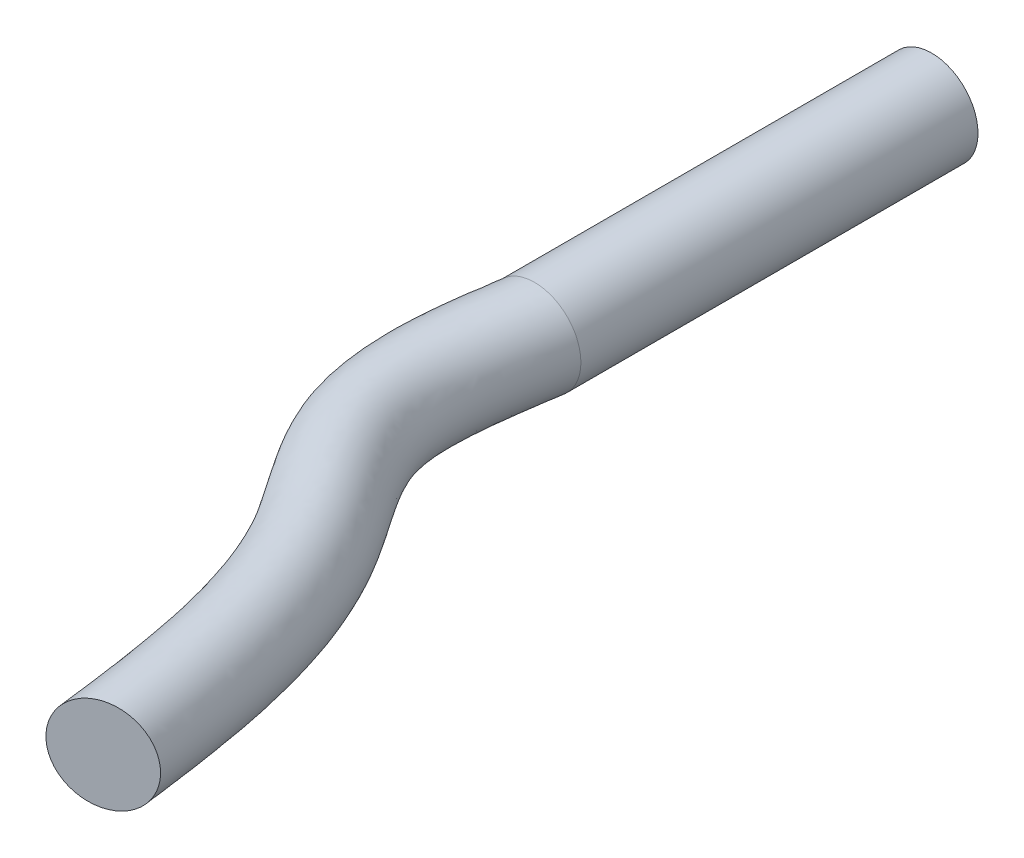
ISO-10303-21;
HEADER;
FILE_DESCRIPTION(('STEP AP214'),'2;1');
FILE_NAME('part.step','',(''),(''),'','','');
FILE_SCHEMA(('AUTOMOTIVE_DESIGN { 1 0 10303 214 1 1 1 1 }'));
ENDSEC;
DATA;
#1=APPLICATION_CONTEXT('core data for automotive mechanical design processes');
#2=APPLICATION_PROTOCOL_DEFINITION('international standard','automotive_design',2000,#1);
#3=PRODUCT_CONTEXT('',#1,'mechanical');
#4=PRODUCT('Part','Part','',(#3));
#5=PRODUCT_RELATED_PRODUCT_CATEGORY('part','',(#4));
#6=PRODUCT_DEFINITION_FORMATION('','',#4);
#7=PRODUCT_DEFINITION_CONTEXT('part definition',#1,'design');
#8=PRODUCT_DEFINITION('design','',#6,#7);
#9=PRODUCT_DEFINITION_SHAPE('','',#8);
#10=(LENGTH_UNIT() NAMED_UNIT(*) SI_UNIT(.MILLI.,.METRE.));
#11=(NAMED_UNIT(*) PLANE_ANGLE_UNIT() SI_UNIT($,.RADIAN.));
#12=(NAMED_UNIT(*) SI_UNIT($,.STERADIAN.) SOLID_ANGLE_UNIT());
#13=UNCERTAINTY_MEASURE_WITH_UNIT(LENGTH_MEASURE(1.E-05),#10,'distance_accuracy_value','');
#14=(GEOMETRIC_REPRESENTATION_CONTEXT(3) GLOBAL_UNCERTAINTY_ASSIGNED_CONTEXT((#13)) GLOBAL_UNIT_ASSIGNED_CONTEXT((#10,
#11,#12)) REPRESENTATION_CONTEXT('',''));
#15=CARTESIAN_POINT('',(0.,0.,0.));
#16=DIRECTION('',(0.,0.,1.));
#17=DIRECTION('',(1.,0.,0.));
#18=AXIS2_PLACEMENT_3D('',#15,#16,#17);
#19=CARTESIAN_POINT('',(0.,0.,15.));
#20=DIRECTION('',(0.,0.,-1.));
#21=DIRECTION('',(-1.,0.,0.));
#22=AXIS2_PLACEMENT_3D('',#19,#20,#21);
#23=CYLINDRICAL_SURFACE('',#22,1.75);
#24=CARTESIAN_POINT('',(0.,0.,15.));
#25=DIRECTION('',(0.,0.,-1.));
#26=DIRECTION('',(-1.,0.,0.));
#27=AXIS2_PLACEMENT_3D('',#24,#25,#26);
#28=CIRCLE('',#27,1.75);
#29=CARTESIAN_POINT('',(1.75,0.,15.));
#30=VERTEX_POINT('',#29);
#31=EDGE_CURVE('E11',#30,#30,#28,.F.);
#32=ORIENTED_EDGE('',*,*,#31,.F.);
#33=EDGE_LOOP('',(#32));
#34=FACE_BOUND('',#33,.T.);
#35=CARTESIAN_POINT('',(0.,0.,0.));
#36=DIRECTION('',(0.,0.,1.));
#37=DIRECTION('',(1.,0.,0.));
#38=AXIS2_PLACEMENT_3D('',#35,#36,#37);
#39=CIRCLE('',#38,1.75);
#40=CARTESIAN_POINT('',(1.75,0.,0.));
#41=VERTEX_POINT('',#40);
#42=EDGE_CURVE('E50',#41,#41,#39,.T.);
#43=ORIENTED_EDGE('',*,*,#42,.T.);
#44=EDGE_LOOP('',(#43));
#45=FACE_BOUND('',#44,.T.);
#46=ADVANCED_FACE('F43',(#34,#45),#23,.T.);
#47=CARTESIAN_POINT('',(0.,0.,0.));
#48=DIRECTION('',(0.,0.,1.));
#49=DIRECTION('',(1.,0.,0.));
#50=AXIS2_PLACEMENT_3D('',#47,#48,#49);
#51=PLANE('',#50);
#52=ORIENTED_EDGE('',*,*,#42,.F.);
#53=EDGE_LOOP('',(#52));
#54=FACE_BOUND('',#53,.T.);
#55=ADVANCED_FACE('F64',(#54),#51,.F.);
#56=CARTESIAN_POINT('',(3.87412794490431,0.,37.3341245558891));
#57=DIRECTION('',(-0.277187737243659,0.,-0.960815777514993));
#58=DIRECTION('',(-0.960815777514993,0.,0.277187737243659));
#59=AXIS2_PLACEMENT_3D('',#56,#57,#58);
#60=PLANE('',#59);
#61=CARTESIAN_POINT('',(5.55555555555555,0.,36.8490460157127));
#62=DIRECTION('',(-0.277187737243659,0.,-0.960815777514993));
#63=DIRECTION('',(-0.960815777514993,0.,0.277187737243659));
#64=AXIS2_PLACEMENT_3D('',#61,#62,#63);
#65=CIRCLE('',#64,1.75);
#66=CARTESIAN_POINT('',(7.23698316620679,0.,36.3639674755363));
#67=VERTEX_POINT('',#66);
#68=EDGE_CURVE('E54',#67,#67,#65,.T.);
#69=ORIENTED_EDGE('',*,*,#68,.F.);
#70=EDGE_LOOP('',(#69));
#71=FACE_BOUND('',#70,.T.);
#72=ADVANCED_FACE('F62',(#71),#60,.F.);
#73=CARTESIAN_POINT('',(1.75,0.,15.));
#74=CARTESIAN_POINT('',(1.58582763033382,0.,16.0969577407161));
#75=CARTESIAN_POINT('',(1.25748289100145,0.,18.2908732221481));
#76=CARTESIAN_POINT('',(1.30137765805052,0.,19.8949868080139));
#77=CARTESIAN_POINT('',(1.76319967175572,0.,21.4294303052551));
#78=CARTESIAN_POINT('',(2.47429433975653,0.,22.6280953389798));
#79=CARTESIAN_POINT('',(3.81692705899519,0.,24.5294477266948));
#80=CARTESIAN_POINT('',(5.35550784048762,0.,27.2594198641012));
#81=CARTESIAN_POINT('',(6.48537419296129,0.,30.9978888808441));
#82=CARTESIAN_POINT('',(6.98342008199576,0.,34.4508196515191));
#83=CARTESIAN_POINT('',(7.20804198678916,0.,36.1456046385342));
#84=CARTESIAN_POINT('',(7.23698316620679,0.,36.3639674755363));
#85=CARTESIAN_POINT('',(1.75,3.5,15.));
#86=CARTESIAN_POINT('',(1.58582763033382,3.5,16.0969577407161));
#87=CARTESIAN_POINT('',(1.25748289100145,3.5,18.2908732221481));
#88=CARTESIAN_POINT('',(1.30137765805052,3.5,19.8949868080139));
#89=CARTESIAN_POINT('',(1.76319967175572,3.5,21.4294303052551));
#90=CARTESIAN_POINT('',(2.47429433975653,3.5,22.6280953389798));
#91=CARTESIAN_POINT('',(3.81692705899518,3.5,24.5294477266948));
#92=CARTESIAN_POINT('',(5.35550784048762,3.5,27.2594198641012));
#93=CARTESIAN_POINT('',(6.48537419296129,3.5,30.9978888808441));
#94=CARTESIAN_POINT('',(6.98342008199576,3.5,34.4508196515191));
#95=CARTESIAN_POINT('',(7.20804198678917,3.5,36.1456046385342));
#96=CARTESIAN_POINT('',(7.23698316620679,3.5,36.3639674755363));
#97=CARTESIAN_POINT('',(-1.75,3.5,15.));
#98=CARTESIAN_POINT('',(-1.92840414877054,3.5,16.1449627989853));
#99=CARTESIAN_POINT('',(-2.28521244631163,3.5,18.4348883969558));
#100=CARTESIAN_POINT('',(-2.01304992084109,3.5,21.0922135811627));
#101=CARTESIAN_POINT('',(-1.13619125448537,3.5,23.4566732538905));
#102=CARTESIAN_POINT('',(0.0386464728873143,3.5,25.1515240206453));
#103=CARTESIAN_POINT('',(1.16813520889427,3.5,26.8125823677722));
#104=CARTESIAN_POINT('',(2.25978432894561,3.5,28.9868881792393));
#105=CARTESIAN_POINT('',(3.18184753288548,3.5,32.1600354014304));
#106=CARTESIAN_POINT('',(3.63814306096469,3.5,35.4803073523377));
#107=CARTESIAN_POINT('',(3.84719310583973,3.5,37.122533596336));
#108=CARTESIAN_POINT('',(3.87412794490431,3.5,37.3341245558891));
#109=CARTESIAN_POINT('',(-1.75,0.,15.));
#110=CARTESIAN_POINT('',(-1.92840414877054,0.,16.1449627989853));
#111=CARTESIAN_POINT('',(-2.28521244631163,0.,18.4348883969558));
#112=CARTESIAN_POINT('',(-2.0130499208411,0.,21.0922135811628));
#113=CARTESIAN_POINT('',(-1.13619125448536,0.,23.4566732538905));
#114=CARTESIAN_POINT('',(0.0386464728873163,0.,25.1515240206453));
#115=CARTESIAN_POINT('',(1.16813520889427,0.,26.8125823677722));
#116=CARTESIAN_POINT('',(2.25978432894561,0.,28.9868881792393));
#117=CARTESIAN_POINT('',(3.18184753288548,0.,32.1600354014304));
#118=CARTESIAN_POINT('',(3.63814306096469,0.,35.4803073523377));
#119=CARTESIAN_POINT('',(3.84719310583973,0.,37.1225335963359));
#120=CARTESIAN_POINT('',(3.87412794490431,0.,37.3341245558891));
#121=CARTESIAN_POINT('',(-1.75,-3.5,15.));
#122=CARTESIAN_POINT('',(-1.92840414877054,-3.5,16.1449627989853));
#123=CARTESIAN_POINT('',(-2.28521244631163,-3.5,18.4348883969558));
#124=CARTESIAN_POINT('',(-2.0130499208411,-3.5,21.0922135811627));
#125=CARTESIAN_POINT('',(-1.13619125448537,-3.5,23.4566732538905));
#126=CARTESIAN_POINT('',(0.0386464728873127,-3.5,25.1515240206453));
#127=CARTESIAN_POINT('',(1.16813520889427,-3.5,26.8125823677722));
#128=CARTESIAN_POINT('',(2.25978432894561,-3.5,28.9868881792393));
#129=CARTESIAN_POINT('',(3.18184753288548,-3.5,32.1600354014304));
#130=CARTESIAN_POINT('',(3.63814306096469,-3.5,35.4803073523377));
#131=CARTESIAN_POINT('',(3.84719310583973,-3.5,37.122533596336));
#132=CARTESIAN_POINT('',(3.87412794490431,-3.5,37.3341245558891));
#133=CARTESIAN_POINT('',(1.75,-3.5,15.));
#134=CARTESIAN_POINT('',(1.58582763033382,-3.5,16.0969577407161));
#135=CARTESIAN_POINT('',(1.25748289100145,-3.5,18.2908732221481));
#136=CARTESIAN_POINT('',(1.30137765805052,-3.5,19.8949868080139));
#137=CARTESIAN_POINT('',(1.76319967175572,-3.5,21.4294303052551));
#138=CARTESIAN_POINT('',(2.47429433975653,-3.5,22.6280953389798));
#139=CARTESIAN_POINT('',(3.81692705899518,-3.5,24.5294477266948));
#140=CARTESIAN_POINT('',(5.35550784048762,-3.5,27.2594198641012));
#141=CARTESIAN_POINT('',(6.48537419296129,-3.5,30.9978888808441));
#142=CARTESIAN_POINT('',(6.98342008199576,-3.5,34.4508196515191));
#143=CARTESIAN_POINT('',(7.20804198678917,-3.5,36.1456046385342));
#144=CARTESIAN_POINT('',(7.23698316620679,-3.5,36.3639674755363));
#145=CARTESIAN_POINT('',(1.75,0.,15.));
#146=CARTESIAN_POINT('',(1.58582763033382,0.,16.0969577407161));
#147=CARTESIAN_POINT('',(1.25748289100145,0.,18.2908732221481));
#148=CARTESIAN_POINT('',(1.30137765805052,0.,19.8949868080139));
#149=CARTESIAN_POINT('',(1.76319967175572,0.,21.4294303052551));
#150=CARTESIAN_POINT('',(2.47429433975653,0.,22.6280953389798));
#151=CARTESIAN_POINT('',(3.81692705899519,0.,24.5294477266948));
#152=CARTESIAN_POINT('',(5.35550784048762,0.,27.2594198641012));
#153=CARTESIAN_POINT('',(6.48537419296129,0.,30.9978888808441));
#154=CARTESIAN_POINT('',(6.98342008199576,0.,34.4508196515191));
#155=CARTESIAN_POINT('',(7.20804198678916,0.,36.1456046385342));
#156=CARTESIAN_POINT('',(7.23698316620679,0.,36.3639674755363));
#157=(BOUNDED_SURFACE() B_SPLINE_SURFACE(3,3,((#73,#74,#75,#76,#77,#78,#79,#80,#81,#82,#83,#84),
(#85,#86,#87,#88,#89,#90,#91,#92,#93,#94,#95,#96),(#97,#98,#99,#100,#101,#102,#103,#104,#105,
#106,#107,#108),(#109,#110,#111,#112,#113,#114,#115,#116,#117,#118,#119,#120),(#121,#122,#123,
#124,#125,#126,#127,#128,#129,#130,#131,#132),(#133,#134,#135,#136,#137,#138,#139,#140,#141,
#142,#143,#144),(#145,#146,#147,#148,#149,#150,#151,#152,#153,#154,#155,#156)),.UNSPECIFIED.,
.T.,.F.,.F.) B_SPLINE_SURFACE_WITH_KNOTS((4,3,4),(4,1,1,1,1,1,1,1,1,4),(0.,0.5,1.),(0.,0.14,
0.28,0.284375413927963,0.420000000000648,0.504649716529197,0.559999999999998,0.780000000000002,
0.97165432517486,1.),
.UNSPECIFIED.) GEOMETRIC_REPRESENTATION_ITEM() RATIONAL_B_SPLINE_SURFACE(((1.,1.,1.,1.,1.,1.,1.,
1.,1.,1.,1.,1.),(0.333333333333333,0.333333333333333,0.333333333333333,0.333333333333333,
0.333333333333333,0.333333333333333,0.333333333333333,0.333333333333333,0.333333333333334,
0.333333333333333,0.333333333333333,0.333333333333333),(0.333333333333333,0.333333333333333,
0.333333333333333,0.333333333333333,0.333333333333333,0.333333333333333,0.333333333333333,
0.333333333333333,0.333333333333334,0.333333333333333,0.333333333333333,0.333333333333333),(1.,
1.,1.,1.,1.,1.,1.,1.,1.,1.,1.,1.),(0.333333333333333,0.333333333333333,0.333333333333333,
0.333333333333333,0.333333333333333,0.333333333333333,0.333333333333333,0.333333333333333,
0.333333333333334,0.333333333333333,0.333333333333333,0.333333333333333),(0.333333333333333,
0.333333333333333,0.333333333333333,0.333333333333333,0.333333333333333,0.333333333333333,
0.333333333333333,0.333333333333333,0.333333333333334,0.333333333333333,0.333333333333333,
0.333333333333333),(1.,1.,1.,1.,1.,1.,1.,1.,1.,1.,1.,1.))) REPRESENTATION_ITEM('') SURFACE());
#158=CARTESIAN_POINT('',(1.75,0.,15.));
#159=CARTESIAN_POINT('',(1.74885482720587,0.,15.0076517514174));
#160=CARTESIAN_POINT('',(1.74770965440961,0.,15.0153035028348));
#161=CARTESIAN_POINT('',(1.74541937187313,0.,15.0306069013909));
#162=CARTESIAN_POINT('',(1.74427426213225,0.,15.0382585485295));
#163=CARTESIAN_POINT('',(1.74198416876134,0.,15.0535616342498));
#164=CARTESIAN_POINT('',(1.74083918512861,0.,15.061213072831));
#165=CARTESIAN_POINT('',(1.73854940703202,0.,15.0765156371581));
#166=CARTESIAN_POINT('',(1.73740461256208,0.,15.0841667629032));
#167=CARTESIAN_POINT('',(1.73511527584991,0.,15.0994685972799));
#168=CARTESIAN_POINT('',(1.73397073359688,0.,15.1071193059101));
#169=CARTESIAN_POINT('',(1.73168196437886,0.,15.1224202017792));
#170=CARTESIAN_POINT('',(1.73053773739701,0.,15.1300703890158));
#171=CARTESIAN_POINT('',(1.728249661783,0.,15.1453701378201));
#172=CARTESIAN_POINT('',(1.72710581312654,0.,15.1530196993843));
#173=CARTESIAN_POINT('',(1.72481855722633,0.,15.1683180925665));
#174=CARTESIAN_POINT('',(1.72367514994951,0.,15.1759669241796));
#175=CARTESIAN_POINT('',(1.72138883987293,0.,15.1912637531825));
#176=CARTESIAN_POINT('',(1.72024593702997,0.,15.1989117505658));
#177=CARTESIAN_POINT('',(1.71796069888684,0.,15.2142068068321));
#178=CARTESIAN_POINT('',(1.71681836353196,0.,15.2218538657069));
#179=CARTESIAN_POINT('',(1.71453432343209,0.,15.2371469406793));
#180=CARTESIAN_POINT('',(1.71339261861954,0.,15.2447929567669));
#181=CARTESIAN_POINT('',(1.71110990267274,0.,15.2600838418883));
#182=CARTESIAN_POINT('',(1.70996889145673,0.,15.2677287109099));
#183=CARTESIAN_POINT('',(1.70768762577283,0.,15.283017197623));
#184=CARTESIAN_POINT('',(1.7065473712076,0.,15.2906608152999));
#185=CARTESIAN_POINT('',(1.7042676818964,0.,15.3059466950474));
#186=CARTESIAN_POINT('',(1.70312824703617,0.,15.3135889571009));
#187=CARTESIAN_POINT('',(1.70085026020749,0.,15.3288720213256));
#188=CARTESIAN_POINT('',(1.69971170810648,0.,15.3365128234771));
#189=CARTESIAN_POINT('',(1.69743554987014,0.,15.3517928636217));
#190=CARTESIAN_POINT('',(1.69629794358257,0.,15.3594321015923));
#191=CARTESIAN_POINT('',(1.69402374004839,0.,15.3747089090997));
#192=CARTESIAN_POINT('',(1.69288714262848,0.,15.3823464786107));
#193=CARTESIAN_POINT('',(1.69061501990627,0.,15.3976198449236));
#194=CARTESIAN_POINT('',(1.68947949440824,0.,15.4052556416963));
#195=CARTESIAN_POINT('',(1.68720957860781,0.,15.4205253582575));
#196=CARTESIAN_POINT('',(1.68607518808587,0.,15.4281592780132));
#197=CARTESIAN_POINT('',(1.68380760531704,0.,15.4434251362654));
#198=CARTESIAN_POINT('',(1.68267441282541,0.,15.4510570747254));
#199=CARTESIAN_POINT('',(1.68040928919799,0.,15.4663188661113));
#200=CARTESIAN_POINT('',(1.67927735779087,0.,15.4739487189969));
#201=CARTESIAN_POINT('',(1.67701481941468,0.,15.4892062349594));
#202=CARTESIAN_POINT('',(1.67588421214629,0.,15.4968338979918));
#203=CARTESIAN_POINT('',(1.67362438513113,0.,15.5120869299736));
#204=CARTESIAN_POINT('',(1.67249516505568,0.,15.5197122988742));
#205=CARTESIAN_POINT('',(1.67023817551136,0.,15.5349606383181));
#206=CARTESIAN_POINT('',(1.66911040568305,0.,15.5425836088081));
#207=CARTESIAN_POINT('',(1.6668563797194,0.,15.5578270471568));
#208=CARTESIAN_POINT('',(1.66573012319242,0.,15.5654475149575));
#209=CARTESIAN_POINT('',(1.66347918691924,0.,15.5806858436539));
#210=CARTESIAN_POINT('',(1.66235450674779,0.,15.5883037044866));
#211=CARTESIAN_POINT('',(1.6601067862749,0.,15.6035367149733));
#212=CARTESIAN_POINT('',(1.65898374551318,0.,15.6111518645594));
#213=CARTESIAN_POINT('',(1.65673936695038,0.,15.6263793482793));
#214=CARTESIAN_POINT('',(1.65561802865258,0.,15.6339916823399));
#215=CARTESIAN_POINT('',(1.65337711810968,0.,15.6492134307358));
#216=CARTESIAN_POINT('',(1.65225754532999,0.,15.6568228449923));
#217=CARTESIAN_POINT('',(1.65002022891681,0.,15.6720386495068));
#218=CARTESIAN_POINT('',(1.6489024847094,0.,15.6796450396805));
#219=CARTESIAN_POINT('',(1.64666888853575,0.,15.6948546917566));
#220=CARTESIAN_POINT('',(1.64555303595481,0.,15.7024579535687));
#221=CARTESIAN_POINT('',(1.64332328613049,0.,15.7176612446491));
#222=CARTESIAN_POINT('',(1.6422093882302,0.,15.725261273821));
#223=CARTESIAN_POINT('',(1.63998361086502,0.,15.7404579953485));
#224=CARTESIAN_POINT('',(1.63887173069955,0.,15.7480546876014));
#225=CARTESIAN_POINT('',(1.63665005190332,0.,15.7632446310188));
#226=CARTESIAN_POINT('',(1.63554025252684,0.,15.7708378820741));
#227=CARTESIAN_POINT('',(1.63332279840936,0.,15.7860208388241));
#228=CARTESIAN_POINT('',(1.63221514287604,0.,15.793610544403));
#229=CARTESIAN_POINT('',(1.63000203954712,0.,15.8087863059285));
#230=CARTESIAN_POINT('',(1.62889659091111,0.,15.8163723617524));
#231=CARTESIAN_POINT('',(1.62668796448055,0.,15.8315407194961));
#232=CARTESIAN_POINT('',(1.62558478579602,0.,15.8391230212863));
#233=CARTESIAN_POINT('',(1.62338076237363,0.,15.854283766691));
#234=CARTESIAN_POINT('',(1.62227991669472,0.,15.8618622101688));
#235=CARTESIAN_POINT('',(1.6200806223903,0.,15.8770151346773));
#236=CARTESIAN_POINT('',(1.61898217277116,0.,15.8845896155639));
#237=CARTESIAN_POINT('',(1.61678773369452,0.,15.8997345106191));
#238=CARTESIAN_POINT('',(1.61569174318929,0.,15.9073049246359));
#239=CARTESIAN_POINT('',(1.61350228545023,0.,15.9224415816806));
#240=CARTESIAN_POINT('',(1.61240881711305,0.,15.9300078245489));
#241=CARTESIAN_POINT('',(1.61022446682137,0.,15.9451360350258));
#242=CARTESIAN_POINT('',(1.60913358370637,0.,15.9526980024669));
#243=CARTESIAN_POINT('',(1.60695446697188,0.,15.9678175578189));
#244=CARTESIAN_POINT('',(1.60586623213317,0.,15.9753751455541));
#245=CARTESIAN_POINT('',(1.60369247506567,0.,15.9904858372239));
#246=CARTESIAN_POINT('',(1.60260695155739,0.,15.9980389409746));
#247=CARTESIAN_POINT('',(1.60043868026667,0.,16.0131405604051));
#248=CARTESIAN_POINT('',(1.59935593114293,0.,16.0206890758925));
#249=CARTESIAN_POINT('',(1.59719327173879,0.,16.0357814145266));
#250=CARTESIAN_POINT('',(1.59611336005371,0.,16.043325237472));
#251=CARTESIAN_POINT('',(1.59395643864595,0.,16.0584080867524));
#252=CARTESIAN_POINT('',(1.59287942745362,0.,16.0659471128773));
#253=CARTESIAN_POINT('',(1.59072837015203,0.,16.0810202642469));
#254=CARTESIAN_POINT('',(1.58965432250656,0.,16.0885543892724));
#255=CARTESIAN_POINT('',(1.58750925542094,0.,16.103617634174));
#256=CARTESIAN_POINT('',(1.58643823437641,0.,16.1111467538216));
#257=CARTESIAN_POINT('',(1.58429928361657,0.,16.126199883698));
#258=CARTESIAN_POINT('',(1.58323135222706,0.,16.1337238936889));
#259=CARTESIAN_POINT('',(1.58109864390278,0.,16.148766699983));
#260=CARTESIAN_POINT('',(1.58003386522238,0.,16.1562854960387));
#261=CARTESIAN_POINT('',(1.57790752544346,0.,16.1713177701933));
#262=CARTESIAN_POINT('',(1.57684596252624,0.,16.178831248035));
#263=CARTESIAN_POINT('',(1.57472611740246,0.,16.1938527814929));
#264=CARTESIAN_POINT('',(1.57366783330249,0.,16.201360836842));
#265=CARTESIAN_POINT('',(1.57155460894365,0.,16.2163714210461));
#266=CARTESIAN_POINT('',(1.57049966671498,0.,16.2238739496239));
#267=CARTESIAN_POINT('',(1.56839318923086,0.,16.2388733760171));
#268=CARTESIAN_POINT('',(1.56734165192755,0.,16.246370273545));
#269=CARTESIAN_POINT('',(1.56524204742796,0.,16.2613583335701));
#270=CARTESIAN_POINT('',(1.56419397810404,0.,16.2688494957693));
#271=CARTESIAN_POINT('',(1.56210137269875,0.,16.2838259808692));
#272=CARTESIAN_POINT('',(1.56105683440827,0.,16.2913113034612));
#273=CARTESIAN_POINT('',(1.55897135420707,0.,16.3062760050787));
#274=CARTESIAN_POINT('',(1.55793041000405,0.,16.3137553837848));
#275=CARTESIAN_POINT('',(1.55585218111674,0.,16.3287080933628));
#276=CARTESIAN_POINT('',(1.5548148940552,0.,16.3361814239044));
#277=CARTESIAN_POINT('',(1.55274404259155,0.,16.3511219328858));
#278=CARTESIAN_POINT('',(1.55171047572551,0.,16.3585891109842));
#279=CARTESIAN_POINT('',(1.54964712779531,0.,16.3735172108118));
#280=CARTESIAN_POINT('',(1.54861734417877,0.,16.3809781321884));
#281=CARTESIAN_POINT('',(1.5465616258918,0.,16.3958936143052));
#282=CARTESIAN_POINT('',(1.54553568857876,0.,16.4033481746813));
#283=CARTESIAN_POINT('',(1.54348772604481,0.,16.4182508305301));
#284=CARTESIAN_POINT('',(1.54246569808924,0.,16.4256989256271));
#285=CARTESIAN_POINT('',(1.54042561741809,0.,16.4405885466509));
#286=CARTESIAN_POINT('',(1.53940756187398,0.,16.4480300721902));
#287=CARTESIAN_POINT('',(1.5373754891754,0.,16.4629064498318));
#288=CARTESIAN_POINT('',(1.53636146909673,0.,16.4703413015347));
#289=CARTESIAN_POINT('',(1.53433753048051,0.,16.485204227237));
#290=CARTESIAN_POINT('',(1.53332760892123,0.,16.492632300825));
#291=CARTESIAN_POINT('',(1.53131193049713,0.,16.507481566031));
#292=CARTESIAN_POINT('',(1.5303061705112,0.,16.5149027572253));
#293=CARTESIAN_POINT('',(1.52829887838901,0.,16.5297381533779));
#294=CARTESIAN_POINT('',(1.52729734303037,0.,16.5371523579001));
#295=CARTESIAN_POINT('',(1.52529856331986,0.,16.5519736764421));
#296=CARTESIAN_POINT('',(1.52430131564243,0.,16.5593807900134));
#297=CARTESIAN_POINT('',(1.52231117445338,0.,16.5741878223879));
#298=CARTESIAN_POINT('',(1.52131827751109,0.,16.5815877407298));
#299=CARTESIAN_POINT('',(1.51933690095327,0.,16.5963802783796));
#300=CARTESIAN_POINT('',(1.51834841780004,0.,16.6037728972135));
#301=CARTESIAN_POINT('',(1.51637593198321,0.,16.6185507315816));
#302=CARTESIAN_POINT('',(1.51539192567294,0.,16.6259359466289));
#303=CARTESIAN_POINT('',(1.51342845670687,0.,16.6406988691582));
#304=CARTESIAN_POINT('',(1.51244899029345,0.,16.6480765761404));
#305=CARTESIAN_POINT('',(1.51049466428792,0.,16.6628243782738));
#306=CARTESIAN_POINT('',(1.50951980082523,0.,16.6701944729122));
#307=CARTESIAN_POINT('',(1.50757474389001,0.,16.6849269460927));
#308=CARTESIAN_POINT('',(1.50660454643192,0.,16.6922893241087));
#309=CARTESIAN_POINT('',(1.50466888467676,0.,16.7070062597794));
#310=CARTESIAN_POINT('',(1.50370341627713,0.,16.7143608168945));
#311=CARTESIAN_POINT('',(1.50177727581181,0.,16.7290620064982));
#312=CARTESIAN_POINT('',(1.50081659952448,0.,16.7364086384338));
#313=CARTESIAN_POINT('',(1.49890010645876,0.,16.7510938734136));
#314=CARTESIAN_POINT('',(1.49794428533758,0.,16.758432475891));
#315=CARTESIAN_POINT('',(1.49603756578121,0.,16.7731015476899));
#316=CARTESIAN_POINT('',(1.49508666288,0.,16.7804320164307));
#317=CARTESIAN_POINT('',(1.49318984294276,0.,16.7950847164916));
#318=CARTESIAN_POINT('',(1.49224392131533,0.,16.8024069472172));
#319=CARTESIAN_POINT('',(1.49035712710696,0.,16.8170430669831));
#320=CARTESIAN_POINT('',(1.48941624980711,0.,16.824356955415));
#321=CARTESIAN_POINT('',(1.48753960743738,0.,16.8389762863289));
#322=CARTESIAN_POINT('',(1.4866038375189,0.,16.8462817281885));
#323=CARTESIAN_POINT('',(1.48473747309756,0.,16.8608840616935));
#324=CARTESIAN_POINT('',(1.48380687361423,0.,16.8681809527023));
#325=CARTESIAN_POINT('',(1.48195091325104,0.,16.8827660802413));
#326=CARTESIAN_POINT('',(1.48102554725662,0.,16.8900543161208));
#327=CARTESIAN_POINT('',(1.47918011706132,0.,16.904622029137));
#328=CARTESIAN_POINT('',(1.47826004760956,0.,16.9119015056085));
#329=CARTESIAN_POINT('',(1.47642527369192,0.,16.9264515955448));
#330=CARTESIAN_POINT('',(1.47551056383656,0.,16.93372220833));
#331=CARTESIAN_POINT('',(1.47368657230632,0.,16.9482544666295));
#332=CARTESIAN_POINT('',(1.47277728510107,0.,16.9555161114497));
#333=CARTESIAN_POINT('',(1.47096420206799,0.,16.9700303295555));
#334=CARTESIAN_POINT('',(1.47006040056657,0.,16.9772829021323));
#335=CARTESIAN_POINT('',(1.46825835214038,0.,16.9917788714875));
#336=CARTESIAN_POINT('',(1.46736009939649,0.,16.9990222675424));
#337=CARTESIAN_POINT('',(1.46556921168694,0.,17.0134997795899));
#338=CARTESIAN_POINT('',(1.46467657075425,0.,17.0207338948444));
#339=CARTESIAN_POINT('',(1.4628969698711,0.,17.0351927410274));
#340=CARTESIAN_POINT('',(1.46201000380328,0.,17.042417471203));
#341=CARTESIAN_POINT('',(1.46024181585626,0.,17.0568574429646));
#342=CARTESIAN_POINT('',(1.45936058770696,0.,17.0640726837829));
#343=CARTESIAN_POINT('',(1.45760393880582,0.,17.0784935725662));
#344=CARTESIAN_POINT('',(1.45672851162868,0.,17.0856992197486));
#345=CARTESIAN_POINT('',(1.45498352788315,0.,17.1001008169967));
#346=CARTESIAN_POINT('',(1.45411396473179,0.,17.1072967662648));
#347=CARTESIAN_POINT('',(1.45238077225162,0.,17.1216788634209));
#348=CARTESIAN_POINT('',(1.45151713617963,0.,17.1288650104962));
#349=CARTESIAN_POINT('',(1.44979586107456,0.,17.1432273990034));
#350=CARTESIAN_POINT('',(1.44893821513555,0.,17.1504036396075));
#351=CARTESIAN_POINT('',(1.4472289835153,0.,17.1647461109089));
#352=CARTESIAN_POINT('',(1.44637739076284,0.,17.1719123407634));
#353=CARTESIAN_POINT('',(1.44468032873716,0.,17.1862346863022));
#354=CARTESIAN_POINT('',(1.44383485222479,0.,17.1933908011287));
#355=CARTESIAN_POINT('',(1.44215008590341,0.,17.207692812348));
#356=CARTESIAN_POINT('',(1.44131078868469,0.,17.214838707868));
#357=CARTESIAN_POINT('',(1.43963844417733,0.,17.229120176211));
#358=CARTESIAN_POINT('',(1.43880538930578,0.,17.2362557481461));
#359=CARTESIAN_POINT('',(1.43714559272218,0.,17.2505164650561));
#360=CARTESIAN_POINT('',(1.43631884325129,0.,17.257641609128));
#361=CARTESIAN_POINT('',(1.43467172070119,0.,17.2718813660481));
#362=CARTESIAN_POINT('',(1.43385133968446,0.,17.2789959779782));
#363=CARTESIAN_POINT('',(1.43221701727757,0.,17.2932145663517));
#364=CARTESIAN_POINT('',(1.43140306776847,0.,17.3003185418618));
#365=CARTESIAN_POINT('',(1.42978167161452,0.,17.3145157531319));
#366=CARTESIAN_POINT('',(1.4289742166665,0.,17.3216089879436));
#367=CARTESIAN_POINT('',(1.42736587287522,0.,17.3357846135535));
#368=CARTESIAN_POINT('',(1.42656497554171,0.,17.3428670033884));
#369=CARTESIAN_POINT('',(1.42496981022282,0.,17.3570208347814));
#370=CARTESIAN_POINT('',(1.42417553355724,0.,17.3640922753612));
#371=CARTESIAN_POINT('',(1.42259367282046,0.,17.3782241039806));
#372=CARTESIAN_POINT('',(1.42180607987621,0.,17.3852844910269));
#373=CARTESIAN_POINT('',(1.42023764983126,0.,17.3993941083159));
#374=CARTESIAN_POINT('',(1.41945680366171,0.,17.4064433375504));
#375=CARTESIAN_POINT('',(1.4179019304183,0.,17.4205305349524));
#376=CARTESIAN_POINT('',(1.41712789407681,0.,17.4275685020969));
#377=CARTESIAN_POINT('',(1.41558670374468,0.,17.4416330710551));
#378=CARTESIAN_POINT('',(1.41481954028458,0.,17.4486596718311));
#379=CARTESIAN_POINT('',(1.41329215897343,0.,17.4627014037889));
#380=CARTESIAN_POINT('',(1.41253193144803,0.,17.4697165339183));
#381=CARTESIAN_POINT('',(1.41101848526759,0.,17.483735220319));
#382=CARTESIAN_POINT('',(1.4102652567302,0.,17.4907387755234));
#383=CARTESIAN_POINT('',(1.40876587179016,0.,17.5047342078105));
#384=CARTESIAN_POINT('',(1.40801970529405,0.,17.5117260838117));
#385=CARTESIAN_POINT('',(1.40653450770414,0.,17.5256980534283));
#386=CARTESIAN_POINT('',(1.40579546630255,0.,17.5326781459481));
#387=CARTESIAN_POINT('',(1.40432458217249,0.,17.5466264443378));
#388=CARTESIAN_POINT('',(1.40359272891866,0.,17.5535946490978));
#389=CARTESIAN_POINT('',(1.40213628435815,0.,17.567519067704));
#390=CARTESIAN_POINT('',(1.40141168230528,0.,17.5744752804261));
#391=CARTESIAN_POINT('',(1.39996980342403,0.,17.5883756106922));
#392=CARTESIAN_POINT('',(1.39925251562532,0.,17.5953197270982));
#393=CARTESIAN_POINT('',(1.39782532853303,0.,17.6091957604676));
#394=CARTESIAN_POINT('',(1.39711541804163,0.,17.6161276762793));
#395=CARTESIAN_POINT('',(1.39570304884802,0.,17.6299792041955));
#396=CARTESIAN_POINT('',(1.39500057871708,0.,17.6368988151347));
#397=CARTESIAN_POINT('',(1.39360315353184,0.,17.6507256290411));
#398=CARTESIAN_POINT('',(1.39290818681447,0.,17.6576328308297));
#399=CARTESIAN_POINT('',(1.39152583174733,0.,17.6714347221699));
#400=CARTESIAN_POINT('',(1.39083843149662,0.,17.6783294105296));
#401=CARTESIAN_POINT('',(1.38947127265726,0.,17.6921061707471));
#402=CARTESIAN_POINT('',(1.38879150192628,0.,17.6989882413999));
#403=CARTESIAN_POINT('',(1.38743966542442,0.,17.7127396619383));
#404=CARTESIAN_POINT('',(1.38676758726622,0.,17.719609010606));
#405=CARTESIAN_POINT('',(1.38543119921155,0.,17.7333348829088));
#406=CARTESIAN_POINT('',(1.38476687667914,0.,17.7401914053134));
#407=CARTESIAN_POINT('',(1.38344606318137,0.,17.7538915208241));
#408=CARTESIAN_POINT('',(1.38278955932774,0.,17.7607351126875));
#409=CARTESIAN_POINT('',(1.38148444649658,0.,17.7744092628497));
#410=CARTESIAN_POINT('',(1.38083582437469,0.,17.7812398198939));
#411=CARTESIAN_POINT('',(1.37954653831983,0.,17.7948877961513));
#412=CARTESIAN_POINT('',(1.37890586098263,0.,17.8017052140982));
#413=CARTESIAN_POINT('',(1.37763252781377,0.,17.8153268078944));
#414=CARTESIAN_POINT('',(1.37699985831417,0.,17.8221309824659));
#415=CARTESIAN_POINT('',(1.37574260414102,0.,17.8357259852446));
#416=CARTESIAN_POINT('',(1.37511800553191,0.,17.8425168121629));
#417=CARTESIAN_POINT('',(1.37387695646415,0.,17.8560850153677));
#418=CARTESIAN_POINT('',(1.37326049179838,0.,17.8628623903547));
#419=CARTESIAN_POINT('',(1.37203577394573,0.,17.8764035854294));
#420=CARTESIAN_POINT('',(1.37142750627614,0.,17.8831674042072));
#421=CARTESIAN_POINT('',(1.37021924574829,0.,17.8966813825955));
#422=CARTESIAN_POINT('',(1.36961923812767,0.,17.903431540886));
#423=CARTESIAN_POINT('',(1.36842756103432,0.,17.9169180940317));
#424=CARTESIAN_POINT('',(1.36783587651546,0.,17.9236544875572));
#425=CARTESIAN_POINT('',(1.3666609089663,0.,17.937113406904));
#426=CARTESIAN_POINT('',(1.36607761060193,0.,17.9438359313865));
#427=CARTESIAN_POINT('',(1.36491947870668,0.,17.9572670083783));
#428=CARTESIAN_POINT('',(1.36434462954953,0.,17.96397555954));
#429=CARTESIAN_POINT('',(1.36320345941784,0.,17.9773785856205));
#430=CARTESIAN_POINT('',(1.36263712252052,0.,17.9840730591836));
#431=CARTESIAN_POINT('',(1.36151304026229,0.,17.9974478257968));
#432=CARTESIAN_POINT('',(1.36095527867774,0.,18.0041281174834));
#433=CARTESIAN_POINT('',(1.3598484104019,0.,18.0174744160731));
#434=CARTESIAN_POINT('',(1.35929928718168,0.,18.0241404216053));
#435=CARTESIAN_POINT('',(1.35820975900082,0.,18.0374580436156));
#436=CARTESIAN_POINT('',(1.35766933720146,0.,18.044109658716));
#437=CARTESIAN_POINT('',(1.35659727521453,0.,18.0573983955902));
#438=CARTESIAN_POINT('',(1.35606561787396,0.,18.06403551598));
#439=CARTESIAN_POINT('',(1.35501114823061,0.,18.0772951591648));
#440=CARTESIAN_POINT('',(1.35448831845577,0.,18.0839176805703));
#441=CARTESIAN_POINT('',(1.35345156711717,0.,18.0971480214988));
#442=CARTESIAN_POINT('',(1.35293762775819,0.,18.1037558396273));
#443=CARTESIAN_POINT('',(1.35191872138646,0.,18.1169566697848));
#444=CARTESIAN_POINT('',(1.35141373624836,0.,18.1235496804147));
#445=CARTESIAN_POINT('',(1.35041279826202,0.,18.1367207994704));
#446=CARTESIAN_POINT('',(1.34991682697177,0.,18.1432989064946));
#447=CARTESIAN_POINT('',(1.34893398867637,0.,18.1564402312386));
#448=CARTESIAN_POINT('',(1.34844710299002,0.,18.1630034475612));
#449=CARTESIAN_POINT('',(1.34748251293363,0.,18.1761150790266));
#450=CARTESIAN_POINT('',(1.34700478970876,0.,18.1826634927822));
#451=CARTESIAN_POINT('',(1.34605859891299,0.,18.195745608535));
#452=CARTESIAN_POINT('',(1.3455901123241,0.,18.2022793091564));
#453=CARTESIAN_POINT('',(1.34466246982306,0.,18.2153320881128));
#454=CARTESIAN_POINT('',(1.34420329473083,0.,18.2218511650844));
#455=CARTESIAN_POINT('',(1.34329435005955,0.,18.2348747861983));
#456=CARTESIAN_POINT('',(1.34284456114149,0.,18.2413793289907));
#457=CARTESIAN_POINT('',(1.34195446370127,0.,18.254373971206));
#458=CARTESIAN_POINT('',(1.34151413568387,0.,18.2608640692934));
#459=CARTESIAN_POINT('',(1.34064303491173,0.,18.2738299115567));
#460=CARTESIAN_POINT('',(1.34021224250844,0.,18.2803056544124));
#461=CARTESIAN_POINT('',(1.33936028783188,0.,18.2932428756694));
#462=CARTESIAN_POINT('',(1.3389391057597,0.,18.2997043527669));
#463=CARTESIAN_POINT('',(1.33810644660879,0.,18.3126131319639));
#464=CARTESIAN_POINT('',(1.33769494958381,0.,18.3190604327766));
#465=CARTESIAN_POINT('',(1.33688173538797,0.,18.3319409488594));
#466=CARTESIAN_POINT('',(1.33647999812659,0.,18.3383741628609));
#467=CARTESIAN_POINT('',(1.33568637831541,0.,18.3512265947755));
#468=CARTESIAN_POINT('',(1.335294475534,0.,18.3576458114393));
#469=CARTESIAN_POINT('',(1.33452059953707,0.,18.3704703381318));
#470=CARTESIAN_POINT('',(1.33413860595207,0.,18.3768756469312));
#471=CARTESIAN_POINT('',(1.33338462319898,0.,18.3896724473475));
#472=CARTESIAN_POINT('',(1.33301261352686,0.,18.3960639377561));
#473=CARTESIAN_POINT('',(1.33227867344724,0.,18.4088331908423));
#474=CARTESIAN_POINT('',(1.33191672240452,0.,18.4152109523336));
#475=CARTESIAN_POINT('',(1.33120297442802,0.,18.4279528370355));
#476=CARTESIAN_POINT('',(1.33085115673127,0.,18.434316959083));
#477=CARTESIAN_POINT('',(1.33015775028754,0.,18.4470316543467));
#478=CARTESIAN_POINT('',(1.32981614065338,0.,18.4533822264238));
#479=CARTESIAN_POINT('',(1.32914322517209,0.,18.4660699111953));
#480=CARTESIAN_POINT('',(1.32881189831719,0.,18.4724070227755));
#481=CARTESIAN_POINT('',(1.32815962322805,0.,18.4850678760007));
#482=CARTESIAN_POINT('',(1.3278386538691,0.,18.4913916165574));
#483=CARTESIAN_POINT('',(1.32720716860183,0.,18.5040258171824));
#484=CARTESIAN_POINT('',(1.32689663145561,0.,18.5103362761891));
#485=CARTESIAN_POINT('',(1.32628608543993,0.,18.5229440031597));
#486=CARTESIAN_POINT('',(1.32598605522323,0.,18.5292412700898));
#487=CARTESIAN_POINT('',(1.32539659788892,0.,18.5418227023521));
#488=CARTESIAN_POINT('',(1.32510714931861,0.,18.5481068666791));
#489=CARTESIAN_POINT('',(1.32453893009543,0.,18.560662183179));
#490=CARTESIAN_POINT('',(1.3242601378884,0.,18.5669333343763));
#491=CARTESIAN_POINT('',(1.32371330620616,0.,18.5794627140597));
#492=CARTESIAN_POINT('',(1.32344524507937,0.,18.5857209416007));
#493=CARTESIAN_POINT('',(1.32291995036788,0.,18.5982245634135));
#494=CARTESIAN_POINT('',(1.32266269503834,0.,18.6044699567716));
#495=CARTESIAN_POINT('',(1.32215908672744,0.,18.6169479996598));
#496=CARTESIAN_POINT('',(1.3219127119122,0.,18.6231806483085));
#497=CARTESIAN_POINT('',(1.32143093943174,0.,18.635633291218));
#498=CARTESIAN_POINT('',(1.32119551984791,0.,18.6418532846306));
#499=CARTESIAN_POINT('',(1.32073573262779,0.,18.6542807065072));
#500=CARTESIAN_POINT('',(1.32051134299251,0.,18.6604881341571));
#501=CARTESIAN_POINT('',(1.32007369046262,0.,18.6728905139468));
#502=CARTESIAN_POINT('',(1.3198604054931,0.,18.6790854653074));
#503=CARTESIAN_POINT('',(1.31944503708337,0.,18.6914629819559));
#504=CARTESIAN_POINT('',(1.31924293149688,0.,18.6976455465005));
#505=CARTESIAN_POINT('',(1.31884999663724,0.,18.7099983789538));
#506=CARTESIAN_POINT('',(1.31865914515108,0.,18.7161686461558));
#507=CARTESIAN_POINT('',(1.31828879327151,0.,18.7284969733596));
#508=CARTESIAN_POINT('',(1.31810927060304,0.,18.7346550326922));
#509=CARTESIAN_POINT('',(1.31776165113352,0.,18.7469590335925));
#510=CARTESIAN_POINT('',(1.31759353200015,0.,18.7531049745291));
#511=CARTESIAN_POINT('',(1.31726879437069,0.,18.7653848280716));
#512=CARTESIAN_POINT('',(1.31711215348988,0.,18.7715187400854));
#513=CARTESIAN_POINT('',(1.31681044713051,0.,18.7837746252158));
#514=CARTESIAN_POINT('',(1.31666535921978,0.,18.7898965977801));
#515=CARTESIAN_POINT('',(1.31638683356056,0.,18.8021286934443));
#516=CARTESIAN_POINT('',(1.31625337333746,0.,18.8082388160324));
#517=CARTESIAN_POINT('',(1.31599817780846,0.,18.8204473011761));
#518=CARTESIAN_POINT('',(1.31587641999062,0.,18.826545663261));
#519=CARTESIAN_POINT('',(1.31564470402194,0.,18.8387307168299));
#520=CARTESIAN_POINT('',(1.31553472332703,0.,18.844817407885));
#521=CARTESIAN_POINT('',(1.31532663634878,0.,18.8569792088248));
#522=CARTESIAN_POINT('',(1.31522850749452,0.,18.8630543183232));
#523=CARTESIAN_POINT('',(1.31504419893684,0.,18.8751930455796));
#524=CARTESIAN_POINT('',(1.314957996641,0.,18.8812566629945));
#525=CARTESIAN_POINT('',(1.31479761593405,0.,18.8933724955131));
#526=CARTESIAN_POINT('',(1.31472341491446,0.,18.8994247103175));
#527=CARTESIAN_POINT('',(1.31458711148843,0.,18.911517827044));
#528=CARTESIAN_POINT('',(1.31452498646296,0.,18.917558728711));
#529=CARTESIAN_POINT('',(1.31441290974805,0.,18.929629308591));
#530=CARTESIAN_POINT('',(1.31436293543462,0.,18.9356589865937));
#531=CARTESIAN_POINT('',(1.31427523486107,0.,18.9477072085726));
#532=CARTESIAN_POINT('',(1.31423748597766,0.,18.9537257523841));
#533=CARTESIAN_POINT('',(1.31417431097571,0.,18.9657517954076));
#534=CARTESIAN_POINT('',(1.31414886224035,0.,18.9717592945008));
#535=CARTESIAN_POINT('',(1.31411036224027,0.,18.9837633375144));
#536=CARTESIAN_POINT('',(1.31409728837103,0.,18.9897598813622));
#537=CARTESIAN_POINT('',(1.31408361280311,0.,19.0017421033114));
#538=CARTESIAN_POINT('',(1.31408298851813,0.,19.0077277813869));
#539=CARTESIAN_POINT('',(1.31409428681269,0.,19.0196883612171));
#540=CARTESIAN_POINT('',(1.31410618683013,0.,19.025663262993));
#541=CARTESIAN_POINT('',(1.3141426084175,0.,19.0376023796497));
#542=CARTESIAN_POINT('',(1.31416710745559,0.,19.043566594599));
#543=CARTESIAN_POINT('',(1.31422880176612,0.,19.0554844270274));
#544=CARTESIAN_POINT('',(1.31426597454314,0.,19.0614380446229));
#545=CARTESIAN_POINT('',(1.31435309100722,0.,19.0733347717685));
#546=CARTESIAN_POINT('',(1.31440301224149,0.,19.0792778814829));
#547=CARTESIAN_POINT('',(1.3145157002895,0.,19.091153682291));
#548=CARTESIAN_POINT('',(1.31457844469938,0.,19.0970863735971));
#549=CARTESIAN_POINT('',(1.31471685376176,0.,19.108941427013));
#550=CARTESIAN_POINT('',(1.31479249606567,0.,19.1148637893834));
#551=CARTESIAN_POINT('',(1.31495677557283,0.,19.1266982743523));
#552=CARTESIAN_POINT('',(1.31504539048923,0.,19.1326103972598));
#553=CARTESIAN_POINT('',(1.31523568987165,0.,19.1444244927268));
#554=CARTESIAN_POINT('',(1.31533735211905,0.,19.150326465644));
#555=CARTESIAN_POINT('',(1.31555382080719,0.,19.1621203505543));
#556=CARTESIAN_POINT('',(1.31566860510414,0.,19.1680122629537));
#557=CARTESIAN_POINT('',(1.3159113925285,0.,19.1797861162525));
#558=CARTESIAN_POINT('',(1.31603937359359,0.,19.1856680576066));
#559=CARTESIAN_POINT('',(1.31630862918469,0.,19.1974220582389));
#560=CARTESIAN_POINT('',(1.31644988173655,0.,19.2032941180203));
#561=CARTESIAN_POINT('',(1.31674575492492,0.,19.2150284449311));
#562=CARTESIAN_POINT('',(1.31690035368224,0.,19.220890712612));
#563=CARTESIAN_POINT('',(1.31722299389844,0.,19.2326055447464));
#564=CARTESIAN_POINT('',(1.31739101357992,0.,19.2384581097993));
#565=CARTESIAN_POINT('',(1.31774057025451,0.,19.2501536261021));
#566=CARTESIAN_POINT('',(1.31792208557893,0.,19.2559965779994));
#567=CARTESIAN_POINT('',(1.31829870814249,0.,19.2676729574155));
#568=CARTESIAN_POINT('',(1.31849379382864,0.,19.2735063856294));
#569=CARTESIAN_POINT('',(1.31889763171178,0.,19.2851638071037));
#570=CARTESIAN_POINT('',(1.31910636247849,0.,19.2909878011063));
#571=CARTESIAN_POINT('',(1.31953756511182,0.,19.3026264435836));
#572=CARTESIAN_POINT('',(1.31976001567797,0.,19.3084410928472));
#573=CARTESIAN_POINT('',(1.32021873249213,0.,19.3200611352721));
#574=CARTESIAN_POINT('',(1.32045497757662,0.,19.3258665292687));
#575=CARTESIAN_POINT('',(1.32094135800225,0.,19.337468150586));
#576=CARTESIAN_POINT('',(1.32119147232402,0.,19.3432643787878));
#577=CARTESIAN_POINT('',(1.3217056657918,0.,19.3548477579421));
#578=CARTESIAN_POINT('',(1.32196972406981,0.,19.3606349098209));
#579=CARTESIAN_POINT('',(1.32251188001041,0.,19.3722002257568));
#580=CARTESIAN_POINT('',(1.32278995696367,0.,19.3779783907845));
#581=CARTESIAN_POINT('',(1.32336022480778,0.,19.3895258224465));
#582=CARTESIAN_POINT('',(1.32365239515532,0.,19.3952950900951));
#583=CARTESIAN_POINT('',(1.32425092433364,0.,19.4068248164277));
#584=CARTESIAN_POINT('',(1.32455726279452,0.,19.4125852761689));
#585=CARTESIAN_POINT('',(1.32518420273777,0.,19.4240974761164));
#586=CARTESIAN_POINT('',(1.32550478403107,0.,19.4298492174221));
#587=CARTESIAN_POINT('',(1.32616028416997,0.,19.4413440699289));
#588=CARTESIAN_POINT('',(1.32649518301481,0.,19.4470871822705));
#589=CARTESIAN_POINT('',(1.32717939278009,0.,19.458564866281));
#590=CARTESIAN_POINT('',(1.32752868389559,0.,19.4642994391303));
#591=CARTESIAN_POINT('',(1.32824175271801,0.,19.4757601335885));
#592=CARTESIAN_POINT('',(1.32860551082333,0.,19.481486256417));
#593=CARTESIAN_POINT('',(1.32934758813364,0.,19.4929301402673));
#594=CARTESIAN_POINT('',(1.32972588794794,0.,19.4986479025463));
#595=CARTESIAN_POINT('',(1.3304971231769,0.,19.5100751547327));
#596=CARTESIAN_POINT('',(1.33089003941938,0.,19.5157846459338));
#597=CARTESIAN_POINT('',(1.33169058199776,0.,19.5271954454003));
#598=CARTESIAN_POINT('',(1.33209818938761,0.,19.5328967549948));
#599=CARTESIAN_POINT('',(1.3329281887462,0.,19.5442912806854));
#600=CARTESIAN_POINT('',(1.33335056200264,0.,19.5499844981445));
#601=CARTESIAN_POINT('',(1.3342101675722,0.,19.5613629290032));
#602=CARTESIAN_POINT('',(1.33464738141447,0.,19.567048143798));
#603=CARTESIAN_POINT('',(1.3355367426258,0.,19.5784106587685));
#604=CARTESIAN_POINT('',(1.33598887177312,0.,19.5840879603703));
#605=CARTESIAN_POINT('',(1.336908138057,0.,19.5954347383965));
#606=CARTESIAN_POINT('',(1.33737525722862,0.,19.6011042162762));
#607=CARTESIAN_POINT('',(1.33832457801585,0.,19.6124354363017));
#608=CARTESIAN_POINT('',(1.33880676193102,0.,19.6180971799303));
#609=CARTESIAN_POINT('',(1.33978628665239,0.,19.6294130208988));
#610=CARTESIAN_POINT('',(1.34028361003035,0.,19.6350671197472));
#611=CARTESIAN_POINT('',(1.34129348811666,0.,19.6463677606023));
#612=CARTESIAN_POINT('',(1.34180602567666,0.,19.6520143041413));
#613=CARTESIAN_POINT('',(1.3428464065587,0.,19.6632999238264));
#614=CARTESIAN_POINT('',(1.34337423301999,0.,19.6689390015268));
#615=CARTESIAN_POINT('',(1.34444526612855,0.,19.6802097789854));
#616=CARTESIAN_POINT('',(1.34498845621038,0.,19.6858414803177));
#617=CARTESIAN_POINT('',(1.34609029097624,0.,19.6970975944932));
#618=CARTESIAN_POINT('',(1.34664891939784,0.,19.7027220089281));
#619=CARTESIAN_POINT('',(1.3477817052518,0.,19.7139636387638));
#620=CARTESIAN_POINT('',(1.34835584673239,0.,19.7195808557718));
#621=CARTESIAN_POINT('',(1.34951973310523,0.,19.7308081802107));
#622=CARTESIAN_POINT('',(1.35010946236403,0.,19.7364182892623));
#623=CARTESIAN_POINT('',(1.35130459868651,0.,19.7476314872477));
#624=CARTESIAN_POINT('',(1.35190999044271,0.,19.7532345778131));
#625=CARTESIAN_POINT('',(1.35313652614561,0.,19.7644338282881));
#626=CARTESIAN_POINT('',(1.35375765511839,0.,19.7700299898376));
#627=CARTESIAN_POINT('',(1.35501573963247,0.,19.7812154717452));
#628=CARTESIAN_POINT('',(1.35565268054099,0.,19.786804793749));
#629=CARTESIAN_POINT('',(1.35694246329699,0.,19.7979766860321));
#630=CARTESIAN_POINT('',(1.3575952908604,0.,19.8035592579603));
#631=CARTESIAN_POINT('',(1.35891692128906,0.,19.8147177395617));
#632=CARTESIAN_POINT('',(1.35958571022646,0.,19.8202936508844));
#633=CARTESIAN_POINT('',(1.3609393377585,0.,19.8314389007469));
#634=CARTESIAN_POINT('',(1.36162416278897,0.,19.837008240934));
#635=CARTESIAN_POINT('',(1.36300993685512,0.,19.8481404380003));
#636=CARTESIAN_POINT('',(1.36371087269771,0.,19.8537032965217));
#637=CARTESIAN_POINT('',(1.36512894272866,0.,19.8648226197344));
#638=CARTESIAN_POINT('',(1.3658460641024,0.,19.8703790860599));
#639=CARTESIAN_POINT('',(1.36729657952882,0.,19.8814857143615));
#640=CARTESIAN_POINT('',(1.36802996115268,0.,19.8870358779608));
#641=CARTESIAN_POINT('',(1.36951307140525,0.,19.8981299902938));
#642=CARTESIAN_POINT('',(1.37026278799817,0.,19.9036739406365));
#643=CARTESIAN_POINT('',(1.37177864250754,0.,19.9147557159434));
#644=CARTESIAN_POINT('',(1.37254476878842,0.,19.9202935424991));
#645=CARTESIAN_POINT('',(1.3740935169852,0.,19.9313631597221));
#646=CARTESIAN_POINT('',(1.3748761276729,0.,19.9368949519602));
#647=CARTESIAN_POINT('',(1.37645791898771,0.,19.9479525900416));
#648=CARTESIAN_POINT('',(1.37725708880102,0.,19.9534784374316));
#649=CARTESIAN_POINT('',(1.37887207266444,0.,19.9645242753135));
#650=CARTESIAN_POINT('',(1.37968787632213,0.,19.9700442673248));
#651=CARTESIAN_POINT('',(1.3813362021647,0.,19.9810784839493));
#652=CARTESIAN_POINT('',(1.38216871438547,0.,19.986592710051));
#653=CARTESIAN_POINT('',(1.38385053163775,0.,19.9976154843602));
#654=CARTESIAN_POINT('',(1.38469982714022,0.,20.0031240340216));
#655=CARTESIAN_POINT('',(1.38641528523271,0.,20.0141355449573));
#656=CARTESIAN_POINT('',(1.38728143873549,0.,20.0196385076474));
#657=CARTESIAN_POINT('',(1.38903068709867,0.,20.0306389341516));
#658=CARTESIAN_POINT('',(1.38991377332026,0.,20.0361363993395));
#659=CARTESIAN_POINT('',(1.39169696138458,0.,20.047125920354));
#660=CARTESIAN_POINT('',(1.39259705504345,0.,20.0526179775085));
#661=CARTESIAN_POINT('',(1.39441433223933,0.,20.063596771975));
#662=CARTESIAN_POINT('',(1.39533150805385,0.,20.0690835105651));
#663=CARTESIAN_POINT('',(1.39718302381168,0.,20.0800517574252));
#664=CARTESIAN_POINT('',(1.39811735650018,0.,20.0855332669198));
#665=CARTESIAN_POINT('',(1.40000326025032,0.,20.096491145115));
#666=CARTESIAN_POINT('',(1.40095482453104,0.,20.1019675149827));
#667=CARTESIAN_POINT('',(1.40287526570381,0.,20.1129152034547));
#668=CARTESIAN_POINT('',(1.4038441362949,0.,20.1183865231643));
#669=CARTESIAN_POINT('',(1.40579926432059,0.,20.1293242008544));
#670=CARTESIAN_POINT('',(1.40678551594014,0.,20.1347905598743));
#671=CARTESIAN_POINT('',(1.408775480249,0.,20.1457184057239));
#672=CARTESIAN_POINT('',(1.40977918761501,0.,20.1511798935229));
#673=CARTESIAN_POINT('',(1.41180413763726,0.,20.1620980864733));
#674=CARTESIAN_POINT('',(1.41282537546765,0.,20.1675547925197));
#675=CARTESIAN_POINT('',(1.41488546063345,0.,20.1784635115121));
#676=CARTESIAN_POINT('',(1.41592430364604,0.,20.1839155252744));
#677=CARTESIAN_POINT('',(1.41801967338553,0.,20.19481494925));
#678=CARTESIAN_POINT('',(1.41907619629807,0.,20.2002623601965));
#679=CARTESIAN_POINT('',(1.42120700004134,0.,20.2111526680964));
#680=CARTESIAN_POINT('',(1.42228127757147,0.,20.2165955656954));
#681=CARTESIAN_POINT('',(1.42444766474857,0.,20.2274769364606));
#682=CARTESIAN_POINT('',(1.42553977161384,0.,20.2329154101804));
#683=CARTESIAN_POINT('',(1.42774189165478,0.,20.2437880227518));
#684=CARTESIAN_POINT('',(1.42885190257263,0.,20.2492221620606));
#685=CARTESIAN_POINT('',(1.43108990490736,0.,20.2600861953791));
#686=CARTESIAN_POINT('',(1.43221789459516,0.,20.265516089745));
#687=CARTESIAN_POINT('',(1.4344919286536,0.,20.2763717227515));
#688=CARTESIAN_POINT('',(1.43563797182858,0.,20.2817974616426));
#689=CARTESIAN_POINT('',(1.4379481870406,0.,20.2926448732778));
#690=CARTESIAN_POINT('',(1.4391123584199,0.,20.2980665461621));
#691=CARTESIAN_POINT('',(1.44145890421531,0.,20.3089059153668));
#692=CARTESIAN_POINT('',(1.44264127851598,0.,20.3143236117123));
#693=CARTESIAN_POINT('',(1.44502430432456,0.,20.3251551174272));
#694=CARTESIAN_POINT('',(1.44622495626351,0.,20.3305689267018));
#695=CARTESIAN_POINT('',(1.44864461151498,0.,20.3413927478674));
#696=CARTESIAN_POINT('',(1.44986361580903,0.,20.346802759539));
#697=CARTESIAN_POINT('',(1.45232004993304,0.,20.3576190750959));
#698=CARTESIAN_POINT('',(1.45355748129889,0.,20.3630253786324));
#699=CARTESIAN_POINT('',(1.45605084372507,0.,20.3738343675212));
#700=CARTESIAN_POINT('',(1.4573067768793,0.,20.3792370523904));
#701=CARTESIAN_POINT('',(1.45983721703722,0.,20.3900388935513));
#702=CARTESIAN_POINT('',(1.46111172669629,0.,20.395438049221));
#703=CARTESIAN_POINT('',(1.46367939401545,0.,20.4062329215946));
#704=CARTESIAN_POINT('',(1.46497255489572,0.,20.4116286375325));
#705=CARTESIAN_POINT('',(1.46757759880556,0.,20.422416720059));
#706=CARTESIAN_POINT('',(1.46888948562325,0.,20.4278090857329));
#707=CARTESIAN_POINT('',(1.47153205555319,0.,20.4385905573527));
#708=CARTESIAN_POINT('',(1.47286274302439,0.,20.4439796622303));
#709=CARTESIAN_POINT('',(1.47554298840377,0.,20.4547547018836));
#710=CARTESIAN_POINT('',(1.47689255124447,0.,20.4601406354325));
#711=CARTESIAN_POINT('',(1.47961062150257,0.,20.4709094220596));
#712=CARTESIAN_POINT('',(1.4809791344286,0.,20.4762922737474));
#713=CARTESIAN_POINT('',(1.48373517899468,0.,20.4870549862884));
#714=CARTESIAN_POINT('',(1.48512271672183,0.,20.4924348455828));
#715=CARTESIAN_POINT('',(1.48791688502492,0.,20.5031916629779));
#716=CARTESIAN_POINT('',(1.48932352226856,0.,20.5085686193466));
#717=CARTESIAN_POINT('',(1.49215596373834,0.,20.5193197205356));
#718=CARTESIAN_POINT('',(1.49358177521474,0.,20.5246938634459));
#719=CARTESIAN_POINT('',(1.49645263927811,0.,20.5354394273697));
#720=CARTESIAN_POINT('',(1.49789769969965,0.,20.5408108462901));
#721=CARTESIAN_POINT('',(1.50080713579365,0.,20.5515510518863));
#722=CARTESIAN_POINT('',(1.50227151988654,0.,20.5569198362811));
#723=CARTESIAN_POINT('',(1.50521967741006,0.,20.5676548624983));
#724=CARTESIAN_POINT('',(1.5067034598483,0.,20.5730211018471));
#725=CARTESIAN_POINT('',(1.50969048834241,0.,20.5837511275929));
#726=CARTESIAN_POINT('',(1.5111937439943,0.,20.5891149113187));
#727=CARTESIAN_POINT('',(1.5142197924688,0.,20.5998401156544));
#728=CARTESIAN_POINT('',(1.51574259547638,0.,20.6052015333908));
#729=CARTESIAN_POINT('',(1.51880781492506,0.,20.6159220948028));
#730=CARTESIAN_POINT('',(1.52035024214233,0.,20.6212812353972));
#731=CARTESIAN_POINT('',(1.52345477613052,0.,20.6319973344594));
#732=CARTESIAN_POINT('',(1.52501689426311,0.,20.6373542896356));
#733=CARTESIAN_POINT('',(1.52816091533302,0.,20.6480660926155));
#734=CARTESIAN_POINT('',(1.52974283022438,0.,20.6534209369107));
#735=CARTESIAN_POINT('',(1.53292665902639,0.,20.6641285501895));
#736=CARTESIAN_POINT('',(1.53452858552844,0.,20.6694813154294));
#737=CARTESIAN_POINT('',(1.53775263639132,0.,20.6801848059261));
#738=CARTESIAN_POINT('',(1.53937477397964,0.,20.6855355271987));
#739=CARTESIAN_POINT('',(1.54263944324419,0.,20.6962349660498));
#740=CARTESIAN_POINT('',(1.54428198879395,0.,20.7015836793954));
#741=CARTESIAN_POINT('',(1.54758769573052,0.,20.7122791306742));
#742=CARTESIAN_POINT('',(1.54925087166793,0.,20.7176258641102));
#743=CARTESIAN_POINT('',(1.55259783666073,0.,20.7283174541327));
#744=CARTESIAN_POINT('',(1.55428164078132,0.,20.7336623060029));
#745=CARTESIAN_POINT('',(1.55766980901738,0.,20.7443502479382));
#746=CARTESIAN_POINT('',(1.55937418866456,0.,20.7496933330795));
#747=CARTESIAN_POINT('',(1.56280346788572,0.,20.7603778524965));
#748=CARTESIAN_POINT('',(1.56452838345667,0.,20.7657192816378));
#749=CARTESIAN_POINT('',(1.56799869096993,0.,20.7764006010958));
#750=CARTESIAN_POINT('',(1.56974409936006,0.,20.7817404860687));
#751=CARTESIAN_POINT('',(1.57325534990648,0.,20.7924188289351));
#752=CARTESIAN_POINT('',(1.57502120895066,0.,20.7977572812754));
#753=CARTESIAN_POINT('',(1.57857331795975,0.,20.8084328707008));
#754=CARTESIAN_POINT('',(1.58035958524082,0.,20.813770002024));
#755=CARTESIAN_POINT('',(1.58395246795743,0.,20.8244430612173));
#756=CARTESIAN_POINT('',(1.58575910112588,0.,20.8297789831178));
#757=CARTESIAN_POINT('',(1.58939267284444,0.,20.8404497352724));
#758=CARTESIAN_POINT('',(1.59121962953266,0.,20.8457845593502));
#759=CARTESIAN_POINT('',(1.59489380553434,0.,20.856453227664));
#760=CARTESIAN_POINT('',(1.5967410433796,0.,20.8617870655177));
#761=CARTESIAN_POINT('',(1.6004557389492,0.,20.8724538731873));
#762=CARTESIAN_POINT('',(1.60232321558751,0.,20.8777868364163));
#763=CARTESIAN_POINT('',(1.60607834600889,0.,20.8884520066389));
#764=CARTESIAN_POINT('',(1.60796601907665,0.,20.8937842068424));
#765=CARTESIAN_POINT('',(1.61176149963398,0.,20.9044479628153));
#766=CARTESIAN_POINT('',(1.61366932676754,0.,20.9097795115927));
#767=CARTESIAN_POINT('',(1.61750507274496,0.,20.920442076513));
#768=CARTESIAN_POINT('',(1.61943301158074,0.,20.9257730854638));
#769=CARTESIAN_POINT('',(1.62330893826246,0.,20.9364346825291));
#770=CARTESIAN_POINT('',(1.62525694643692,0.,20.941765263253));
#771=CARTESIAN_POINT('',(1.6291729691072,0.,20.9524261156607));
#772=CARTESIAN_POINT('',(1.63114100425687,0.,20.9577563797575));
#773=CARTESIAN_POINT('',(1.63509703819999,0.,20.9684167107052));
#774=CARTESIAN_POINT('',(1.63708505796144,0.,20.9737467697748));
#775=CARTESIAN_POINT('',(1.64108101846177,0.,20.9844068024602));
#776=CARTESIAN_POINT('',(1.64308898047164,0.,20.9897367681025));
#777=CARTESIAN_POINT('',(1.64712478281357,0.,21.0003967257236));
#778=CARTESIAN_POINT('',(1.64915264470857,0.,21.0057267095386));
#779=CARTESIAN_POINT('',(1.65322820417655,0.,21.0163868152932));
#780=CARTESIAN_POINT('',(1.65527592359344,0.,21.0217169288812));
#781=CARTESIAN_POINT('',(1.65939115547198,0.,21.0323774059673));
#782=CARTESIAN_POINT('',(1.6614586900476,0.,21.0377077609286));
#783=CARTESIAN_POINT('',(1.66561350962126,0.,21.0483688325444));
#784=CARTESIAN_POINT('',(1.66770081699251,0.,21.0536995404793));
#785=CARTESIAN_POINT('',(1.6718951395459,0.,21.0643614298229));
#786=CARTESIAN_POINT('',(1.67400217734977,0.,21.069692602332));
#787=CARTESIAN_POINT('',(1.67823591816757,0.,21.0803555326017));
#788=CARTESIAN_POINT('',(1.68036264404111,0.,21.0856872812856));
#789=CARTESIAN_POINT('',(1.68463571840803,0.,21.0963514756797));
#790=CARTESIAN_POINT('',(1.68678208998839,0.,21.1016839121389));
#791=CARTESIAN_POINT('',(1.69109441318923,0.,21.112349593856));
#792=CARTESIAN_POINT('',(1.69326038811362,0.,21.1176828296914));
#793=CARTESIAN_POINT('',(1.6976118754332,0.,21.1283502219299));
#794=CARTESIAN_POINT('',(1.69979741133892,0.,21.1336843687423));
#795=CARTESIAN_POINT('',(1.70418797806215,0.,21.1443536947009));
#796=CARTESIAN_POINT('',(1.70639303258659,0.,21.1496888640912));
#797=CARTESIAN_POINT('',(1.71082259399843,0.,21.1603603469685));
#798=CARTESIAN_POINT('',(1.71304712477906,0.,21.1656966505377));
#799=CARTESIAN_POINT('',(1.71751559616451,0.,21.1763705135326));
#800=CARTESIAN_POINT('',(1.71975956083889,0.,21.1817080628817));
#801=CARTESIAN_POINT('',(1.72426685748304,0.,21.1923845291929));
#802=CARTESIAN_POINT('',(1.72653021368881,0.,21.1977234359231));
#803=CARTESIAN_POINT('',(1.73107625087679,0.,21.2084027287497));
#804=CARTESIAN_POINT('',(1.7333589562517,0.,21.2137431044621));
#805=CARTESIAN_POINT('',(1.7379436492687,0.,21.2244254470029));
#806=CARTESIAN_POINT('',(1.74024566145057,0.,21.2297674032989));
#807=CARTESIAN_POINT('',(1.74486892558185,0.,21.2404530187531));
#808=CARTESIAN_POINT('',(1.74719020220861,0.,21.2457966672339));
#809=CARTESIAN_POINT('',(1.75185195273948,0.,21.2564857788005));
#810=CARTESIAN_POINT('',(1.75419245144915,0.,21.2618312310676));
#811=CARTESIAN_POINT('',(1.75889260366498,0.,21.2725240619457));
#812=CARTESIAN_POINT('',(1.76125228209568,0.,21.2778714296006));
#813=CARTESIAN_POINT('',(1.76599075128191,0.,21.2885682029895));
#814=CARTESIAN_POINT('',(1.76836956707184,0.,21.2939175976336));
#815=CARTESIAN_POINT('',(1.77314626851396,0.,21.3046185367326));
#816=CARTESIAN_POINT('',(1.77554417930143,0.,21.3099700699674));
#817=CARTESIAN_POINT('',(1.780359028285,0.,21.3206753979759));
#818=CARTESIAN_POINT('',(1.78277599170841,0.,21.326029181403));
#819=CARTESIAN_POINT('',(1.78762890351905,0.,21.3367391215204));
#820=CARTESIAN_POINT('',(1.79006487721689,0.,21.3420952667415));
#821=CARTESIAN_POINT('',(1.79495576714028,0.,21.3528100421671));
#822=CARTESIAN_POINT('',(1.79741070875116,0.,21.3581686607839));
#823=CARTESIAN_POINT('',(1.80233949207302,0.,21.3688884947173));
#824=CARTESIAN_POINT('',(1.80481335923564,0.,21.3742496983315));
#825=CARTESIAN_POINT('',(1.80977995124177,0.,21.3849748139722));
#826=CARTESIAN_POINT('',(1.81227270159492,0.,21.3903387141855));
#827=CARTESIAN_POINT('',(1.81727701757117,0.,21.4010693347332));
#828=CARTESIAN_POINT('',(1.81978860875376,0.,21.4064360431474));
#829=CARTESIAN_POINT('',(1.82483056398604,0.,21.4171723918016));
#830=CARTESIAN_POINT('',(1.82736095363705,0.,21.4225420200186));
#831=CARTESIAN_POINT('',(1.83244046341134,0.,21.433284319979));
#832=CARTESIAN_POINT('',(1.83498960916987,0.,21.4386569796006));
#833=CARTESIAN_POINT('',(1.84010658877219,0.,21.449405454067));
#834=CARTESIAN_POINT('',(1.84267444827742,0.,21.454781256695));
#835=CARTESIAN_POINT('',(1.84782881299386,0.,21.4655361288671));
#836=CARTESIAN_POINT('',(1.8504153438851,0.,21.4709151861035));
#837=CARTESIAN_POINT('',(1.85560700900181,0.,21.4816766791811));
#838=CARTESIAN_POINT('',(1.85821216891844,0.,21.4870591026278));
#839=CARTESIAN_POINT('',(1.8634410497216,0.,21.4978274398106));
#840=CARTESIAN_POINT('',(1.86606479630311,0.,21.5032133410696));
#841=CARTESIAN_POINT('',(1.871330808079,0.,21.5139887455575));
#842=CARTESIAN_POINT('',(1.87397309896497,0.,21.5193782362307));
#843=CARTESIAN_POINT('',(1.87927615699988,0.,21.5301609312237));
#844=CARTESIAN_POINT('',(1.88193694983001,0.,21.535554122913));
#845=CARTESIAN_POINT('',(1.88727696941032,0.,21.5463443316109));
#846=CARTESIAN_POINT('',(1.88995622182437,0.,21.5517413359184));
#847=CARTESIAN_POINT('',(1.8953331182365,0.,21.5625392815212));
#848=CARTESIAN_POINT('',(1.89803078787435,0.,21.5679402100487));
#849=CARTESIAN_POINT('',(1.90344447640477,0.,21.5787461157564));
#850=CARTESIAN_POINT('',(1.90616052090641,0.,21.5841510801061));
#851=CARTESIAN_POINT('',(1.91161091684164,0.,21.5949651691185));
#852=CARTESIAN_POINT('',(1.91434529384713,0.,21.6003742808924));
#853=CARTESIAN_POINT('',(1.91983231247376,0.,21.6111967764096));
#854=CARTESIAN_POINT('',(1.92258497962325,0.,21.6166101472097));
#855=CARTESIAN_POINT('',(1.92810853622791,0.,21.6274412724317));
#856=CARTESIAN_POINT('',(1.93087945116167,0.,21.63285901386));
#857=CARTESIAN_POINT('',(1.93643946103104,0.,21.6436989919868));
#858=CARTESIAN_POINT('',(1.93922858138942,0.,21.6491212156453));
#859=CARTESIAN_POINT('',(1.94482495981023,0.,21.6599702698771));
#860=CARTESIAN_POINT('',(1.94763224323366,0.,21.6653970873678));
#861=CARTESIAN_POINT('',(1.95326490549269,0.,21.6762554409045));
#862=CARTESIAN_POINT('',(1.95609030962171,0.,21.6816869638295));
#863=CARTESIAN_POINT('',(1.9617591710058,0.,21.6925548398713));
#864=CARTESIAN_POINT('',(1.96460265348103,0.,21.6979911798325));
#865=CARTESIAN_POINT('',(1.97030762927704,0.,21.7088688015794));
#866=CARTESIAN_POINT('',(1.97316914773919,0.,21.714310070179));
#867=CARTESIAN_POINT('',(1.97891015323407,0.,21.7251976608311));
#868=CARTESIAN_POINT('',(1.98178966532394,0.,21.7306439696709));
#869=CARTESIAN_POINT('',(1.98756661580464,0.,21.7415417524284));
#870=CARTESIAN_POINT('',(1.99046407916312,0.,21.7469932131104));
#871=CARTESIAN_POINT('',(1.99627688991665,0.,21.7579014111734));
#872=CARTESIAN_POINT('',(1.99919226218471,0.,21.7633581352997));
#873=CARTESIAN_POINT('',(2.00504084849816,0.,21.7742769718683));
#874=CARTESIAN_POINT('',(2.00797408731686,0.,21.7797390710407));
#875=CARTESIAN_POINT('',(2.0138583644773,0.,21.790668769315));
#876=CARTESIAN_POINT('',(2.01680942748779,0.,21.7961363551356));
#877=CARTESIAN_POINT('',(2.02272931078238,0.,21.8070771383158));
#878=CARTESIAN_POINT('',(2.02569815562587,0.,21.8125503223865));
#879=CARTESIAN_POINT('',(2.03165356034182,0.,21.8235024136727));
#880=CARTESIAN_POINT('',(2.03464014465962,0.,21.8289813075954));
#881=CARTESIAN_POINT('',(2.04063098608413,0.,21.8399449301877));
#882=CARTESIAN_POINT('',(2.04363526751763,0.,21.8454296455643));
#883=CARTESIAN_POINT('',(2.04966146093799,0.,21.856405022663));
#884=CARTESIAN_POINT('',(2.05268339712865,0.,21.8618956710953));
#885=CARTESIAN_POINT('',(2.05874485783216,0.,21.8728830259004));
#886=CARTESIAN_POINT('',(2.06178440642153,0.,21.8783797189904));
#887=CARTESIAN_POINT('',(2.06788104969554,0.,21.8893792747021));
#888=CARTESIAN_POINT('',(2.07093816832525,0.,21.8948821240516));
#889=CARTESIAN_POINT('',(2.07706990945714,0.,21.9058941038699));
#890=CARTESIAN_POINT('',(2.08014455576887,0.,21.9114032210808));
#891=CARTESIAN_POINT('',(2.08631131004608,0.,21.922427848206));
#892=CARTESIAN_POINT('',(2.0894034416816,0.,21.9279433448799));
#893=CARTESIAN_POINT('',(2.09560512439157,0.,21.9389808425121));
#894=CARTESIAN_POINT('',(2.09871469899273,0.,21.9445028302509));
#895=CARTESIAN_POINT('',(2.10495122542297,0.,21.9555534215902));
#896=CARTESIAN_POINT('',(2.10807820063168,0.,21.9610820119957));
#897=CARTESIAN_POINT('',(2.11434948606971,0.,21.9721459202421));
#898=CARTESIAN_POINT('',(2.11749381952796,0.,21.977681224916));
#899=CARTESIAN_POINT('',(2.12379977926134,0.,21.9887586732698));
#900=CARTESIAN_POINT('',(2.12696142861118,0.,21.9943008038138));
#901=CARTESIAN_POINT('',(2.13330197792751,0.,22.0053920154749));
#902=CARTESIAN_POINT('',(2.13648090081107,0.,22.0109410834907));
#903=CARTESIAN_POINT('',(2.14285595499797,0.,22.0220462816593));
#904=CARTESIAN_POINT('',(2.14605210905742,0.,22.0276023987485));
#905=CARTESIAN_POINT('',(2.15246158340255,0.,22.0387218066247));
#906=CARTESIAN_POINT('',(2.15567492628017,0.,22.0442850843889));
#907=CARTESIAN_POINT('',(2.16211873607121,0.,22.0554189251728));
#908=CARTESIAN_POINT('',(2.1653492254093,0.,22.0609894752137));
#909=CARTESIAN_POINT('',(2.17182728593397,0.,22.0721379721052));
#910=CARTESIAN_POINT('',(2.17507487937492,0.,22.0777159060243));
#911=CARTESIAN_POINT('',(2.18158710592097,0.,22.0888792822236));
#912=CARTESIAN_POINT('',(2.18485176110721,0.,22.0944647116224));
#913=CARTESIAN_POINT('',(2.1913980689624,0.,22.1056431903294));
#914=CARTESIAN_POINT('',(2.19467974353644,0.,22.1112362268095));
#915=CARTESIAN_POINT('',(2.20126004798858,0.,22.1224300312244));
#916=CARTESIAN_POINT('',(2.20455869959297,0.,22.1280307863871));
#917=CARTESIAN_POINT('',(2.21117291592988,0.,22.1392401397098));
#918=CARTESIAN_POINT('',(2.21448850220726,0.,22.1448487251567));
#919=CARTESIAN_POINT('',(2.22113654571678,0.,22.1560738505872));
#920=CARTESIAN_POINT('',(2.22446902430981,0.,22.1616903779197));
#921=CARTESIAN_POINT('',(2.23115081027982,0.,22.172931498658));
#922=CARTESIAN_POINT('',(2.23450013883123,0.,22.1785560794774));
#923=CARTESIAN_POINT('',(2.24121558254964,0.,22.1898134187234));
#924=CARTESIAN_POINT('',(2.24458171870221,0.,22.1954461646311));
#925=CARTESIAN_POINT('',(2.25133073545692,0.,22.2067199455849));
#926=CARTESIAN_POINT('',(2.25471363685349,0.,22.2123609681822));
#927=CARTESIAN_POINT('',(2.26149614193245,0.,22.2236514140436));
#928=CARTESIAN_POINT('',(2.26489576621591,0.,22.2293008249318));
#929=CARTESIAN_POINT('',(2.27171167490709,0.,22.2406081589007));
#930=CARTESIAN_POINT('',(2.27512797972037,0.,22.246266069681));
#931=CARTESIAN_POINT('',(2.28197720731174,0.,22.2575905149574));
#932=CARTESIAN_POINT('',(2.28541015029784,0.,22.2632570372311));
#933=CARTESIAN_POINT('',(2.2922926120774,0.,22.2745988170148));
#934=CARTESIAN_POINT('',(2.29574215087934,0.,22.280274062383));
#935=CARTESIAN_POINT('',(2.30265776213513,0.,22.2916333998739));
#936=CARTESIAN_POINT('',(2.30612385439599,0.,22.2973174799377));
#937=CARTESIAN_POINT('',(2.31307253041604,0.,22.3086945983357));
#938=CARTESIAN_POINT('',(2.31655513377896,0.,22.3143876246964));
#939=CARTESIAN_POINT('',(2.32353678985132,0.,22.3257827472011));
#940=CARTESIAN_POINT('',(2.32703586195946,0.,22.3314848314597));
#941=CARTESIAN_POINT('',(2.33405041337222,0.,22.3428981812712));
#942=CARTESIAN_POINT('',(2.33756591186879,0.,22.3486094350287));
#943=CARTESIAN_POINT('',(2.34461327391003,0.,22.3600412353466));
#944=CARTESIAN_POINT('',(2.34814515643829,0.,22.365761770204));
#945=CARTESIAN_POINT('',(2.35522524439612,0.,22.3772122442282));
#946=CARTESIAN_POINT('',(2.35877346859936,0.,22.3829421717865));
#947=CARTESIAN_POINT('',(2.36588619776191,0.,22.3944115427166));
#948=CARTESIAN_POINT('',(2.36945072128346,0.,22.4001509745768));
#949=CARTESIAN_POINT('',(2.37659600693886,0.,22.4116394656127));
#950=CARTESIAN_POINT('',(2.3801767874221,0.,22.4173885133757));
#951=CARTESIAN_POINT('',(2.38735454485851,0.,22.4288963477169));
#952=CARTESIAN_POINT('',(2.39095153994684,0.,22.4346551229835));
#953=CARTESIAN_POINT('',(2.39816168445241,0.,22.4461825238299));
#954=CARTESIAN_POINT('',(2.4017748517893,0.,22.451951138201));
#955=CARTESIAN_POINT('',(2.4090172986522,0.,22.4634983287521));
#956=CARTESIAN_POINT('',(2.41264659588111,0.,22.4692768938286));
#957=CARTESIAN_POINT('',(2.41992126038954,0.,22.4808440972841));
#958=CARTESIAN_POINT('',(2.423566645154,0.,22.4866327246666));
#959=CARTESIAN_POINT('',(2.43087344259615,0.,22.4982201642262));
#960=CARTESIAN_POINT('',(2.43453487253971,0.,22.5040189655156));
#961=CARTESIAN_POINT('',(2.44187371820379,0.,22.5156268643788));
#962=CARTESIAN_POINT('',(2.44555115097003,0.,22.5214359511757));
#963=CARTESIAN_POINT('',(2.45292196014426,0.,22.5330645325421));
#964=CARTESIAN_POINT('',(2.45661535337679,0.,22.5388840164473));
#965=CARTESIAN_POINT('',(2.4640180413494,0.,22.5505335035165));
#966=CARTESIAN_POINT('',(2.46772735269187,0.,22.5563634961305));
#967=CARTESIAN_POINT('',(2.47516183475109,0.,22.5680341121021));
#968=CARTESIAN_POINT('',(2.47888702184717,0.,22.5738747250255));
#969=CARTESIAN_POINT('',(2.48635321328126,0.,22.5855666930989));
#970=CARTESIAN_POINT('',(2.49009423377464,0.,22.5914180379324));
#971=CARTESIAN_POINT('',(2.49759204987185,0.,22.6031315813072));
#972=CARTESIAN_POINT('',(2.50134886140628,0.,22.6089937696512));
#973=CARTESIAN_POINT('',(2.50887821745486,0.,22.6207291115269));
#974=CARTESIAN_POINT('',(2.51265077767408,0.,22.626602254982));
#975=CARTESIAN_POINT('',(2.52021158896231,0.,22.6383596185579));
#976=CARTESIAN_POINT('',(2.52399985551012,0.,22.6442438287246));
#977=CARTESIAN_POINT('',(2.53159203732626,0.,22.6560234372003));
#978=CARTESIAN_POINT('',(2.53539596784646,0.,22.661918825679));
#979=CARTESIAN_POINT('',(2.5430194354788,0.,22.6737209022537));
#980=CARTESIAN_POINT('',(2.54683898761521,0.,22.6796275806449));
#981=CARTESIAN_POINT('',(2.55449365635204,0.,22.6914523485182));
#982=CARTESIAN_POINT('',(2.55832878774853,0.,22.6973704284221));
#983=CARTESIAN_POINT('',(2.56601457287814,0.,22.7092181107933));
#984=CARTESIAN_POINT('',(2.56986524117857,0.,22.7151477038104));
#985=CARTESIAN_POINT('',(2.57758205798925,0.,22.7270185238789));
#986=CARTESIAN_POINT('',(2.58144822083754,0.,22.7329597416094));
#987=CARTESIAN_POINT('',(2.58919598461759,0.,22.7448539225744));
#988=CARTESIAN_POINT('',(2.59307759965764,0.,22.7508068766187));
#989=CARTESIAN_POINT('',(2.60085622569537,0.,22.7627246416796));
#990=CARTESIAN_POINT('',(2.60475325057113,0.,22.768689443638));
#991=CARTESIAN_POINT('',(2.61256265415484,0.,22.780631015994));
#992=CARTESIAN_POINT('',(2.61647504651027,0.,22.7866077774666));
#993=CARTESIAN_POINT('',(2.62431514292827,0.,22.798573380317));
#994=CARTESIAN_POINT('',(2.62824286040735,0.,22.804562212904));
#995=CARTESIAN_POINT('',(2.63611356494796,0.,22.8165520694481));
#996=CARTESIAN_POINT('',(2.64005656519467,0.,22.8225530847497));
#997=CARTESIAN_POINT('',(2.6479577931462,0.,22.8345674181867));
#998=CARTESIAN_POINT('',(2.65191603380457,0.,22.840580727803));
#999=CARTESIAN_POINT('',(2.65984770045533,0.,22.852619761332));
#1000=CARTESIAN_POINT('',(2.66382113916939,0.,22.8586454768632));
#1001=CARTESIAN_POINT('',(2.67178315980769,0.,22.8707094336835));
#1002=CARTESIAN_POINT('',(2.67577175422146,0.,22.8767476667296));
#1003=CARTESIAN_POINT('',(2.68376404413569,0.,22.8888367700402));
#1004=CARTESIAN_POINT('',(2.68776775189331,0.,22.8948876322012));
#1005=CARTESIAN_POINT('',(2.69579022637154,0.,22.9070021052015));
#1006=CARTESIAN_POINT('',(2.69980900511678,0.,22.9130657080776));
#1007=CARTESIAN_POINT('',(2.70786157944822,0.,22.9252057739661));
#1008=CARTESIAN_POINT('',(2.71189538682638,0.,22.9312822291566));
#1009=CARTESIAN_POINT('',(2.71997797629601,0.,22.9434481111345));
#1010=CARTESIAN_POINT('',(2.72402676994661,0.,22.9495375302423));
#1011=CARTESIAN_POINT('',(2.7321392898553,0.,22.9617294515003));
#1012=CARTESIAN_POINT('',(2.73620302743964,0.,22.9678319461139));
#1013=CARTESIAN_POINT('',(2.74434539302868,0.,22.9800501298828));
#1014=CARTESIAN_POINT('',(2.74842403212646,0.,22.9861658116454));
#1015=CARTESIAN_POINT('',(2.75659615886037,0.,22.9984104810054));
#1016=CARTESIAN_POINT('',(2.76068965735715,0.,23.0045394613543));
#1017=CARTESIAN_POINT('',(2.76889145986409,0.,23.0168108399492));
#1018=CARTESIAN_POINT('',(2.77299977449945,0.,23.0229532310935));
#1019=CARTESIAN_POINT('',(2.78123115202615,0.,23.0352515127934));
#1020=CARTESIAN_POINT('',(2.78535422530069,0.,23.0414073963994));
#1021=CARTESIAN_POINT('',(2.79361489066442,0.,23.0537326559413));
#1022=CARTESIAN_POINT('',(2.79775249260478,0.,23.0599020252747));
#1023=CARTESIAN_POINT('',(2.80604195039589,0.,23.072254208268));
#1024=CARTESIAN_POINT('',(2.81019381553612,0.,23.0784370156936));
#1025=CARTESIAN_POINT('',(2.81851153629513,0.,23.0908160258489));
#1026=CARTESIAN_POINT('',(2.8226774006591,0.,23.0970122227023));
#1027=CARTESIAN_POINT('',(2.83102285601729,0.,23.1094179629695));
#1028=CARTESIAN_POINT('',(2.83520245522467,0.,23.1156275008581));
#1029=CARTESIAN_POINT('',(2.84357511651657,0.,23.1280598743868));
#1030=CARTESIAN_POINT('',(2.84776818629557,0.,23.1342827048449));
#1031=CARTESIAN_POINT('',(2.85616752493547,0.,23.1467416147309));
#1032=CARTESIAN_POINT('',(2.86037380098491,0.,23.1529776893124));
#1033=CARTESIAN_POINT('',(2.86879928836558,0.,23.1654630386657));
#1034=CARTESIAN_POINT('',(2.87301850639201,0.,23.1717123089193));
#1035=CARTESIAN_POINT('',(2.88146961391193,0.,23.1842240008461));
#1036=CARTESIAN_POINT('',(2.88570150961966,0.,23.1904864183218));
#1037=CARTESIAN_POINT('',(2.89417770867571,0.,23.2030243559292));
#1038=CARTESIAN_POINT('',(2.89842201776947,0.,23.2092998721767));
#1039=CARTESIAN_POINT('',(2.9069227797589,0.,23.2218639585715));
#1040=CARTESIAN_POINT('',(2.91117923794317,0.,23.2281525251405));
#1041=CARTESIAN_POINT('',(2.91970403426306,0.,23.2407426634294));
#1042=CARTESIAN_POINT('',(2.9239723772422,0.,23.2470442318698));
#1043=CARTESIAN_POINT('',(2.93252067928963,0.,23.2596603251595));
#1044=CARTESIAN_POINT('',(2.93680064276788,0.,23.2659748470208));
#1045=CARTESIAN_POINT('',(2.94537192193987,0.,23.278616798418));
#1046=CARTESIAN_POINT('',(2.94966324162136,0.,23.2849442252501));
#1047=CARTESIAN_POINT('',(2.95825696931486,0.,23.2976119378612));
#1048=CARTESIAN_POINT('',(2.96255938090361,0.,23.3039522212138));
#1049=CARTESIAN_POINT('',(2.97117502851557,0.,23.3166455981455));
#1050=CARTESIAN_POINT('',(2.97548826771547,0.,23.3229986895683));
#1051=CARTESIAN_POINT('',(2.98412530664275,0.,23.3357176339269));
#1052=CARTESIAN_POINT('',(2.98844910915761,0.,23.3420834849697));
#1053=CARTESIAN_POINT('',(2.99710701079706,0.,23.3548278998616));
#1054=CARTESIAN_POINT('',(3.00144111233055,0.,23.3612064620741));
#1055=CARTESIAN_POINT('',(3.01011934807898,0.,23.3739762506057));
#1056=CARTESIAN_POINT('',(3.01446348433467,0.,23.3803674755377));
#1057=CARTESIAN_POINT('',(3.02316152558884,0.,23.3931625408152));
#1058=CARTESIAN_POINT('',(3.02751543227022,0.,23.3995663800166));
#1059=CARTESIAN_POINT('',(3.03623275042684,0.,23.4123866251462));
#1060=CARTESIAN_POINT('',(3.0405961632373,0.,23.4188030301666));
#1061=CARTESIAN_POINT('',(3.04933222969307,0.,23.4316483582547));
#1062=CARTESIAN_POINT('',(3.05370488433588,0.,23.4380772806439));
#1063=CARTESIAN_POINT('',(3.06245917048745,0.,23.4509475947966));
#1064=CARTESIAN_POINT('',(3.0668408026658,0.,23.4573889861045));
#1065=CARTESIAN_POINT('',(3.07561277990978,0.,23.4702841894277));
#1066=CARTESIAN_POINT('',(3.08000312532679,0.,23.4767380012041));
#1067=CARTESIAN_POINT('',(3.08879226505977,0.,23.4896579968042));
#1068=CARTESIAN_POINT('',(3.09319105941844,0.,23.4961241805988));
#1069=CARTESIAN_POINT('',(3.10199683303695,0.,23.5090688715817));
#1070=CARTESIAN_POINT('',(3.10640381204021,0.,23.5155473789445));
#1071=CARTESIAN_POINT('',(3.11522569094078,0.,23.5285166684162));
#1072=CARTESIAN_POINT('',(3.11964059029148,0.,23.535007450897));
#1073=CARTESIAN_POINT('',(3.12847804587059,0.,23.5480012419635));
#1074=CARTESIAN_POINT('',(3.13290060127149,0.,23.5545042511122));
#1075=CARTESIAN_POINT('',(3.14175310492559,0.,23.5675224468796));
#1076=CARTESIAN_POINT('',(3.14618305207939,0.,23.5740376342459));
#1077=CARTESIAN_POINT('',(3.15505007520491,0.,23.5870801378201));
#1078=CARTESIAN_POINT('',(3.15948714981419,0.,23.5936074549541));
#1079=CARTESIAN_POINT('',(3.16836816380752,0.,23.6066741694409));
#1080=CARTESIAN_POINT('',(3.17281210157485,0.,23.6132135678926));
#1081=CARTESIAN_POINT('',(3.18170657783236,0.,23.626304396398));
#1082=CARTESIAN_POINT('',(3.18615711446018,0.,23.6328558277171));
#1083=CARTESIAN_POINT('',(3.19506452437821,0.,23.645970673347));
#1084=CARTESIAN_POINT('',(3.19952139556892,0.,23.6525340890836));
#1085=CARTESIAN_POINT('',(3.20844121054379,0.,23.6656728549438));
#1086=CARTESIAN_POINT('',(3.2129041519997,0.,23.672248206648));
#1087=CARTESIAN_POINT('',(3.22183584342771,0.,23.6854107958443));
#1088=CARTESIAN_POINT('',(3.22630459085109,0.,23.6919980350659));
#1089=CARTESIAN_POINT('',(3.2352476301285,0.,23.7051843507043));
#1090=CARTESIAN_POINT('',(3.23972191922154,0.,23.7117834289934));
#1091=CARTESIAN_POINT('',(3.24867577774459,0.,23.7249933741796));
#1092=CARTESIAN_POINT('',(3.25315534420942,0.,23.7316042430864));
#1093=CARTESIAN_POINT('',(3.26211949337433,0.,23.7448377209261));
#1094=CARTESIAN_POINT('',(3.26660407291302,0.,23.7514603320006));
#1095=CARTESIAN_POINT('',(3.27557798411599,0.,23.7647172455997));
#1096=CARTESIAN_POINT('',(3.28006731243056,0.,23.771351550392));
#1097=CARTESIAN_POINT('',(3.28905045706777,0.,23.7846318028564));
#1098=CARTESIAN_POINT('',(3.29354426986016,0.,23.7912777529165));
#1099=CARTESIAN_POINT('',(3.30253611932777,0.,23.8045812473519));
#1100=CARTESIAN_POINT('',(3.30703415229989,0.,23.8112387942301));
#1101=CARTESIAN_POINT('',(3.31603417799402,0.,23.8245654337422));
#1102=CARTESIAN_POINT('',(3.32053616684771,0.,23.8312345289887));
#1103=CARTESIAN_POINT('',(3.3295438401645,0.,23.8445842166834));
#1104=CARTESIAN_POINT('',(3.33404952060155,0.,23.8512648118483));
#1105=CARTESIAN_POINT('',(3.34306431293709,0.,23.8646374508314));
#1106=CARTESIAN_POINT('',(3.34757342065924,0.,23.871329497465));
#1107=CARTESIAN_POINT('',(3.35659480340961,0.,23.8847249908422));
#1108=CARTESIAN_POINT('',(3.36110707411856,0.,23.8914284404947));
#1109=CARTESIAN_POINT('',(3.37013451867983,0.,23.9048466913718));
#1110=CARTESIAN_POINT('',(3.37464968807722,0.,23.9115614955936));
#1111=CARTESIAN_POINT('',(3.38368266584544,0.,23.9250024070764));
#1112=CARTESIAN_POINT('',(3.38820046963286,0.,23.9317285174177));
#1113=CARTESIAN_POINT('',(3.39723845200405,0.,23.945191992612));
#1114=CARTESIAN_POINT('',(3.40175862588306,0.,23.9519293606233));
#1115=CARTESIAN_POINT('',(3.41080108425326,0.,23.9654153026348));
#1116=CARTESIAN_POINT('',(3.41532336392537,0.,23.9721638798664));
#1117=CARTESIAN_POINT('',(3.42436976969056,0.,23.985672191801));
#1118=CARTESIAN_POINT('',(3.42889389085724,0.,23.9924319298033));
#1119=CARTESIAN_POINT('',(3.43794371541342,0.,24.0059625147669));
#1120=CARTESIAN_POINT('',(3.44246941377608,0.,24.0127333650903));
#1121=CARTESIAN_POINT('',(3.45152212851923,0.,24.0262861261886));
#1122=CARTESIAN_POINT('',(3.45604913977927,0.,24.0330680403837));
#1123=CARTESIAN_POINT('',(3.46510421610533,0.,24.0466428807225));
#1124=CARTESIAN_POINT('',(3.4696322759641,0.,24.0534358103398));
#1125=CARTESIAN_POINT('',(3.47868918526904,0.,24.067032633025));
#1126=CARTESIAN_POINT('',(3.48321802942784,0.,24.073836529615));
#1127=CARTESIAN_POINT('',(3.49227624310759,0.,24.0874552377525));
#1128=CARTESIAN_POINT('',(3.4968056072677,0.,24.0942700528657));
#1129=CARTESIAN_POINT('',(3.50586459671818,0.,24.1079105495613));
#1130=CARTESIAN_POINT('',(3.51039421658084,0.,24.1147362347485));
#1131=CARTESIAN_POINT('',(3.51945345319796,0.,24.1283984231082));
#1132=CARTESIAN_POINT('',(3.52398306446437,0.,24.1352349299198));
#1133=CARTESIAN_POINT('',(3.53304201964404,0.,24.1489187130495));
#1134=CARTESIAN_POINT('',(3.53757135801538,0.,24.1557659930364));
#1135=CARTESIAN_POINT('',(3.54662950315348,0.,24.169471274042));
#1136=CARTESIAN_POINT('',(3.55115830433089,0.,24.1763292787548));
#1137=CARTESIAN_POINT('',(3.56021511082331,0.,24.1900559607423));
#1138=CARTESIAN_POINT('',(3.56474311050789,0.,24.1969246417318));
#1139=CARTESIAN_POINT('',(3.5737980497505,0.,24.2106726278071));
#1140=CARTESIAN_POINT('',(3.57832498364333,0.,24.2175519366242));
#1141=CARTESIAN_POINT('',(3.587377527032,0.,24.2313211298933));
#1142=CARTESIAN_POINT('',(3.59190313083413,0.,24.2382110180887));
#1143=CARTESIAN_POINT('',(3.6009527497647,0.,24.2520013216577));
#1144=CARTESIAN_POINT('',(3.60547675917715,0.,24.2589017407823));
#1145=CARTESIAN_POINT('',(3.61452292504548,0.,24.2727130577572));
#1146=CARTESIAN_POINT('',(3.61904507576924,0.,24.279623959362));
#1147=CARTESIAN_POINT('',(3.62808725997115,0.,24.2934561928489));
#1148=CARTESIAN_POINT('',(3.63260728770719,0.,24.3003775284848));
#1149=CARTESIAN_POINT('',(3.64164496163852,0.,24.3142305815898));
#1150=CARTESIAN_POINT('',(3.64616260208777,0.,24.3211623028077));
#1151=CARTESIAN_POINT('',(3.65519523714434,0.,24.335036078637));
#1152=CARTESIAN_POINT('',(3.65971022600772,0.,24.3419781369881));
#1153=CARTESIAN_POINT('',(3.66873729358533,0.,24.3558725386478));
#1154=CARTESIAN_POINT('',(3.67324936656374,0.,24.3628248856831));
#1155=CARTESIAN_POINT('',(3.6822703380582,0.,24.3767398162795));
#1156=CARTESIAN_POINT('',(3.6867792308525,0.,24.38370240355));
#1157=CARTESIAN_POINT('',(3.69579357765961,0.,24.3976377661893));
#1158=CARTESIAN_POINT('',(3.70029902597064,0.,24.4046105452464));
#1159=CARTESIAN_POINT('',(3.70930621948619,0.,24.4185662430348));
#1160=CARTESIAN_POINT('',(3.71380795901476,0.,24.4255491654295));
#1161=CARTESIAN_POINT('',(3.72280747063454,0.,24.4395251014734));
#1162=CARTESIAN_POINT('',(3.72730523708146,0.,24.4465181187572));
#1163=CARTESIAN_POINT('',(3.73629653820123,0.,24.4605141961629));
#1164=CARTESIAN_POINT('',(3.74079006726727,0.,24.4675172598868));
#1165=CARTESIAN_POINT('',(3.74977262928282,0.,24.4815333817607));
#1166=CARTESIAN_POINT('',(3.75426165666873,0.,24.4885464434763));
#1167=CARTESIAN_POINT('',(3.76323495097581,0.,24.5025825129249));
#1168=CARTESIAN_POINT('',(3.76771921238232,0.,24.5096055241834));
#1169=CARTESIAN_POINT('',(3.7766827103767,0.,24.5236614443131));
#1170=CARTESIAN_POINT('',(3.78116194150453,0.,24.5306943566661));
#1171=CARTESIAN_POINT('',(3.79011511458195,0.,24.5447700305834));
#1172=CARTESIAN_POINT('',(3.79458905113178,0.,24.5518127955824));
#1173=CARTESIAN_POINT('',(3.80353137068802,0.,24.5659081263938));
#1174=CARTESIAN_POINT('',(3.80799974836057,0.,24.5729606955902));
#1175=CARTESIAN_POINT('',(3.81693068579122,0.,24.5870755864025));
#1176=CARTESIAN_POINT('',(3.82139324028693,0.,24.5941379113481));
#1177=CARTESIAN_POINT('',(3.83031226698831,0.,24.6082722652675));
#1178=CARTESIAN_POINT('',(3.83476873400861,0.,24.6153442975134));
#1179=CARTESIAN_POINT('',(3.84367532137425,0.,24.6294980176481));
#1180=CARTESIAN_POINT('',(3.84812543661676,0.,24.6365797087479));
#1181=CARTESIAN_POINT('',(3.85701905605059,0.,24.6507526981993));
#1182=CARTESIAN_POINT('',(3.86146255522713,0.,24.6578439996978));
#1183=CARTESIAN_POINT('',(3.87034267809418,0.,24.6720361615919));
#1184=CARTESIAN_POINT('',(3.87477929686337,0.,24.6791370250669));
#1185=CARTESIAN_POINT('',(3.88364539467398,0.,24.6933482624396));
#1186=CARTESIAN_POINT('',(3.88807486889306,0.,24.7004586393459));
#1187=CARTESIAN_POINT('',(3.89692641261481,0.,24.7146888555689));
#1188=CARTESIAN_POINT('',(3.90134847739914,0.,24.7218086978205));
#1189=CARTESIAN_POINT('',(3.91018494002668,0.,24.7360577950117));
#1190=CARTESIAN_POINT('',(3.91459933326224,0.,24.7431870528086));
#1191=CARTESIAN_POINT('',(3.92342018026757,0.,24.7574549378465));
#1192=CARTESIAN_POINT('',(3.92782662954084,0.,24.7645935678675));
#1193=CARTESIAN_POINT('',(3.93663136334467,0.,24.7788801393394));
#1194=CARTESIAN_POINT('',(3.94102964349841,0.,24.7860280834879));
#1195=CARTESIAN_POINT('',(3.94981796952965,0.,24.8003331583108));
#1196=CARTESIAN_POINT('',(3.95420801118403,0.,24.8074902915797));
#1197=CARTESIAN_POINT('',(3.96297977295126,0.,24.8218136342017));
#1198=CARTESIAN_POINT('',(3.96736148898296,0.,24.8289798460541));
#1199=CARTESIAN_POINT('',(3.97611651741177,0.,24.8433212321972));
#1200=CARTESIAN_POINT('',(3.98048982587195,0.,24.8504964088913));
#1201=CARTESIAN_POINT('',(3.98922795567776,0.,24.86485561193));
#1202=CARTESIAN_POINT('',(3.99359277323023,0.,24.8720396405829));
#1203=CARTESIAN_POINT('',(4.00231383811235,0.,24.8864164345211));
#1204=CARTESIAN_POINT('',(4.00667008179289,0.,24.89360920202));
#1205=CARTESIAN_POINT('',(4.01537391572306,0.,24.9080033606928));
#1206=CARTESIAN_POINT('',(4.01972150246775,0.,24.9152047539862));
#1207=CARTESIAN_POINT('',(4.02840793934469,0.,24.929616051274));
#1208=CARTESIAN_POINT('',(4.03274678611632,0.,24.9368259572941));
#1209=CARTESIAN_POINT('',(4.04141565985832,0.,24.9512541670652));
#1210=CARTESIAN_POINT('',(4.04574568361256,0.,24.9584724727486));
#1211=CARTESIAN_POINT('',(4.05439682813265,0.,24.9729173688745));
#1212=CARTESIAN_POINT('',(4.05871794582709,0.,24.9801439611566));
#1213=CARTESIAN_POINT('',(4.06735119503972,0.,24.9946053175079));
#1214=CARTESIAN_POINT('',(4.07166332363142,0.,25.0018400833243));
#1215=CARTESIAN_POINT('',(4.08027851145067,0.,25.0163176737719));
#1216=CARTESIAN_POINT('',(4.08458156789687,0.,25.0235605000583));
#1217=CARTESIAN_POINT('',(4.0931785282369,0.,25.038054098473));
#1218=CARTESIAN_POINT('',(4.0974724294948,0.,25.0453048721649));
#1219=CARTESIAN_POINT('',(4.10605099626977,0.,25.0598142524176));
#1220=CARTESIAN_POINT('',(4.11033565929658,0.,25.0670728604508));
#1221=CARTESIAN_POINT('',(4.11889566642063,0.,25.0815977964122));
#1222=CARTESIAN_POINT('',(4.12317100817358,0.,25.0888641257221));
#1223=CARTESIAN_POINT('',(4.13171228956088,0.,25.1034043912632));
#1224=CARTESIAN_POINT('',(4.1359782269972,0.,25.1106783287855));
#1225=CARTESIAN_POINT('',(4.1445006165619,0.,25.125233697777));
#1226=CARTESIAN_POINT('',(4.14875706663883,0.,25.1325151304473));
#1227=CARTESIAN_POINT('',(4.1572603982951,0.,25.1470853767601));
#1228=CARTESIAN_POINT('',(4.1615072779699,0.,25.154374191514));
#1229=CARTESIAN_POINT('',(4.16999138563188,0.,25.1689590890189));
#1230=CARTESIAN_POINT('',(4.1742286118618,0.,25.176255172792));
#1231=CARTESIAN_POINT('',(4.18269332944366,0.,25.1908544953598));
#1232=CARTESIAN_POINT('',(4.18692081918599,0.,25.1981577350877));
#1233=CARTESIAN_POINT('',(4.19536598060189,0.,25.2127712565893));
#1234=CARTESIAN_POINT('',(4.1995836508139,0.,25.2200815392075));
#1235=CARTESIAN_POINT('',(4.208009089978,0.,25.2347090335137));
#1236=CARTESIAN_POINT('',(4.21221685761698,0.,25.242026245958));
#1237=CARTESIAN_POINT('',(4.22062240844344,0.,25.2566674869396));
#1238=CARTESIAN_POINT('',(4.2248201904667,0.,25.2639915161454));
#1239=CARTESIAN_POINT('',(4.2332056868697,0.,25.2786462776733));
#1240=CARTESIAN_POINT('',(4.23739340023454,0.,25.2859770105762));
#1241=CARTESIAN_POINT('',(4.24575867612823,0.,25.3006450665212));
#1242=CARTESIAN_POINT('',(4.24993623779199,0.,25.3079823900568));
#1243=CARTESIAN_POINT('',(4.25828112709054,0.,25.3226635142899));
#1244=CARTESIAN_POINT('',(4.26244845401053,0.,25.3300073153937));
#1245=CARTESIAN_POINT('',(4.27077279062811,0.,25.3447012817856));
#1246=CARTESIAN_POINT('',(4.27492979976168,0.,25.3520514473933));
#1247=CARTESIAN_POINT('',(4.28323341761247,0.,25.3667580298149));
#1248=CARTESIAN_POINT('',(4.28738002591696,0.,25.3741144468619));
#1249=CARTESIAN_POINT('',(4.29566275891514,0.,25.3888334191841));
#1250=CARTESIAN_POINT('',(4.29979888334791,0.,25.3961959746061));
#1251=CARTESIAN_POINT('',(4.30806056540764,0.,25.4109271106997));
#1252=CARTESIAN_POINT('',(4.31218612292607,0.,25.4182956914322));
#1253=CARTESIAN_POINT('',(4.32042658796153,0.,25.4330387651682));
#1254=CARTESIAN_POINT('',(4.32454149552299,0.,25.4404132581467));
#1255=CARTESIAN_POINT('',(4.33276057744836,0.,25.4551680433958));
#1256=CARTESIAN_POINT('',(4.33686475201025,0.,25.462548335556));
#1257=CARTESIAN_POINT('',(4.3450622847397,0.,25.4773146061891));
#1258=CARTESIAN_POINT('',(4.34915564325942,0.,25.4847005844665));
#1259=CARTESIAN_POINT('',(4.35733146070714,0.,25.4994781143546));
#1260=CARTESIAN_POINT('',(4.3614139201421,0.,25.5068696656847));
#1261=CARTESIAN_POINT('',(4.36956785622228,0.,25.5216582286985));
#1262=CARTESIAN_POINT('',(4.37363933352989,0.,25.5290552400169));
#1263=CARTESIAN_POINT('',(4.3817712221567,0.,25.5438546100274));
#1264=CARTESIAN_POINT('',(4.38583163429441,0.,25.5512569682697));
#1265=CARTESIAN_POINT('',(4.39394130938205,0.,25.5660669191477));
#1266=CARTESIAN_POINT('',(4.39799057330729,0.,25.5734745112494));
#1267=CARTESIAN_POINT('',(4.40607786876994,0.,25.5882948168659));
#1268=CARTESIAN_POINT('',(4.41011590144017,0.,25.5957075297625));
#1269=CARTESIAN_POINT('',(4.41818065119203,0.,25.6105379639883));
#1270=CARTESIAN_POINT('',(4.42220736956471,0.,25.6179556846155));
#1271=CARTESIAN_POINT('',(4.43024940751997,0.,25.6327960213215));
#1272=CARTESIAN_POINT('',(4.43426472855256,0.,25.6402186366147));
#1273=CARTESIAN_POINT('',(4.44228388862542,0.,25.6550686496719));
#1274=CARTESIAN_POINT('',(4.44628772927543,0.,25.6624960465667));
#1275=CARTESIAN_POINT('',(4.45428384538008,0.,25.6773555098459));
#1276=CARTESIAN_POINT('',(4.45827612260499,0.,25.6847875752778));
#1277=CARTESIAN_POINT('',(4.46624902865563,0.,25.6996562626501));
#1278=CARTESIAN_POINT('',(4.47022965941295,0.,25.7070928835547));
#1279=CARTESIAN_POINT('',(4.47817918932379,0.,25.7219705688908));
#1280=CARTESIAN_POINT('',(4.48214809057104,0.,25.7294116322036));
#1281=CARTESIAN_POINT('',(4.49007407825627,0.,25.7442980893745));
#1282=CARTESIAN_POINT('',(4.49403116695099,0.,25.7517434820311));
#1283=CARTESIAN_POINT('',(4.50193344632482,0.,25.7666384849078));
#1284=CARTESIAN_POINT('',(4.50587863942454,0.,25.7740880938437));
#1285=CARTESIAN_POINT('',(4.51375704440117,0.,25.7889914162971));
#1286=CARTESIAN_POINT('',(4.51769025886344,0.,25.7964451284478));
#1287=CARTESIAN_POINT('',(4.52554462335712,0.,25.8113565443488));
#1288=CARTESIAN_POINT('',(4.52946577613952,0.,25.8188142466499));
#1289=CARTESIAN_POINT('',(4.53729593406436,0.,25.8337335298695));
#1290=CARTESIAN_POINT('',(4.54120494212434,0.,25.8411951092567));
#1291=CARTESIAN_POINT('',(4.54901072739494,0.,25.8561220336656));
#1292=CARTESIAN_POINT('',(4.55290750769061,0.,25.8635873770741));
#1293=CARTESIAN_POINT('',(4.56068875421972,0.,25.8785217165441));
#1294=CARTESIAN_POINT('',(4.56457322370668,0.,25.8859907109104));
#1295=CARTESIAN_POINT('',(4.57232976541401,0.,25.9009322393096));
#1296=CARTESIAN_POINT('',(4.57620184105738,0.,25.9084047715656));
#1297=CARTESIAN_POINT('',(4.58393351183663,0.,25.9233532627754));
#1298=CARTESIAN_POINT('',(4.58779311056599,0.,25.9308292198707));
#1299=CARTESIAN_POINT('',(4.59549974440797,0.,25.9457844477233));
#1300=CARTESIAN_POINT('',(4.59934678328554,0.,25.9532637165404));
#1301=CARTESIAN_POINT('',(4.60702821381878,0.,25.9682254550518));
#1302=CARTESIAN_POINT('',(4.61086260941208,0.,25.9757079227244));
#1303=CARTESIAN_POINT('',(4.61851867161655,0.,25.9906759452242));
#1304=CARTESIAN_POINT('',(4.62234034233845,0.,25.9981614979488));
#1305=CARTESIAN_POINT('',(4.62997086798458,0.,26.0131355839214));
#1306=CARTESIAN_POINT('',(4.63377972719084,0.,26.0206241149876));
#1307=CARTESIAN_POINT('',(4.64138460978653,0.,26.0356040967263));
#1308=CARTESIAN_POINT('',(4.64518063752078,0.,26.0430955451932));
#1309=CARTESIAN_POINT('',(4.6527598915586,0.,26.0580813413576));
#1310=CARTESIAN_POINT('',(4.65654312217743,0.,26.0655756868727));
#1311=CARTESIAN_POINT('',(4.66409681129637,0.,26.0805672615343));
#1312=CARTESIAN_POINT('',(4.66786727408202,0.,26.0880644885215));
#1313=CARTESIAN_POINT('',(4.67539545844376,0.,26.1030618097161));
#1314=CARTESIAN_POINT('',(4.67915318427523,0.,26.1105619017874));
#1315=CARTESIAN_POINT('',(4.68665592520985,0.,26.1255649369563));
#1316=CARTESIAN_POINT('',(4.69040094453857,0.,26.1330678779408));
#1317=CARTESIAN_POINT('',(4.69787830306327,0.,26.1480765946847));
#1318=CARTESIAN_POINT('',(4.70161064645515,0.,26.1555823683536));
#1319=CARTESIAN_POINT('',(4.7090626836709,0.,26.1705967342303));
#1320=CARTESIAN_POINT('',(4.71278238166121,0.,26.1781053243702));
#1321=CARTESIAN_POINT('',(4.72020915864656,0.,26.1931253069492));
#1322=CARTESIAN_POINT('',(4.72391624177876,0.,26.2006366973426));
#1323=CARTESIAN_POINT('',(4.73131781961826,0.,26.2156622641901));
#1324=CARTESIAN_POINT('',(4.73501231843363,0.,26.2231764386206));
#1325=CARTESIAN_POINT('',(4.74238875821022,0.,26.2382075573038));
#1326=CARTESIAN_POINT('',(4.74607070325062,0.,26.2457244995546));
#1327=CARTESIAN_POINT('',(4.75342206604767,0.,26.2607611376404));
#1328=CARTESIAN_POINT('',(4.7570914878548,0.,26.268280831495));
#1329=CARTESIAN_POINT('',(4.76441783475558,0.,26.2833229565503));
#1330=CARTESIAN_POINT('',(4.76807476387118,0.,26.2908453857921));
#1331=CARTESIAN_POINT('',(4.77537615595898,0.,26.3058929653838));
#1332=CARTESIAN_POINT('',(4.77902062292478,0.,26.3134181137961));
#1333=CARTESIAN_POINT('',(4.78629712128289,0.,26.3284711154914));
#1334=CARTESIAN_POINT('',(4.78992915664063,0.,26.3359989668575));
#1335=CARTESIAN_POINT('',(4.79718082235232,0.,26.3510573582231));
#1336=CARTESIAN_POINT('',(4.80080045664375,0.,26.3585878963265));
#1337=CARTESIAN_POINT('',(4.8080273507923,0.,26.3736516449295));
#1338=CARTESIAN_POINT('',(4.81163461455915,0.,26.3811848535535));
#1339=CARTESIAN_POINT('',(4.81883679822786,0.,26.3962539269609));
#1340=CARTESIAN_POINT('',(4.82243172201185,0.,26.4037897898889));
#1341=CARTESIAN_POINT('',(4.829609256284,0.,26.4188641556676));
#1342=CARTESIAN_POINT('',(4.83319187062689,0.,26.4264026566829));
#1343=CARTESIAN_POINT('',(4.84034481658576,0.,26.4414822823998));
#1344=CARTESIAN_POINT('',(4.84391515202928,0.,26.4490234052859));
#1345=CARTESIAN_POINT('',(4.85104357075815,0.,26.4641082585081));
#1346=CARTESIAN_POINT('',(4.85460165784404,0.,26.4716519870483));
#1347=CARTESIAN_POINT('',(4.8617056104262,0.,26.4867420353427));
#1348=CARTESIAN_POINT('',(4.86525147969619,0.,26.4942883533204));
#1349=CARTESIAN_POINT('',(4.87233102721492,0.,26.509383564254));
#1350=CARTESIAN_POINT('',(4.87586470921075,0.,26.5169324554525));
#1351=CARTESIAN_POINT('',(4.88291991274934,0.,26.5320327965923));
#1352=CARTESIAN_POINT('',(4.88644143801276,0.,26.5395842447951));
#1353=CARTESIAN_POINT('',(4.89347235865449,0.,26.554689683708));
#1354=CARTESIAN_POINT('',(4.89698175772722,0.,26.5622436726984));
#1355=CARTESIAN_POINT('',(4.90398845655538,0.,26.5773541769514));
#1356=CARTESIAN_POINT('',(4.90748575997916,0.,26.5849106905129));
#1357=CARTESIAN_POINT('',(4.91446829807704,0.,26.600026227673));
#1358=CARTESIAN_POINT('',(4.91795353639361,0.,26.6075852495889));
#1359=CARTESIAN_POINT('',(4.92491197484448,0.,26.622705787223));
#1360=CARTESIAN_POINT('',(4.92838517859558,0.,26.6302673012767));
#1361=CARTESIAN_POINT('',(4.93531957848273,0.,26.6453928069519));
#1362=CARTESIAN_POINT('',(4.9387807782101,0.,26.6529567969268));
#1363=CARTESIAN_POINT('',(4.94569120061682,0.,26.6680872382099));
#1364=CARTESIAN_POINT('',(4.94914042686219,0.,26.6756536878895));
#1365=CARTESIAN_POINT('',(4.95602693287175,0.,26.6907890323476));
#1366=CARTESIAN_POINT('',(4.95946421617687,0.,26.6983579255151));
#1367=CARTESIAN_POINT('',(4.96632686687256,0.,26.7134981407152));
#1368=CARTESIAN_POINT('',(4.96975223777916,0.,26.7210694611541));
#1369=CARTESIAN_POINT('',(4.97659109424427,0.,26.7362145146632));
#1370=CARTESIAN_POINT('',(4.98000458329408,0.,26.7437882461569));
#1371=CARTESIAN_POINT('',(4.98681970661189,0.,26.7589381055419));
#1372=CARTESIAN_POINT('',(4.99022134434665,0.,26.7665142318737));
#1373=CARTESIAN_POINT('',(4.99701279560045,0.,26.7816688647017));
#1374=CARTESIAN_POINT('',(5.0004026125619,0.,26.7892473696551));
#1375=CARTESIAN_POINT('',(5.00717045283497,0.,26.804406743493));
#1376=CARTESIAN_POINT('',(5.01054847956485,0.,26.8119876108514));
#1377=CARTESIAN_POINT('',(5.01729276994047,0.,26.8271516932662));
#1378=CARTESIAN_POINT('',(5.02065903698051,0.,26.834734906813));
#1379=CARTESIAN_POINT('',(5.02737983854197,0.,26.8499036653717));
#1380=CARTESIAN_POINT('',(5.03073437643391,0.,26.8574892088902));
#1381=CARTESIAN_POINT('',(5.03743175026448,0.,26.8726626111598));
#1382=CARTESIAN_POINT('',(5.04077458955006,0.,26.8802504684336));
#1383=CARTESIAN_POINT('',(5.04744859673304,0.,26.8954284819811));
#1384=CARTESIAN_POINT('',(5.05077976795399,0.,26.9030186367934));
#1385=CARTESIAN_POINT('',(5.05743046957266,0.,26.9182012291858));
#1386=CARTESIAN_POINT('',(5.06075000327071,0.,26.9257936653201));
#1387=CARTESIAN_POINT('',(5.06737746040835,0.,26.9409808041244));
#1388=CARTESIAN_POINT('',(5.07068538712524,0.,26.9485755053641));
#1389=CARTESIAN_POINT('',(5.07728966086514,0.,26.9637671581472));
#1390=CARTESIAN_POINT('',(5.08058601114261,0.,26.9713641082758));
#1391=CARTESIAN_POINT('',(5.08716716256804,0.,26.9865602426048));
#1392=CARTESIAN_POINT('',(5.09045196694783,0.,26.9941594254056));
#1393=CARTESIAN_POINT('',(5.09701005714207,0.,27.0093600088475));
#1394=CARTESIAN_POINT('',(5.10028334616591,0.,27.0169614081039));
#1395=CARTESIAN_POINT('',(5.10681843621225,0.,27.0321664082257));
#1396=CARTESIAN_POINT('',(5.11008024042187,0.,27.0397700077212));
#1397=CARTESIAN_POINT('',(5.1165923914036,0.,27.0549793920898));
#1398=CARTESIAN_POINT('',(5.11984274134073,0.,27.0625851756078));
#1399=CARTESIAN_POINT('',(5.12633201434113,0.,27.0777989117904));
#1400=CARTESIAN_POINT('',(5.12957094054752,0.,27.0854068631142));
#1401=CARTESIAN_POINT('',(5.13603739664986,0.,27.1006249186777));
#1402=CARTESIAN_POINT('',(5.13926492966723,0.,27.1082350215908));
#1403=CARTESIAN_POINT('',(5.1457086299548,0.,27.1234573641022));
#1404=CARTESIAN_POINT('',(5.14892480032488,0.,27.1310696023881));
#1405=CARTESIAN_POINT('',(5.15534580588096,0.,27.1462961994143));
#1406=CARTESIAN_POINT('',(5.1585506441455,0.,27.1539105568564));
#1407=CARTESIAN_POINT('',(5.16494901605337,0.,27.1691413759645));
#1408=CARTESIAN_POINT('',(5.16814255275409,0.,27.1767578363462));
#1409=CARTESIAN_POINT('',(5.17451835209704,0.,27.1919928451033));
#1410=CARTESIAN_POINT('',(5.17770061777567,0.,27.1996113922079));
#1411=CARTESIAN_POINT('',(5.18405390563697,0.,27.2148505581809));
#1412=CARTESIAN_POINT('',(5.18722493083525,0.,27.222471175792));
#1413=CARTESIAN_POINT('',(5.19355576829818,0.,27.237714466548));
#1414=CARTESIAN_POINT('',(5.19671558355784,0.,27.245337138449));
#1415=CARTESIAN_POINT('',(5.20302403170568,0.,27.2605845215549));
#1416=CARTESIAN_POINT('',(5.20617266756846,0.,27.2682092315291));
#1417=CARTESIAN_POINT('',(5.21245878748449,0.,27.283460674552));
#1418=CARTESIAN_POINT('',(5.2155962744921,0.,27.291087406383));
#1419=CARTESIAN_POINT('',(5.2218601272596,0.,27.3063428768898));
#1420=CARTESIAN_POINT('',(5.22498649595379,0.,27.313971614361));
#1421=CARTESIAN_POINT('',(5.23122814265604,0.,27.3292310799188));
#1422=CARTESIAN_POINT('',(5.23434342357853,0.,27.3368618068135));
#1423=CARTESIAN_POINT('',(5.24056292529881,0.,27.3521252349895));
#1424=CARTESIAN_POINT('',(5.24366714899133,0.,27.3597579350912));
#1425=CARTESIAN_POINT('',(5.24986456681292,0.,27.3750252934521));
#1426=CARTESIAN_POINT('',(5.2529577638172,0.,27.3826599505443));
#1427=CARTESIAN_POINT('',(5.25913315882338,0.,27.3979312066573));
#1428=CARTESIAN_POINT('',(5.26221535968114,0.,27.4055678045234));
#1429=CARTESIAN_POINT('',(5.26836879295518,0.,27.4208429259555));
#1430=CARTESIAN_POINT('',(5.27144002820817,0.,27.4284814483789));
#1431=CARTESIAN_POINT('',(5.27757156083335,0.,27.4437604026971));
#1432=CARTESIAN_POINT('',(5.28063186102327,0.,27.4514008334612));
#1433=CARTESIAN_POINT('',(5.28674155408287,0.,27.4666835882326));
#1434=CARTESIAN_POINT('',(5.28979094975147,0.,27.4743259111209));
#1435=CARTESIAN_POINT('',(5.29587886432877,0.,27.4896124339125));
#1436=CARTESIAN_POINT('',(5.29891738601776,0.,27.4972566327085));
#1437=CARTESIAN_POINT('',(5.30498358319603,0.,27.5125468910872));
#1438=CARTESIAN_POINT('',(5.30801126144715,0.,27.5201929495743));
#1439=CARTESIAN_POINT('',(5.31405580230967,0.,27.5354869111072));
#1440=CARTESIAN_POINT('',(5.31707266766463,0.,27.5431348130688));
#1441=CARTESIAN_POINT('',(5.32309561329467,0.,27.558432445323));
#1442=CARTESIAN_POINT('',(5.32610169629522,0.,27.5660821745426));
#1443=CARTESIAN_POINT('',(5.33210310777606,0.,27.5813834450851));
#1444=CARTESIAN_POINT('',(5.3350984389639,0.,27.5890349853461));
#1445=CARTESIAN_POINT('',(5.34107837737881,0.,27.6043398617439));
#1446=CARTESIAN_POINT('',(5.34406298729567,0.,27.6119931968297));
#1447=CARTESIAN_POINT('',(5.35002151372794,0.,27.6273016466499));
#1448=CARTESIAN_POINT('',(5.35299543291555,0.,27.6349567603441));
#1449=CARTESIAN_POINT('',(5.35893260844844,0.,27.6502687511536));
#1450=CARTESIAN_POINT('',(5.36189586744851,0.,27.6579256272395));
#1451=CARTESIAN_POINT('',(5.3678117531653,0.,27.6732411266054));
#1452=CARTESIAN_POINT('',(5.37076438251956,0.,27.6808997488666));
#1453=CARTESIAN_POINT('',(5.37665903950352,0.,27.696218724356));
#1454=CARTESIAN_POINT('',(5.3796010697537,0.,27.7038790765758));
#1455=CARTESIAN_POINT('',(5.3854745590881,0.,27.7192014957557));
#1456=CARTESIAN_POINT('',(5.38840602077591,0.,27.7268635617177));
#1457=CARTESIAN_POINT('',(5.39425840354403,0.,27.742189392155));
#1458=CARTESIAN_POINT('',(5.39717932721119,0.,27.7498531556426));
#1459=CARTESIAN_POINT('',(5.4030106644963,0.,27.7651823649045));
#1460=CARTESIAN_POINT('',(5.40592108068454,0.,27.7728478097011));
#1461=CARTESIAN_POINT('',(5.41173143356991,0.,27.7881803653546));
#1462=CARTESIAN_POINT('',(5.41463137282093,0.,27.7958474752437));
#1463=CARTESIAN_POINT('',(5.42042080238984,0.,27.8111833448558));
#1464=CARTESIAN_POINT('',(5.42331029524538,0.,27.8188521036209));
#1465=CARTESIAN_POINT('',(5.42907886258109,0.,27.8341912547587));
#1466=CARTESIAN_POINT('',(5.43195793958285,0.,27.8418616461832));
#1467=CARTESIAN_POINT('',(5.43770570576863,0.,27.8572040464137));
#1468=CARTESIAN_POINT('',(5.44057439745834,0.,27.8648760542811));
#1469=CARTESIAN_POINT('',(5.44630142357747,0.,27.8802216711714));
#1470=CARTESIAN_POINT('',(5.44915976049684,0.,27.8878952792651));
#1471=CARTESIAN_POINT('',(5.45486610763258,0.,27.9032440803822));
#1472=CARTESIAN_POINT('',(5.45771412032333,0.,27.9109192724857));
#1473=CARTESIAN_POINT('',(5.46339984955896,0.,27.9262712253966));
#1474=CARTESIAN_POINT('',(5.4662375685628,0.,27.9339479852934));
#1475=CARTESIAN_POINT('',(5.47190274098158,0.,27.9493030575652));
#1476=CARTESIAN_POINT('',(5.47473019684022,0.,27.9569813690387));
#1477=CARTESIAN_POINT('',(5.48037487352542,0.,27.9723395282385));
#1478=CARTESIAN_POINT('',(5.48319209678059,0.,27.9800193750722));
#1479=CARTESIAN_POINT('',(5.48881633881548,0.,27.995380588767));
#1480=CARTESIAN_POINT('',(5.49162336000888,0.,28.0030619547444));
#1481=CARTESIAN_POINT('',(5.49722722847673,0.,28.0184261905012));
#1482=CARTESIAN_POINT('',(5.50002407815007,0.,28.0261090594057));
#1483=CARTESIAN_POINT('',(5.50560763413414,0.,28.0414762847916));
#1484=CARTESIAN_POINT('',(5.50839434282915,0.,28.0491606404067));
#1485=CARTESIAN_POINT('',(5.5139576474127,0.,28.0645308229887));
#1486=CARTESIAN_POINT('',(5.51673424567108,0.,28.0722166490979));
#1487=CARTESIAN_POINT('',(5.52227735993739,0.,28.0875897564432));
#1488=CARTESIAN_POINT('',(5.52504387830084,0.,28.0952770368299));
#1489=CARTESIAN_POINT('',(5.53056686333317,0.,28.1106530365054));
#1490=CARTESIAN_POINT('',(5.53332333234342,0.,28.1183417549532));
#1491=CARTESIAN_POINT('',(5.53882624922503,0.,28.1337206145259));
#1492=CARTESIAN_POINT('',(5.54157269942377,0.,28.1414107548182));
#1493=CARTESIAN_POINT('',(5.54705560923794,0.,28.1567924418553));
#1494=CARTESIAN_POINT('',(5.54979207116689,0.,28.1644839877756));
#1495=CARTESIAN_POINT('',(5.55525503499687,0.,28.1798684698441));
#1496=CARTESIAN_POINT('',(5.55798153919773,0.,28.1875614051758));
#1497=CARTESIAN_POINT('',(5.56342461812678,0.,28.2029486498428));
#1498=CARTESIAN_POINT('',(5.56614119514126,0.,28.2106429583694));
#1499=CARTESIAN_POINT('',(5.57156445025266,0.,28.226032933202));
#1500=CARTESIAN_POINT('',(5.57427113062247,0.,28.233728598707));
#1501=CARTESIAN_POINT('',(5.57967462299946,0.,28.2491212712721));
#1502=CARTESIAN_POINT('',(5.5823714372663,0.,28.256818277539));
#1503=CARTESIAN_POINT('',(5.58775522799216,0.,28.2722136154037));
#1504=CARTESIAN_POINT('',(5.59044220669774,0.,28.279911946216));
#1505=CARTESIAN_POINT('',(5.59580635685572,0.,28.2953099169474));
#1506=CARTESIAN_POINT('',(5.59848353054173,0.,28.3030095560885));
#1507=CARTESIAN_POINT('',(5.6038281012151,0.,28.3184101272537));
#1508=CARTESIAN_POINT('',(5.60649550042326,0.,28.3261110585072));
#1509=CARTESIAN_POINT('',(5.61182055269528,0.,28.3415141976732));
#1510=CARTESIAN_POINT('',(5.61447820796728,0.,28.3492164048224));
#1511=CARTESIAN_POINT('',(5.6197838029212,0.,28.3646220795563));
#1512=CARTESIAN_POINT('',(5.62243174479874,0.,28.3723255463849));
#1513=CARTESIAN_POINT('',(5.62771794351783,0.,28.3877337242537));
#1514=CARTESIAN_POINT('',(5.63035620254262,0.,28.3954384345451));
#1515=CARTESIAN_POINT('',(5.63562306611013,0.,28.4108490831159));
#1516=CARTESIAN_POINT('',(5.63825167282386,0.,28.4185550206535));
#1517=CARTESIAN_POINT('',(5.64349926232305,0.,28.4339681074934));
#1518=CARTESIAN_POINT('',(5.64611824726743,0.,28.4416752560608));
#1519=CARTESIAN_POINT('',(5.65134662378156,0.,28.4570907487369));
#1520=CARTESIAN_POINT('',(5.65395601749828,0.,28.4647990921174));
#1521=CARTESIAN_POINT('',(5.65916524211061,0.,28.4802169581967));
#1522=CARTESIAN_POINT('',(5.66176507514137,0.,28.487926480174));
#1523=CARTESIAN_POINT('',(5.66695520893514,0.,28.5033466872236));
#1524=CARTESIAN_POINT('',(5.66954551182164,0.,28.5110573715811));
#1525=CARTESIAN_POINT('',(5.67471661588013,0.,28.526479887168));
#1526=CARTESIAN_POINT('',(5.67729741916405,0.,28.5341917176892));
#1527=CARTESIAN_POINT('',(5.6824495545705,0.,28.5496165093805));
#1528=CARTESIAN_POINT('',(5.68502088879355,0.,28.557329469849));
#1529=CARTESIAN_POINT('',(5.69015411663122,0.,28.5727565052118));
#1530=CARTESIAN_POINT('',(5.69271601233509,0.,28.5804705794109));
#1531=CARTESIAN_POINT('',(5.69783039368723,0.,28.5958998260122));
#1532=CARTESIAN_POINT('',(5.70038288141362,0.,28.6036149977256));
#1533=CARTESIAN_POINT('',(5.70547847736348,0.,28.6190464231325));
#1534=CARTESIAN_POINT('',(5.70802158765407,0.,28.6267626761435));
#1535=CARTESIAN_POINT('',(5.71309845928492,0.,28.6421962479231));
#1536=CARTESIAN_POINT('',(5.7156322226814,0.,28.6499135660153));
#1537=CARTESIAN_POINT('',(5.72069043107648,0.,28.6653492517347));
#1538=CARTESIAN_POINT('',(5.72321487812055,0.,28.6730676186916));
#1539=CARTESIAN_POINT('',(5.72825448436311,0.,28.6885053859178));
#1540=CARTESIAN_POINT('',(5.73076964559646,0.,28.6962247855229));
#1541=CARTESIAN_POINT('',(5.73579071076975,0.,28.711664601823));
#1542=CARTESIAN_POINT('',(5.73829661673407,0.,28.7193850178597));
#1543=CARTESIAN_POINT('',(5.74329920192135,0.,28.7348268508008));
#1544=CARTESIAN_POINT('',(5.74579588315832,0.,28.7425482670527));
#1545=CARTESIAN_POINT('',(5.75078004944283,0.,28.7579920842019));
#1546=CARTESIAN_POINT('',(5.75326753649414,0.,28.7657144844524));
#1547=CARTESIAN_POINT('',(5.75823334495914,0.,28.7811602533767));
#1548=CARTESIAN_POINT('',(5.76071166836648,0.,28.7888836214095));
#1549=CARTESIAN_POINT('',(5.76565918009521,0.,28.8043313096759));
#1550=CARTESIAN_POINT('',(5.76812837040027,0.,28.8120556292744));
#1551=CARTESIAN_POINT('',(5.77305764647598,0.,28.8275052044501));
#1552=CARTESIAN_POINT('',(5.77551773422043,0.,28.8352304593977));
#1553=CARTESIAN_POINT('',(5.78042883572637,0.,28.8506818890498));
#1554=CARTESIAN_POINT('',(5.7828798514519,0.,28.8584080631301));
#1555=CARTESIAN_POINT('',(5.78777283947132,0.,28.8738613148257));
#1556=CARTESIAN_POINT('',(5.79021481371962,0.,28.8815883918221));
#1557=CARTESIAN_POINT('',(5.79508974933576,0.,28.8970434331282));
#1558=CARTESIAN_POINT('',(5.79752271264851,0.,28.9047713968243));
#1559=CARTESIAN_POINT('',(5.80237965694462,0.,28.920228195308));
#1560=CARTESIAN_POINT('',(5.80480363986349,0.,28.9279570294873));
#1561=CARTESIAN_POINT('',(5.80964265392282,0.,28.9434155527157));
#1562=CARTESIAN_POINT('',(5.81205768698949,0.,28.9511452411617));
#1563=CARTESIAN_POINT('',(5.81687883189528,0.,28.9666054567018));
#1564=CARTESIAN_POINT('',(5.81928494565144,0.,28.974335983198));
#1565=CARTESIAN_POINT('',(5.82408828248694,0.,28.989797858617));
#1566=CARTESIAN_POINT('',(5.82648550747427,0.,28.9975292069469));
#1567=CARTESIAN_POINT('',(5.83127109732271,0.,29.0129927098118));
#1568=CARTESIAN_POINT('',(5.83365946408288,0.,29.020724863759));
#1569=CARTESIAN_POINT('',(5.83842736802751,0.,29.0361899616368));
#1570=CARTESIAN_POINT('',(5.8408069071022,0.,29.0439229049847));
#1571=CARTESIAN_POINT('',(5.84555718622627,0.,29.0593895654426));
#1572=CARTESIAN_POINT('',(5.84792792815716,0.,29.0671232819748));
#1573=CARTESIAN_POINT('',(5.8526606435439,0.,29.0825914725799));
#1574=CARTESIAN_POINT('',(5.85502261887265,0.,29.0903259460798));
#1575=CARTESIAN_POINT('',(5.85973783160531,0.,29.1057956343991));
#1576=CARTESIAN_POINT('',(5.86209107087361,0.,29.1135308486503));
#1577=CARTESIAN_POINT('',(5.86678884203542,0.,29.129002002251));
#1578=CARTESIAN_POINT('',(5.86913337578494,0.,29.1367379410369));
#1579=CARTESIAN_POINT('',(5.87381376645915,0.,29.152210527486));
#1580=CARTESIAN_POINT('',(5.87614962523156,0.,29.1599471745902));
#1581=CARTESIAN_POINT('',(5.88081269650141,0.,29.1754211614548));
#1582=CARTESIAN_POINT('',(5.88313991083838,0.,29.1831585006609));
#1583=CARTESIAN_POINT('',(5.8877857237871,0.,29.198633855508));
#1584=CARTESIAN_POINT('',(5.8901043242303,0.,29.2063718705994));
#1585=CARTESIAN_POINT('',(5.89473293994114,0.,29.2218485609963));
#1586=CARTESIAN_POINT('',(5.89704295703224,0.,29.2295872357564));
#1587=CARTESIAN_POINT('',(5.90165443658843,0.,29.2450652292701));
#1588=CARTESIAN_POINT('',(5.9039559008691,0.,29.2528045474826));
#1589=CARTESIAN_POINT('',(5.90855030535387,0.,29.2682838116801));
#1590=CARTESIAN_POINT('',(5.91084324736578,0.,29.2760237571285));
#1591=CARTESIAN_POINT('',(5.91542063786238,0.,29.2915042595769));
#1592=CARTESIAN_POINT('',(5.9177050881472,0.,29.2992448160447));
#1593=CARTESIAN_POINT('',(5.92226552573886,0.,29.3147265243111));
#1594=CARTESIAN_POINT('',(5.92454151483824,0.,29.3224676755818));
#1595=CARTESIAN_POINT('',(5.92908506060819,0.,29.3379505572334));
#1596=CARTESIAN_POINT('',(5.93135261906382,0.,29.3456922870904));
#1597=CARTESIAN_POINT('',(5.9358793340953,0.,29.3611763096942));
#1598=CARTESIAN_POINT('',(5.93813849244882,0.,29.3689186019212));
#1599=CARTESIAN_POINT('',(5.94264843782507,0.,29.3844037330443));
#1600=CARTESIAN_POINT('',(5.94489922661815,0.,29.3921465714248));
#1601=CARTESIAN_POINT('',(5.94939246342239,0.,29.4076327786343));
#1602=CARTESIAN_POINT('',(5.95163491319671,0.,29.4153761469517));
#1603=CARTESIAN_POINT('',(5.95611150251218,0.,29.4308633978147));
#1604=CARTESIAN_POINT('',(5.95834564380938,0.,29.4386072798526));
#1605=CARTESIAN_POINT('',(5.96280564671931,0.,29.4540955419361));
#1606=CARTESIAN_POINT('',(5.96503151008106,0.,29.4618399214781));
#1607=CARTESIAN_POINT('',(5.96947498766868,0.,29.4773291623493));
#1608=CARTESIAN_POINT('',(5.97169260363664,0.,29.4850740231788));
#1609=CARTESIAN_POINT('',(5.97611961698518,0.,29.5005642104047));
#1610=CARTESIAN_POINT('',(5.97832901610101,0.,29.5083095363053));
#1611=CARTESIAN_POINT('',(5.9827396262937,0.,29.5238006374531));
#1612=CARTESIAN_POINT('',(5.98494083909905,0.,29.5315464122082));
#1613=CARTESIAN_POINT('',(5.98933510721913,0.,29.547038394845));
#1614=CARTESIAN_POINT('',(5.99152816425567,0.,29.5547846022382));
#1615=CARTESIAN_POINT('',(5.99590615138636,0.,29.570277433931));
#1616=CARTESIAN_POINT('',(5.99809108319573,0.,29.5780240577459));
#1617=CARTESIAN_POINT('',(6.00245285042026,0.,29.5935177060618));
#1618=CARTESIAN_POINT('',(6.00462968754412,0.,29.6012647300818));
#1619=CARTESIAN_POINT('',(6.00897529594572,0.,29.616759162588));
#1620=CARTESIAN_POINT('',(6.01114406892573,0.,29.6245065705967));
#1621=CARTESIAN_POINT('',(6.01547357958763,0.,29.6400017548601));
#1622=CARTESIAN_POINT('',(6.01763431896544,0.,29.6477495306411));
#1623=CARTESIAN_POINT('',(6.02194779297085,0.,29.663245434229));
#1624=CARTESIAN_POINT('',(6.02410052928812,0.,29.6709935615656));
#1625=CARTESIAN_POINT('',(6.02839802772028,0.,29.686490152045));
#1626=CARTESIAN_POINT('',(6.03054279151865,0.,29.6942386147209));
#1627=CARTESIAN_POINT('',(6.03482437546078,0.,29.7097358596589));
#1628=CARTESIAN_POINT('',(6.03696119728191,0.,29.7174846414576));
#1629=CARTESIAN_POINT('',(6.04122692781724,0.,29.7329825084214));
#1630=CARTESIAN_POINT('',(6.04335583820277,0.,29.7407315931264));
#1631=CARTESIAN_POINT('',(6.04760577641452,0.,29.7562300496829));
#1632=CARTESIAN_POINT('',(6.04972680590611,0.,29.7639794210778));
#1633=CARTESIAN_POINT('',(6.0539610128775,0.,29.7794784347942));
#1634=CARTESIAN_POINT('',(6.05607419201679,0.,29.7872280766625));
#1635=CARTESIAN_POINT('',(6.06029272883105,0.,29.8027276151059));
#1636=CARTESIAN_POINT('',(6.06239808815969,0.,29.8104775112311));
#1637=CARTESIAN_POINT('',(6.06660101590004,0.,29.8259775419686));
#1638=CARTESIAN_POINT('',(6.06869858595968,0.,29.8337276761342));
#1639=CARTESIAN_POINT('',(6.07288596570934,0.,29.8492281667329));
#1640=CARTESIAN_POINT('',(6.07497577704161,0.,29.8569785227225));
#1641=CARTESIAN_POINT('',(6.07914766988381,0.,29.8724794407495));
#1642=CARTESIAN_POINT('',(6.08122975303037,0.,29.8802300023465));
#1643=CARTESIAN_POINT('',(6.08538622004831,0.,29.895731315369));
#1644=CARTESIAN_POINT('',(6.0874606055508,0.,29.903482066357));
#1645=CARTESIAN_POINT('',(6.09160170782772,0.,29.918983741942));
#1646=CARTESIAN_POINT('',(6.09366842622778,0.,29.9267346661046));
#1647=CARTESIAN_POINT('',(6.09779422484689,0.,29.9422366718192));
#1648=CARTESIAN_POINT('',(6.09985330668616,0.,29.9499877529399));
#1649=CARTESIAN_POINT('',(6.10396386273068,0.,29.9654900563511));
#1650=CARTESIAN_POINT('',(6.10601533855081,0.,29.9732412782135));
#1651=CARTESIAN_POINT('',(6.11011071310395,0.,29.9887438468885));
#1652=CARTESIAN_POINT('',(6.11215461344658,0.,29.996495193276));
#1653=CARTESIAN_POINT('',(6.11623486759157,0.,30.0119979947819));
#1654=CARTESIAN_POINT('',(6.11827122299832,0.,30.0197494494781));
#1655=CARTESIAN_POINT('',(6.12233641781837,0.,30.0352524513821));
#1656=CARTESIAN_POINT('',(6.1243652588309,0.,30.0430039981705));
#1657=CARTESIAN_POINT('',(6.12841545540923,0.,30.0585071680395));
#1658=CARTESIAN_POINT('',(6.13043681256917,0.,30.0662587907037));
#1659=CARTESIAN_POINT('',(6.13447207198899,0.,30.081762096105));
#1660=CARTESIAN_POINT('',(6.13648597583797,0.,30.0895137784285));
#1661=CARTESIAN_POINT('',(6.1405063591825,0.,30.105017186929));
#1662=CARTESIAN_POINT('',(6.14251284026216,0.,30.1127689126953));
#1663=CARTESIAN_POINT('',(6.14651840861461,0.,30.1282723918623));
#1664=CARTESIAN_POINT('',(6.14851749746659,0.,30.136024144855));
#1665=CARTESIAN_POINT('',(6.15250831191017,0.,30.1515276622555));
#1666=CARTESIAN_POINT('',(6.1545000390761,0.,30.1592794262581));
#1667=CARTESIAN_POINT('',(6.15847616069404,0.,30.1747829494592));
#1668=CARTESIAN_POINT('',(6.16046055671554,0.,30.1825347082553));
#1669=CARTESIAN_POINT('',(6.16442204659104,0.,30.1980382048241));
#1670=CARTESIAN_POINT('',(6.16639914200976,0.,30.2057899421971));
#1671=CARTESIAN_POINT('',(6.17034606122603,0.,30.2212933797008));
#1672=CARTESIAN_POINT('',(6.1723158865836,0.,30.2290450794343));
#1673=CARTESIAN_POINT('',(6.17624829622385,0.,30.2445484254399));
#1674=CARTESIAN_POINT('',(6.17821088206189,0.,30.2523000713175));
#1675=CARTESIAN_POINT('',(6.18212884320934,0.,30.2678032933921));
#1676=CARTESIAN_POINT('',(6.18408422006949,0.,30.2755548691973));
#1677=CARTESIAN_POINT('',(6.18798779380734,0.,30.2910579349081));
#1678=CARTESIAN_POINT('',(6.18993599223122,0.,30.2988094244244));
#1679=CARTESIAN_POINT('',(6.19382523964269,0.,30.3143123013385));
#1680=CARTESIAN_POINT('',(6.19576629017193,0.,30.3220636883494));
#1681=CARTESIAN_POINT('',(6.19964127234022,0.,30.3375663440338));
#1682=CARTESIAN_POINT('',(6.20157520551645,0.,30.345317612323));
#1683=CARTESIAN_POINT('',(6.20543598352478,0.,30.3608200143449));
#1684=CARTESIAN_POINT('',(6.20736282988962,0.,30.3685711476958));
#1685=CARTESIAN_POINT('',(6.21120946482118,0.,30.3840732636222));
#1686=CARTESIAN_POINT('',(6.21312925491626,0.,30.3918242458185));
#1687=CARTESIAN_POINT('',(6.21696180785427,0.,30.4073260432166));
#1688=CARTESIAN_POINT('',(6.21887457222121,0.,30.4150768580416));
#1689=CARTESIAN_POINT('',(6.22269310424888,0.,30.4305783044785));
#1690=CARTESIAN_POINT('',(6.22459887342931,0.,30.438328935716));
#1691=CARTESIAN_POINT('',(6.22840344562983,0.,30.4538299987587));
#1692=CARTESIAN_POINT('',(6.23030225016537,0.,30.4615804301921));
#1693=CARTESIAN_POINT('',(6.23409292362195,0.,30.4770810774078));
#1694=CARTESIAN_POINT('',(6.23598479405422,0.,30.4848312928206));
#1695=CARTESIAN_POINT('',(6.23976162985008,0.,30.5003314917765));
#1696=CARTESIAN_POINT('',(6.2416465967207,0.,30.5080814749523));
#1697=CARTESIAN_POINT('',(6.24540965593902,0.,30.5235811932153));
#1698=CARTESIAN_POINT('',(6.24728774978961,0.,30.5313309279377));
#1699=CARTESIAN_POINT('',(6.25103709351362,0.,30.5468301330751));
#1700=CARTESIAN_POINT('',(6.2529083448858,0.,30.5545796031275));
#1701=CARTESIAN_POINT('',(6.25664403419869,0.,30.5700782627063));
#1702=CARTESIAN_POINT('',(6.25850847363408,0.,30.5778274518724));
#1703=CARTESIAN_POINT('',(6.26223056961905,0.,30.5933255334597));
#1704=CARTESIAN_POINT('',(6.26408822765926,0.,30.601074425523));
#1705=CARTESIAN_POINT('',(6.26779679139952,0.,30.6165718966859));
#1706=CARTESIAN_POINT('',(6.26964769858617,0.,30.6243204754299));
#1707=CARTESIAN_POINT('',(6.27334279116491,0.,30.6398173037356));
#1708=CARTESIAN_POINT('',(6.27518697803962,0.,30.6475655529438));
#1709=CARTESIAN_POINT('',(6.27886866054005,0.,30.6630617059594));
#1710=CARTESIAN_POINT('',(6.28070615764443,0.,30.6708096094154));
#1711=CARTESIAN_POINT('',(6.28437449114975,0.,30.6863050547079));
#1712=CARTESIAN_POINT('',(6.28620532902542,0.,30.6940525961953));
#1713=CARTESIAN_POINT('',(6.28986037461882,0.,30.7095473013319));
#1714=CARTESIAN_POINT('',(6.29168458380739,0.,30.7172944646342));
#1715=CARTESIAN_POINT('',(6.29532640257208,0.,30.732788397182));
#1716=CARTESIAN_POINT('',(6.29714401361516,0.,30.7405351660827));
#1717=CARTESIAN_POINT('',(6.30077266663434,0.,30.7560282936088));
#1718=CARTESIAN_POINT('',(6.30258371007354,0.,30.7637746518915));
#1719=CARTESIAN_POINT('',(6.3061992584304,0.,30.779266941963));
#1720=CARTESIAN_POINT('',(6.30800376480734,0.,30.7870128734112));
#1721=CARTESIAN_POINT('',(6.31160626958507,0.,30.8025042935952));
#1722=CARTESIAN_POINT('',(6.31340426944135,0.,30.8102497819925));
#1723=CARTESIAN_POINT('',(6.31699379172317,0.,30.8257402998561));
#1724=CARTESIAN_POINT('',(6.3187853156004,0.,30.8334853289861));
#1725=CARTESIAN_POINT('',(6.32236191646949,0.,30.8489749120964));
#1726=CARTESIAN_POINT('',(6.32414699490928,0.,30.8567194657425));
#1727=CARTESIAN_POINT('',(6.32771073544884,0.,30.8722080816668));
#1728=CARTESIAN_POINT('',(6.3294893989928,0.,30.8799521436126));
#1729=CARTESIAN_POINT('',(6.33304034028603,0.,30.8954397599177));
#1730=CARTESIAN_POINT('',(6.33481261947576,0.,30.9031833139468));
#1731=CARTESIAN_POINT('',(6.33835082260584,0.,30.9186698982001));
#1732=CARTESIAN_POINT('',(6.34011674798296,0.,30.926412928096));
#1733=CARTESIAN_POINT('',(6.3436422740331,0.,30.9418984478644));
#1734=CARTESIAN_POINT('',(6.3454018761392,0.,30.9496409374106));
#1735=CARTESIAN_POINT('',(6.34891478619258,0.,30.9651253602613));
#1736=CARTESIAN_POINT('',(6.35066809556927,0.,30.9728672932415));
#1737=CARTESIAN_POINT('',(6.35416845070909,0.,30.9883505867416));
#1738=CARTESIAN_POINT('',(6.35591549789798,0.,30.9960919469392));
#1739=CARTESIAN_POINT('',(6.35940335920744,0.,31.0115740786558));
#1740=CARTESIAN_POINT('',(6.36114417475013,0.,31.0193148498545));
#1741=CARTESIAN_POINT('',(6.36461960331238,0.,31.0347957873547));
#1742=CARTESIAN_POINT('',(6.36635421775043,0.,31.0425359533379));
#1743=CARTESIAN_POINT('',(6.36981727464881,0.,31.0580156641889));
#1744=CARTESIAN_POINT('',(6.37154571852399,0.,31.0657552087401));
#1745=CARTESIAN_POINT('',(6.3749964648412,0.,31.081233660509));
#1746=CARTESIAN_POINT('',(6.37671876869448,0.,31.088972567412));
#1747=CARTESIAN_POINT('',(6.38015726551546,0.,31.1044497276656));
#1748=CARTESIAN_POINT('',(6.38187345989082,0.,31.1121879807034));
#1749=CARTESIAN_POINT('',(6.38529976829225,0.,31.1276638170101));
#1750=CARTESIAN_POINT('',(6.38700988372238,0.,31.1354013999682));
#1751=CARTESIAN_POINT('',(6.39042406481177,0.,31.15087587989));
#1752=CARTESIAN_POINT('',(6.3921281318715,0.,31.1586127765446));
#1753=CARTESIAN_POINT('',(6.39553024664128,0.,31.1740858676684));
#1754=CARTESIAN_POINT('',(6.39722829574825,0.,31.1818220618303));
#1755=CARTESIAN_POINT('',(6.40061840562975,0.,31.1972937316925));
#1756=CARTESIAN_POINT('',(6.40231046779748,0.,31.2050292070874));
#1757=CARTESIAN_POINT('',(6.40568863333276,0.,31.2204994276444));
#1758=CARTESIAN_POINT('',(6.40737473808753,0.,31.2282341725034));
#1759=CARTESIAN_POINT('',(6.4107410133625,0.,31.2437029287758));
#1760=CARTESIAN_POINT('',(6.41242118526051,0.,31.2514369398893));
#1761=CARTESIAN_POINT('',(6.41577562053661,0.,31.2669042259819));
#1762=CARTESIAN_POINT('',(6.4174498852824,0.,31.2746375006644));
#1763=CARTESIAN_POINT('',(6.42079253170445,0.,31.2901033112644));
#1764=CARTESIAN_POINT('',(6.42246091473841,0.,31.2978358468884));
#1765=CARTESIAN_POINT('',(6.42579182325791,0.,31.3133001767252));
#1766=CARTESIAN_POINT('',(6.4274543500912,0.,31.3210319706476));
#1767=CARTESIAN_POINT('',(6.43077357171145,0.,31.3364948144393));
#1768=CARTESIAN_POINT('',(6.43243026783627,0.,31.3442258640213));
#1769=CARTESIAN_POINT('',(6.43573785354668,0.,31.359687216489));
#1770=CARTESIAN_POINT('',(6.43738874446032,0.,31.3674175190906));
#1771=CARTESIAN_POINT('',(6.44068474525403,0.,31.3828773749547));
#1772=CARTESIAN_POINT('',(6.44232985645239,0.,31.3906069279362));
#1773=CARTESIAN_POINT('',(6.44561432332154,0.,31.4060652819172));
#1774=CARTESIAN_POINT('',(6.44725368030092,0.,31.4137940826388));
#1775=CARTESIAN_POINT('',(6.45052666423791,0.,31.4292509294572));
#1776=CARTESIAN_POINT('',(6.45216029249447,0.,31.4369789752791));
#1777=CARTESIAN_POINT('',(6.45542184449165,0.,31.4524343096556));
#1778=CARTESIAN_POINT('',(6.45704976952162,0.,31.460161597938));
#1779=CARTESIAN_POINT('',(6.46029994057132,0.,31.4756154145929));
#1780=CARTESIAN_POINT('',(6.4619221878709,0.,31.4833419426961));
#1781=CARTESIAN_POINT('',(6.46516102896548,0.,31.49879423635));
#1782=CARTESIAN_POINT('',(6.46677762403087,0.,31.5065200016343));
#1783=CARTESIAN_POINT('',(6.47000518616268,0.,31.5219707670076));
#1784=CARTESIAN_POINT('',(6.47161615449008,0.,31.5296957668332));
#1785=CARTESIAN_POINT('',(6.47483248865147,0.,31.5451449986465));
#1786=CARTESIAN_POINT('',(6.47643785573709,0.,31.5528692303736));
#1787=CARTESIAN_POINT('',(6.4796430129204,0.,31.5683169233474));
#1788=CARTESIAN_POINT('',(6.48124280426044,0.,31.5760403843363));
#1789=CARTESIAN_POINT('',(6.48443683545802,0.,31.5914865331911));
#1790=CARTESIAN_POINT('',(6.48603107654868,0.,31.599209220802));
#1791=CARTESIAN_POINT('',(6.48921403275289,0.,31.6146538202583));
#1792=CARTESIAN_POINT('',(6.49080274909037,0.,31.6223757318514));
#1793=CARTESIAN_POINT('',(6.49397468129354,0.,31.6378187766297));
#1794=CARTESIAN_POINT('',(6.49555789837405,0.,31.6455399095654));
#1795=CARTESIAN_POINT('',(6.49871885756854,0.,31.6609813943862));
#1796=CARTESIAN_POINT('',(6.50029660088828,0.,31.6687017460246));
#1797=CARTESIAN_POINT('',(6.50344663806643,0.,31.6841416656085));
#1798=CARTESIAN_POINT('',(6.50501893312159,0.,31.6918612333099));
#1799=CARTESIAN_POINT('',(6.50815809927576,0.,31.7072995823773));
#1800=CARTESIAN_POINT('',(6.50972497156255,0.,31.7150183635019));
#1801=CARTESIAN_POINT('',(6.51285331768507,0.,31.7304551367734));
#1802=CARTESIAN_POINT('',(6.51441479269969,0.,31.7381731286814));
#1803=CARTESIAN_POINT('',(6.51753236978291,0.,31.7536083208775));
#1804=CARTESIAN_POINT('',(6.51908847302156,0.,31.7613255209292));
#1805=CARTESIAN_POINT('',(6.52219533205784,0.,31.7767591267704));
#1806=CARTESIAN_POINT('',(6.52374608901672,0.,31.7844755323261));
#1807=CARTESIAN_POINT('',(6.52684228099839,0.,31.7999075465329));
#1808=CARTESIAN_POINT('',(6.5283877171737,0.,31.8076231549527));
#1809=CARTESIAN_POINT('',(6.53147329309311,0.,31.8230535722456));
#1810=CARTESIAN_POINT('',(6.53301343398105,0.,31.8307683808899));
#1811=CARTESIAN_POINT('',(6.53608844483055,0.,31.8461971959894));
#1812=CARTESIAN_POINT('',(6.53762331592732,0.,31.8539112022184));
#1813=CARTESIAN_POINT('',(6.54068781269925,0.,31.869338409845));
#1814=CARTESIAN_POINT('',(6.54221743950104,0.,31.8770516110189));
#1815=CARTESIAN_POINT('',(6.54527147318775,0.,31.8924772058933));
#1816=CARTESIAN_POINT('',(6.54679588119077,0.,31.9001895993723));
#1817=CARTESIAN_POINT('',(6.54983950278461,0.,31.9156135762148));
#1818=CARTESIAN_POINT('',(6.55135871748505,0.,31.9233251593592));
#1819=CARTESIAN_POINT('',(6.55439197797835,0.,31.9387475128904));
#1820=CARTESIAN_POINT('',(6.55590602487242,0.,31.9464582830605));
#1821=CARTESIAN_POINT('',(6.55892897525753,0.,31.9618790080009));
#1822=CARTESIAN_POINT('',(6.56043787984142,0.,31.9695889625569));
#1823=CARTESIAN_POINT('',(6.56345057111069,0.,31.9850080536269));
#1824=CARTESIAN_POINT('',(6.5649543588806,0.,31.9927171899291));
#1825=CARTESIAN_POINT('',(6.56795684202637,0.,32.0081346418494));
#1826=CARTESIAN_POINT('',(6.56945553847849,0.,32.0158429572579));
#1827=CARTESIAN_POINT('',(6.5724478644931,0.,32.0312587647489));
#1828=CARTESIAN_POINT('',(6.57394149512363,0.,32.0389662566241));
#1829=CARTESIAN_POINT('',(6.57692371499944,0.,32.0543804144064));
#1830=CARTESIAN_POINT('',(6.57841230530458,0.,32.0620870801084));
#1831=CARTESIAN_POINT('',(6.58138447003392,0.,32.0774995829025));
#1832=CARTESIAN_POINT('',(6.58286804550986,0.,32.0852054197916));
#1833=CARTESIAN_POINT('',(6.58583020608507,0.,32.100616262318));
#1834=CARTESIAN_POINT('',(6.58730879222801,0.,32.1083212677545));
#1835=CARTESIAN_POINT('',(6.59026099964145,0.,32.1237304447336));
#1836=CARTESIAN_POINT('',(6.59173462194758,0.,32.1314346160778));
#1837=CARTESIAN_POINT('',(6.59467692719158,0.,32.1468421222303));
#1838=CARTESIAN_POINT('',(6.5961456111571,0.,32.1545454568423));
#1839=CARTESIAN_POINT('',(6.59907806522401,0.,32.1699512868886));
#1840=CARTESIAN_POINT('',(6.60054183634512,0.,32.1776537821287));
#1841=CARTESIAN_POINT('',(6.60346449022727,0.,32.1930579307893));
#1842=CARTESIAN_POINT('',(6.60492337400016,0.,32.2007595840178));
#1843=CARTESIAN_POINT('',(6.6078362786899,0.,32.2161620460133));
#1844=CARTESIAN_POINT('',(6.60929030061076,0.,32.2238628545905));
#1845=CARTESIAN_POINT('',(6.61219350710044,0.,32.2392636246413));
#1846=CARTESIAN_POINT('',(6.61364269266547,0.,32.2469635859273));
#1847=CARTESIAN_POINT('',(6.61653625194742,0.,32.2623626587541));
#1848=CARTESIAN_POINT('',(6.61798062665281,0.,32.2700617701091));
#1849=CARTESIAN_POINT('',(6.62086458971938,0.,32.2854591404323));
#1850=CARTESIAN_POINT('',(6.62230417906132,0.,32.2931573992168));
#1851=CARTESIAN_POINT('',(6.62517859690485,0.,32.3085530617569));
#1852=CARTESIAN_POINT('',(6.62661342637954,0.,32.3162504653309));
#1853=CARTESIAN_POINT('',(6.62947834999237,0.,32.3316444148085));
#1854=CARTESIAN_POINT('',(6.630908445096,0.,32.3393409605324));
#1855=CARTESIAN_POINT('',(6.63376392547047,0.,32.3547331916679));
#1856=CARTESIAN_POINT('',(6.63518931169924,0.,32.3624288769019));
#1857=CARTESIAN_POINT('',(6.63803539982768,0.,32.377819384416));
#1858=CARTESIAN_POINT('',(6.63945610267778,0.,32.3855142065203));
#1859=CARTESIAN_POINT('',(6.64229284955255,0.,32.4009029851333));
#1860=CARTESIAN_POINT('',(6.64370889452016,0.,32.4085969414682));
#1861=CARTESIAN_POINT('',(6.64653635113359,0.,32.4239839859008));
#1862=CARTESIAN_POINT('',(6.64794776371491,0.,32.4316770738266));
#1863=CARTESIAN_POINT('',(6.65076598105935,0.,32.4470623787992));
#1864=CARTESIAN_POINT('',(6.65217278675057,0.,32.4547545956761));
#1865=CARTESIAN_POINT('',(6.65498181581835,0.,32.4701381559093));
#1866=CARTESIAN_POINT('',(6.65638404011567,0.,32.4778294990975));
#1867=CARTESIAN_POINT('',(6.65918393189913,0.,32.4932113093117));
#1868=CARTESIAN_POINT('',(6.66058160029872,0.,32.5009017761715));
#1869=CARTESIAN_POINT('',(6.66337240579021,0.,32.5162818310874));
#1870=CARTESIAN_POINT('',(6.66476554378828,0.,32.5239714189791));
#1871=CARTESIAN_POINT('',(6.66754731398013,0.,32.5393497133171));
#1872=CARTESIAN_POINT('',(6.66893594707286,0.,32.5470384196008));
#1873=CARTESIAN_POINT('',(6.67170873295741,0.,32.5624149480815));
#1874=CARTESIAN_POINT('',(6.673092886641,0.,32.5701027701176));
#1875=CARTESIAN_POINT('',(6.67585673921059,0.,32.5854775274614));
#1876=CARTESIAN_POINT('',(6.67723643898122,0.,32.5931644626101));
#1877=CARTESIAN_POINT('',(6.67999140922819,0.,32.6085374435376));
#1878=CARTESIAN_POINT('',(6.68136668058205,0.,32.6162234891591));
#1879=CARTESIAN_POINT('',(6.68411281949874,0.,32.6315946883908));
#1880=CARTESIAN_POINT('',(6.68548368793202,0.,32.6392798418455));
#1881=CARTESIAN_POINT('',(6.68822104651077,0.,32.6546492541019));
#1882=CARTESIAN_POINT('',(6.68958753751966,0.,32.6623335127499));
#1883=CARTESIAN_POINT('',(6.6923161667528,0.,32.6777011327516));
#1884=CARTESIAN_POINT('',(6.6936783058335,0.,32.6853844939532));
#1885=CARTESIAN_POINT('',(6.69639825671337,0.,32.7007503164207));
#1886=CARTESIAN_POINT('',(6.69775606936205,0.,32.7084327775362));
#1887=CARTESIAN_POINT('',(6.700467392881,0.,32.7237967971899));
#1888=CARTESIAN_POINT('',(6.70182090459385,0.,32.7314783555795));
#1889=CARTESIAN_POINT('',(6.70452365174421,0.,32.74684056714));
#1890=CARTESIAN_POINT('',(6.70587288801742,0.,32.754521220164));
#1891=CARTESIAN_POINT('',(6.70856710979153,0.,32.7698816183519));
#1892=CARTESIAN_POINT('',(6.70991209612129,0.,32.7775613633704));
#1893=CARTESIAN_POINT('',(6.71259784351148,0.,32.7929199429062));
#1894=CARTESIAN_POINT('',(6.71393860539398,0.,32.8005987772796));
#1895=CARTESIAN_POINT('',(6.71661592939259,0.,32.8159555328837));
#1896=CARTESIAN_POINT('',(6.71795249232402,0.,32.8236334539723));
#1897=CARTESIAN_POINT('',(6.72062144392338,0.,32.8389883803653));
#1898=CARTESIAN_POINT('',(6.72195383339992,0.,32.8466653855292));
#1899=CARTESIAN_POINT('',(6.72461446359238,0.,32.8620184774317));
#1900=CARTESIAN_POINT('',(6.72594270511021,0.,32.8696945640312));
#1901=CARTESIAN_POINT('',(6.7285950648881,0.,32.8850458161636));
#1902=CARTESIAN_POINT('',(6.72991918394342,0.,32.8927209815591));
#1903=CARTESIAN_POINT('',(6.73256332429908,0.,32.9080703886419));
#1904=CARTESIAN_POINT('',(6.73388334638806,0.,32.9157446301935));
#1905=CARTESIAN_POINT('',(6.73651931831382,0.,32.9310921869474));
#1906=CARTESIAN_POINT('',(6.73783526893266,0.,32.9387655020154));
#1907=CARTESIAN_POINT('',(6.74046312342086,0.,32.9541112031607));
#1908=CARTESIAN_POINT('',(6.74177502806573,0.,32.9617835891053));
#1909=CARTESIAN_POINT('',(6.74439481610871,0.,32.9771274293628));
#1910=CARTESIAN_POINT('',(6.74570270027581,0.,32.9847988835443));
#1911=CARTESIAN_POINT('',(6.7483144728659,0.,33.0001408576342));
#1912=CARTESIAN_POINT('',(6.7496183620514,0.,33.0078113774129));
#1913=CARTESIAN_POINT('',(6.75222217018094,0.,33.023151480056));
#1914=CARTESIAN_POINT('',(6.75352208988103,0.,33.030821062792));
#1915=CARTESIAN_POINT('',(6.75611798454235,0.,33.0461592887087));
#1916=CARTESIAN_POINT('',(6.75741396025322,0.,33.0538279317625));
#1917=CARTESIAN_POINT('',(6.76000199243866,0.,33.0691642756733));
#1918=CARTESIAN_POINT('',(6.76129404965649,0.,33.0768319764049));
#1919=CARTESIAN_POINT('',(6.76387427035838,0.,33.0921664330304));
#1920=CARTESIAN_POINT('',(6.76516243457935,0.,33.0998331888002));
#1921=CARTESIAN_POINT('',(6.76773489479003,0.,33.1151657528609));
#1922=CARTESIAN_POINT('',(6.76901919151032,0.,33.1228315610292));
#1923=CARTESIAN_POINT('',(6.77158394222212,0.,33.1381622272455));
#1924=CARTESIAN_POINT('',(6.77286439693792,0.,33.1458270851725));
#1925=CARTESIAN_POINT('',(6.77542148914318,0.,33.1611558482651));
#1926=CARTESIAN_POINT('',(6.77669812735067,0.,33.1688197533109));
#1927=CARTESIAN_POINT('',(6.77924761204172,0.,33.1841466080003));
#1928=CARTESIAN_POINT('',(6.78052045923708,0.,33.1918095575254));
#1929=CARTESIAN_POINT('',(6.78306238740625,0.,33.207134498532));
#1930=CARTESIAN_POINT('',(6.78433146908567,0.,33.2147964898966));
#1931=CARTESIAN_POINT('',(6.7868658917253,0.,33.230119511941));
#1932=CARTESIAN_POINT('',(6.78813123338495,0.,33.2377805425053));
#1933=CARTESIAN_POINT('',(6.79065820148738,0.,33.2531016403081));
#1934=CARTESIAN_POINT('',(6.79191982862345,0.,33.2607617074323));
#1935=CARTESIAN_POINT('',(6.794439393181,0.,33.2760808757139));
#1936=CARTESIAN_POINT('',(6.79569733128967,0.,33.2837399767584));
#1937=CARTESIAN_POINT('',(6.79820954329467,0.,33.2990572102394));
#1938=CARTESIAN_POINT('',(6.79946381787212,0.,33.3067153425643));
#1939=CARTESIAN_POINT('',(6.80196872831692,0.,33.3220306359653));
#1940=CARTESIAN_POINT('',(6.80321936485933,0.,33.3296877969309));
#1941=CARTESIAN_POINT('',(6.80571702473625,0.,33.3450011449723));
#1942=CARTESIAN_POINT('',(6.80696404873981,0.,33.3526573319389));
#1943=CARTESIAN_POINT('',(6.80945450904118,0.,33.3679687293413));
#1944=CARTESIAN_POINT('',(6.81069794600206,0.,33.3756239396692));
#1945=CARTESIAN_POINT('',(6.81318125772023,0.,33.3909333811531));
#1946=CARTESIAN_POINT('',(6.8144211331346,0.,33.3985876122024));
#1947=CARTESIAN_POINT('',(6.81689734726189,0.,33.4138950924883));
#1948=CARTESIAN_POINT('',(6.81813368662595,0.,33.4215483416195));
#1949=CARTESIAN_POINT('',(6.82060285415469,0.,33.4368538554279));
#1950=CARTESIAN_POINT('',(6.82183568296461,0.,33.4445061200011));
#1951=CARTESIAN_POINT('',(6.82429785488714,0.,33.4598096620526));
#1952=CARTESIAN_POINT('',(6.8255271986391,0.,33.467460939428));
#1953=CARTESIAN_POINT('',(6.82798242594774,0.,33.4827625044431));
#1954=CARTESIAN_POINT('',(6.82920831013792,0.,33.4904127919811));
#1955=CARTESIAN_POINT('',(6.83165664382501,0.,33.5057123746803));
#1956=CARTESIAN_POINT('',(6.83287909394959,0.,33.5133616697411));
#1957=CARTESIAN_POINT('',(6.83532058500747,0.,33.528659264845));
#1958=CARTESIAN_POINT('',(6.83653962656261,0.,33.5363075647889));
#1959=CARTESIAN_POINT('',(6.8389743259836,0.,33.5516031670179));
#1960=CARTESIAN_POINT('',(6.8401899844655,0.,33.5592504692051));
#1961=CARTESIAN_POINT('',(6.84261794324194,0.,33.5745440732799));
#1962=CARTESIAN_POINT('',(6.84383024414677,0.,33.5821903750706));
#1963=CARTESIAN_POINT('',(6.84625151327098,0.,33.5974819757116));
#1964=CARTESIAN_POINT('',(6.84746048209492,0.,33.6051272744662));
#1965=CARTESIAN_POINT('',(6.84987511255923,0.,33.620416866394));
#1966=CARTESIAN_POINT('',(6.85108077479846,0.,33.6280611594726));
#1967=CARTESIAN_POINT('',(6.85348881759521,0.,33.6433487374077));
#1968=CARTESIAN_POINT('',(6.85469119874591,0.,33.6509920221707));
#1969=CARTESIAN_POINT('',(6.85709270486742,0.,33.6662775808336));
#1970=CARTESIAN_POINT('',(6.85829183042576,0.,33.6739198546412));
#1971=CARTESIAN_POINT('',(6.86068685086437,0.,33.6892033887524));
#1972=CARTESIAN_POINT('',(6.86188274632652,0.,33.6968446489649));
#1973=CARTESIAN_POINT('',(6.86427133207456,0.,33.7121261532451));
#1974=CARTESIAN_POINT('',(6.8654640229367,0.,33.7197663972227));
#1975=CARTESIAN_POINT('',(6.8678462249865,0.,33.7350458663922));
#1976=CARTESIAN_POINT('',(6.86903573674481,0.,33.7426850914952));
#1977=CARTESIAN_POINT('',(6.8714116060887,0.,33.7579625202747));
#1978=CARTESIAN_POINT('',(6.87259796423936,0.,33.7656007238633));
#1979=CARTESIAN_POINT('',(6.87496755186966,0.,33.7808761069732));
#1980=CARTESIAN_POINT('',(6.87615078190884,0.,33.7885132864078));
#1981=CARTESIAN_POINT('',(6.87851413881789,0.,33.8037866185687));
#1982=CARTESIAN_POINT('',(6.87969426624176,0.,33.8114227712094));
#1983=CARTESIAN_POINT('',(6.88205144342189,0.,33.8266940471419));
#1984=CARTESIAN_POINT('',(6.88322849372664,0.,33.834329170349));
#1985=CARTESIAN_POINT('',(6.88557954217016,0.,33.8495983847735));
#1986=CARTESIAN_POINT('',(6.88675354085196,0.,33.8572324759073));
#1987=CARTESIAN_POINT('',(6.88909851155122,0.,33.8724996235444));
#1988=CARTESIAN_POINT('',(6.89026948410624,0.,33.8801326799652));
#1989=CARTESIAN_POINT('',(6.89260842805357,0.,33.8953977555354));
#1990=CARTESIAN_POINT('',(6.89377639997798,0.,33.9030297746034));
#1991=CARTESIAN_POINT('',(6.8961093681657,0.,33.9182927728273));
#1992=CARTESIAN_POINT('',(6.89727436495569,0.,33.9259237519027));
#1993=CARTESIAN_POINT('',(6.89960140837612,0.,33.9411846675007));
#1994=CARTESIAN_POINT('',(6.90076345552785,0.,33.9488146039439));
#1995=CARTESIAN_POINT('',(6.90308462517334,0.,33.9640734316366));
#1996=CARTESIAN_POINT('',(6.90424374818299,0.,33.9717023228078));
#1997=CARTESIAN_POINT('',(6.90655909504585,0.,33.9869590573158));
#1998=CARTESIAN_POINT('',(6.9077153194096,0.,33.9945869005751));
#1999=CARTESIAN_POINT('',(6.91002489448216,0.,34.0098415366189));
#2000=CARTESIAN_POINT('',(6.91117824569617,0.,34.0174683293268));
#2001=CARTESIAN_POINT('',(6.91348209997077,0.,34.0327208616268));
#2002=CARTESIAN_POINT('',(6.91463260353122,0.,34.0403466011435));
#2003=CARTESIAN_POINT('',(6.91693078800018,0.,34.0555970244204));
#2004=CARTESIAN_POINT('',(6.91807846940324,0.,34.0632217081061));
#2005=CARTESIAN_POINT('',(6.92037103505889,0.,34.0784700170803));
#2006=CARTESIAN_POINT('',(6.92151591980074,0.,34.0860936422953));
#2007=CARTESIAN_POINT('',(6.9238029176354,0.,34.1013398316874));
#2008=CARTESIAN_POINT('',(6.92494503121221,0.,34.108962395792));
#2009=CARTESIAN_POINT('',(6.92722651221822,0.,34.1242064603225));
#2010=CARTESIAN_POINT('',(6.92836588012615,0.,34.1318279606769));
#2011=CARTESIAN_POINT('',(6.93064189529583,0.,34.1470698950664));
#2012=CARTESIAN_POINT('',(6.93177854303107,0.,34.1546903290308));
#2013=CARTESIAN_POINT('',(6.93404914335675,0.,34.1699301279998));
#2014=CARTESIAN_POINT('',(6.93518309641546,0.,34.1775494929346));
#2015=CARTESIAN_POINT('',(6.93744833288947,0.,34.1927871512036));
#2016=CARTESIAN_POINT('',(6.93857961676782,0.,34.2004054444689));
#2017=CARTESIAN_POINT('',(6.94083954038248,0.,34.2156409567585));
#2018=CARTESIAN_POINT('',(6.94196818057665,0.,34.2232581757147));
#2019=CARTESIAN_POINT('',(6.94422284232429,0.,34.2384915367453));
#2020=CARTESIAN_POINT('',(6.94534886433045,0.,34.2461076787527));
#2021=CARTESIAN_POINT('',(6.94759831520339,0.,34.2613388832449));
#2022=CARTESIAN_POINT('',(6.94872174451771,0.,34.2689539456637));
#2023=CARTESIAN_POINT('',(6.95096603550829,0.,34.2841829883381));
#2024=CARTESIAN_POINT('',(6.95208689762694,0.,34.2917969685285));
#2025=CARTESIAN_POINT('',(6.95432607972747,0.,34.3070238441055));
#2026=CARTESIAN_POINT('',(6.95544440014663,0.,34.3146367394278));
#2027=CARTESIAN_POINT('',(6.95767852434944,0.,34.3298614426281));
#2028=CARTESIAN_POINT('',(6.95879432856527,0.,34.3374732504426));
#2029=CARTESIAN_POINT('',(6.9610234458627,0.,34.3526957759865));
#2030=CARTESIAN_POINT('',(6.96213675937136,0.,34.3603064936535));
#2031=CARTESIAN_POINT('',(6.96436092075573,0.,34.3755268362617));
#2032=CARTESIAN_POINT('',(6.96547176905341,0.,34.3831364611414));
#2033=CARTESIAN_POINT('',(6.96769102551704,0.,34.3983546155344));
#2034=CARTESIAN_POINT('',(6.9687994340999,0.,34.405963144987));
#2035=CARTESIAN_POINT('',(6.97101383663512,0.,34.4211791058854));
#2036=CARTESIAN_POINT('',(6.97211983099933,0.,34.4287865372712));
#2037=CARTESIAN_POINT('',(6.97432943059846,0.,34.4440002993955));
#2038=CARTESIAN_POINT('',(6.97543303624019,0.,34.4516066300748));
#2039=CARTESIAN_POINT('',(6.97763788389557,0.,34.4668181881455));
#2040=CARTESIAN_POINT('',(6.97873912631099,0.,34.4744234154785));
#2041=CARTESIAN_POINT('',(6.98093927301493,0.,34.4896327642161));
#2042=CARTESIAN_POINT('',(6.98203817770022,0.,34.4972368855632));
#2043=CARTESIAN_POINT('',(6.98423367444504,0.,34.5124440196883));
#2044=CARTESIAN_POINT('',(6.98533026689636,0.,34.5200470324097));
#2045=CARTESIAN_POINT('',(6.9875211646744,0.,34.5352519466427));
#2046=CARTESIAN_POINT('',(6.98861547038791,0.,34.5428538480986));
#2047=CARTESIAN_POINT('',(6.99080182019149,0.,34.5580565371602));
#2048=CARTESIAN_POINT('',(6.99189386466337,0.,34.5656573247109));
#2049=CARTESIAN_POINT('',(6.99407571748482,0.,34.5808577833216));
#2050=CARTESIAN_POINT('',(6.99516552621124,0.,34.5884574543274));
#2051=CARTESIAN_POINT('',(6.99734293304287,0.,34.6036556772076));
#2052=CARTESIAN_POINT('',(6.99843053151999,0.,34.6112542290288));
#2053=CARTESIAN_POINT('',(7.00060354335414,0.,34.6264502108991));
#2054=CARTESIAN_POINT('',(7.00168895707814,0.,34.6340476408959));
#2055=CARTESIAN_POINT('',(7.00385762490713,0.,34.6492413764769));
#2056=CARTESIAN_POINT('',(7.00494087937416,0.,34.6568376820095));
#2057=CARTESIAN_POINT('',(7.00710525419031,0.,34.6720291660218));
#2058=CARTESIAN_POINT('',(7.00818637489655,0.,34.6796243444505));
#2059=CARTESIAN_POINT('',(7.01034650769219,0.,34.6948135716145));
#2060=CARTESIAN_POINT('',(7.0114255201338,0.,34.7024076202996));
#2061=CARTESIAN_POINT('',(7.01358146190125,0.,34.7175945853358));
#2062=CARTESIAN_POINT('',(7.01465839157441,0.,34.7251875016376));
#2063=CARTESIAN_POINT('',(7.016810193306,0.,34.7403721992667));
#2064=CARTESIAN_POINT('',(7.01788506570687,0.,34.7479639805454));
#2065=CARTESIAN_POINT('',(7.02003277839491,0.,34.7631464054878));
#2066=CARTESIAN_POINT('',(7.02110561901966,0.,34.7707370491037));
#2067=CARTESIAN_POINT('',(7.02324929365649,0.,34.7859171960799));
#2068=CARTESIAN_POINT('',(7.02432012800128,0.,34.7935066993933));
#2069=CARTESIAN_POINT('',(7.02645981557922,0.,34.8086845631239));
#2070=CARTESIAN_POINT('',(7.02752866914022,0.,34.816272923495));
#2071=CARTESIAN_POINT('',(7.02966442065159,0.,34.8314484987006));
#2072=CARTESIAN_POINT('',(7.03073131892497,0.,34.8390357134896));
#2073=CARTESIAN_POINT('',(7.03286318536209,0.,34.8542089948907));
#2074=CARTESIAN_POINT('',(7.03392815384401,0.,34.861795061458));
#2075=CARTESIAN_POINT('',(7.03605618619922,0.,34.876966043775));
#2076=CARTESIAN_POINT('',(7.03711925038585,0.,34.8845509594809));
#2077=CARTESIAN_POINT('',(7.03924349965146,0.,34.8997196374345));
#2078=CARTESIAN_POINT('',(7.04030468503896,0.,34.9073033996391));
#2079=CARTESIAN_POINT('',(7.0424252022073,0.,34.9224697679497));
#2080=CARTESIAN_POINT('',(7.04348453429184,0.,34.9300523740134));
#2081=CARTESIAN_POINT('',(7.04560137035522,0.,34.9452164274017));
#2082=CARTESIAN_POINT('',(7.04665887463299,0.,34.9527978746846));
#2083=CARTESIAN_POINT('',(7.04877208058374,0.,34.9679596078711));
#2084=CARTESIAN_POINT('',(7.04982778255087,0.,34.9755398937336));
#2085=CARTESIAN_POINT('',(7.05193740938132,0.,34.9906993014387));
#2086=CARTESIAN_POINT('',(7.05299133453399,0.,34.9982784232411));
#2087=CARTESIAN_POINT('',(7.05509743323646,0.,35.0134355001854));
#2088=CARTESIAN_POINT('',(7.05614960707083,0.,35.0210134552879));
#2089=CARTESIAN_POINT('',(7.05825222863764,0.,35.036168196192));
#2090=CARTESIAN_POINT('',(7.05930267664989,0.,35.0437449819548));
#2091=CARTESIAN_POINT('',(7.06140187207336,0.,35.0588973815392));
#2092=CARTESIAN_POINT('',(7.06245061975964,0.,35.0664729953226));
#2093=CARTESIAN_POINT('',(7.0645464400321,0.,35.0816230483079));
#2094=CARTESIAN_POINT('',(7.06559351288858,0.,35.0891974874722));
#2095=CARTESIAN_POINT('',(7.06768600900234,0.,35.1043451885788));
#2096=CARTESIAN_POINT('',(7.0687314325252,0.,35.1119184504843));
#2097=CARTESIAN_POINT('',(7.07082065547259,0.,35.1270637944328));
#2098=CARTESIAN_POINT('',(7.07186445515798,0.,35.1346358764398));
#2099=CARTESIAN_POINT('',(7.07395045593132,0.,35.1497788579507));
#2100=CARTESIAN_POINT('',(7.0749926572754,0.,35.1573497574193));
#2101=CARTESIAN_POINT('',(7.07707548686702,0.,35.1724903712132));
#2102=CARTESIAN_POINT('',(7.07811611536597,0.,35.1800600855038));
#2103=CARTESIAN_POINT('',(7.08019582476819,0.,35.1951983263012));
#2104=CARTESIAN_POINT('',(7.08123490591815,0.,35.2027668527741));
#2105=CARTESIAN_POINT('',(7.08331154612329,0.,35.2179027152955));
#2106=CARTESIAN_POINT('',(7.08434910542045,0.,35.2254700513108));
#2107=CARTESIAN_POINT('',(7.08642272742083,0.,35.2406035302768));
#2108=CARTESIAN_POINT('',(7.08745879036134,0.,35.248169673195));
#2109=CARTESIAN_POINT('',(7.08952944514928,0.,35.2633007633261));
#2110=CARTESIAN_POINT('',(7.09056403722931,0.,35.2708657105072));
#2111=CARTESIAN_POINT('',(7.09263177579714,0.,35.285994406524));
#2112=CARTESIAN_POINT('',(7.09366492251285,0.,35.2935581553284));
#2113=CARTESIAN_POINT('',(7.09572979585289,0.,35.3086844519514));
#2114=CARTESIAN_POINT('',(7.09676152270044,0.,35.3162469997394));
#2115=CARTESIAN_POINT('',(7.09882358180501,0.,35.3313708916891));
#2116=CARTESIAN_POINT('',(7.09985391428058,0.,35.3389322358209));
#2117=CARTESIAN_POINT('',(7.101913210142,0.,35.3540537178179));
#2118=CARTESIAN_POINT('',(7.10294217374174,0.,35.3616138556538));
#2119=CARTESIAN_POINT('',(7.10499875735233,0.,35.3767329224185));
#2120=CARTESIAN_POINT('',(7.1060263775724,0.,35.3842918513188));
#2121=CARTESIAN_POINT('',(7.10808029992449,0.,35.3994084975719));
#2122=CARTESIAN_POINT('',(7.10910660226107,0.,35.4069662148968));
#2123=CARTESIAN_POINT('',(7.11115791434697,0.,35.4220804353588));
#2124=CARTESIAN_POINT('',(7.11218292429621,0.,35.4296369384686));
#2125=CARTESIAN_POINT('',(7.11423167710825,0.,35.44474872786));
#2126=CARTESIAN_POINT('',(7.11525542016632,0.,35.452304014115));
#2127=CARTESIAN_POINT('',(7.11730166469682,0.,35.4674133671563));
#2128=CARTESIAN_POINT('',(7.11832416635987,0.,35.4749674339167));
#2129=CARTESIAN_POINT('',(7.12036795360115,0.,35.4900743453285));
#2130=CARTESIAN_POINT('',(7.12138923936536,0.,35.4976271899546));
#2131=CARTESIAN_POINT('',(7.12343062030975,0.,35.5127316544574));
#2132=CARTESIAN_POINT('',(7.12445071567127,0.,35.5202832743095));
#2133=CARTESIAN_POINT('',(7.12648974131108,0.,35.5353852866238));
#2134=CARTESIAN_POINT('',(7.12750867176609,0.,35.5429356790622));
#2135=CARTESIAN_POINT('',(7.12954539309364,0.,35.5580352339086));
#2136=CARTESIAN_POINT('',(7.13056318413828,0.,35.5655843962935));
#2137=CARTESIAN_POINT('',(7.1325976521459,0.,35.5806814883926));
#2138=CARTESIAN_POINT('',(7.13361432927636,0.,35.5882294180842));
#2139=CARTESIAN_POINT('',(7.13564659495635,0.,35.6033240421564));
#2140=CARTESIAN_POINT('',(7.13666218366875,0.,35.6108707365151));
#2141=CARTESIAN_POINT('',(7.13869229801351,0.,35.625962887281));
#2142=CARTESIAN_POINT('',(7.13970682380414,0.,35.633508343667));
#2143=CARTESIAN_POINT('',(7.14173483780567,0.,35.6485980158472));
#2144=CARTESIAN_POINT('',(7.14274832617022,0.,35.6561422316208));
#2145=CARTESIAN_POINT('',(7.1447742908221,0.,35.6712294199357));
#2146=CARTESIAN_POINT('',(7.1457867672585,0.,35.6787723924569));
#2147=CARTESIAN_POINT('',(7.14781073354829,0.,35.6938570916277));
#2148=CARTESIAN_POINT('',(7.14882222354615,0.,35.7013988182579));
#2149=CARTESIAN_POINT('',(7.15084424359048,0.,35.7164810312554));
#2150=CARTESIAN_POINT('',(7.15185477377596,0.,35.7240215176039));
#2151=CARTESIAN_POINT('',(7.15387490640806,0.,35.7391012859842));
#2152=CARTESIAN_POINT('',(7.154884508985,0.,35.7466405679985));
#2153=CARTESIAN_POINT('',(7.1569028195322,0.,35.7617179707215));
#2154=CARTESIAN_POINT('',(7.15791152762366,0.,35.7692560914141));
#2155=CARTESIAN_POINT('',(7.15992808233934,0.,35.7843312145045));
#2156=CARTESIAN_POINT('',(7.16093592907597,0.,35.7918682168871));
#2157=CARTESIAN_POINT('',(7.16295079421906,0.,35.8069411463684));
#2158=CARTESIAN_POINT('',(7.16395781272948,0.,35.8144770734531));
#2159=CARTESIAN_POINT('',(7.16597105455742,0.,35.8295478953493));
#2160=CARTESIAN_POINT('',(7.16697727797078,0.,35.837082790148));
#2161=CARTESIAN_POINT('',(7.16898896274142,0.,35.8521515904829));
#2162=CARTESIAN_POINT('',(7.16999442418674,0.,35.8596854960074));
#2163=CARTESIAN_POINT('',(7.17200461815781,0.,35.874752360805));
#2164=CARTESIAN_POINT('',(7.17300935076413,0.,35.8822853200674));
#2165=CARTESIAN_POINT('',(7.17501812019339,0.,35.8973503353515));
#2166=CARTESIAN_POINT('',(7.17602215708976,0.,35.9048823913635));
#2167=CARTESIAN_POINT('',(7.17802956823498,0.,35.919945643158));
#2168=CARTESIAN_POINT('',(7.17903294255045,0.,35.9274768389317));
#2169=CARTESIAN_POINT('',(7.18103906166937,0.,35.9425384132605));
#2170=CARTESIAN_POINT('',(7.18204180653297,0.,35.9500687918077));
#2171=CARTESIAN_POINT('',(7.18404669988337,0.,35.9651287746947));
#2172=CARTESIAN_POINT('',(7.18504884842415,0.,35.9726583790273));
#2173=CARTESIAN_POINT('',(7.18705258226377,0.,35.9877168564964));
#2174=CARTESIAN_POINT('',(7.18805416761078,0.,35.9952457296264));
#2175=CARTESIAN_POINT('',(7.19005680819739,0.,36.0103027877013));
#2176=CARTESIAN_POINT('',(7.19105786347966,0.,36.0178309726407));
#2177=CARTESIAN_POINT('',(7.19305947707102,0.,36.0328866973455));
#2178=CARTESIAN_POINT('',(7.19406003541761,0.,36.040414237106));
#2179=CARTESIAN_POINT('',(7.19606068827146,0.,36.0554687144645));
#2180=CARTESIAN_POINT('',(7.19706078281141,0.,36.0629956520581));
#2181=CARTESIAN_POINT('',(7.19906054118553,0.,36.0780489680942));
#2182=CARTESIAN_POINT('',(7.20006020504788,0.,36.0855753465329));
#2183=CARTESIAN_POINT('',(7.20205913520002,0.,36.1006275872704));
#2184=CARTESIAN_POINT('',(7.20305840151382,0.,36.1081534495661));
#2185=CARTESIAN_POINT('',(7.20505656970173,0.,36.123204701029));
#2186=CARTESIAN_POINT('',(7.20605547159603,0.,36.1307300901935));
#2187=CARTESIAN_POINT('',(7.20805294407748,0.,36.1457804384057));
#2188=CARTESIAN_POINT('',(7.20905151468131,0.,36.153305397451));
#2189=CARTESIAN_POINT('',(7.21104835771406,0.,36.1683549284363));
#2190=CARTESIAN_POINT('',(7.21204663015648,0.,36.1758795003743));
#2191=CARTESIAN_POINT('',(7.21404290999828,0.,36.1909283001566));
#2192=CARTESIAN_POINT('',(7.21504091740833,0.,36.1984525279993));
#2193=CARTESIAN_POINT('',(7.21703670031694,0.,36.2135006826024));
#2194=CARTESIAN_POINT('',(7.21803447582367,0.,36.2210246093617));
#2195=CARTESIAN_POINT('',(7.22002982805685,0.,36.2360722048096));
#2196=CARTESIAN_POINT('',(7.2210274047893,0.,36.2435958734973));
#2197=CARTESIAN_POINT('',(7.22302239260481,0.,36.2586429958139));
#2198=CARTESIAN_POINT('',(7.22401980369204,0.,36.266166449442));
#2199=CARTESIAN_POINT('',(7.22601449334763,0.,36.2812131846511));
#2200=CARTESIAN_POINT('',(7.22701177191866,0.,36.2887364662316));
#2201=CARTESIAN_POINT('',(7.22900622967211,0.,36.303782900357));
#2202=CARTESIAN_POINT('',(7.23000340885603,0.,36.3113060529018));
#2203=CARTESIAN_POINT('',(7.23199770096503,0.,36.3263522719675));
#2204=CARTESIAN_POINT('',(7.23299481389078,0.,36.3338753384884));
#2205=CARTESIAN_POINT('',(7.23498900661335,0.,36.3489214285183));
#2206=CARTESIAN_POINT('',(7.23598608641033,0.,36.3564444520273));
#2207=CARTESIAN_POINT('',(7.23698316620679,0.,36.3639674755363));
#2208=B_SPLINE_CURVE_WITH_KNOTS('',3,(#158,#159,#160,#161,#162,#163,#164,#165,#166,#167,#168,
#169,#170,#171,#172,#173,#174,#175,#176,#177,#178,#179,#180,#181,#182,#183,#184,#185,#186,#187,
#188,#189,#190,#191,#192,#193,#194,#195,#196,#197,#198,#199,#200,#201,#202,#203,#204,#205,#206,
#207,#208,#209,#210,#211,#212,#213,#214,#215,#216,#217,#218,#219,#220,#221,#222,#223,#224,#225,
#226,#227,#228,#229,#230,#231,#232,#233,#234,#235,#236,#237,#238,#239,#240,#241,#242,#243,#244,
#245,#246,#247,#248,#249,#250,#251,#252,#253,#254,#255,#256,#257,#258,#259,#260,#261,#262,#263,
#264,#265,#266,#267,#268,#269,#270,#271,#272,#273,#274,#275,#276,#277,#278,#279,#280,#281,#282,
#283,#284,#285,#286,#287,#288,#289,#290,#291,#292,#293,#294,#295,#296,#297,#298,#299,#300,#301,
#302,#303,#304,#305,#306,#307,#308,#309,#310,#311,#312,#313,#314,#315,#316,#317,#318,#319,#320,
#321,#322,#323,#324,#325,#326,#327,#328,#329,#330,#331,#332,#333,#334,#335,#336,#337,#338,#339,
#340,#341,#342,#343,#344,#345,#346,#347,#348,#349,#350,#351,#352,#353,#354,#355,#356,#357,#358,
#359,#360,#361,#362,#363,#364,#365,#366,#367,#368,#369,#370,#371,#372,#373,#374,#375,#376,#377,
#378,#379,#380,#381,#382,#383,#384,#385,#386,#387,#388,#389,#390,#391,#392,#393,#394,#395,#396,
#397,#398,#399,#400,#401,#402,#403,#404,#405,#406,#407,#408,#409,#410,#411,#412,#413,#414,#415,
#416,#417,#418,#419,#420,#421,#422,#423,#424,#425,#426,#427,#428,#429,#430,#431,#432,#433,#434,
#435,#436,#437,#438,#439,#440,#441,#442,#443,#444,#445,#446,#447,#448,#449,#450,#451,#452,#453,
#454,#455,#456,#457,#458,#459,#460,#461,#462,#463,#464,#465,#466,#467,#468,#469,#470,#471,#472,
#473,#474,#475,#476,#477,#478,#479,#480,#481,#482,#483,#484,#485,#486,#487,#488,#489,#490,#491,
#492,#493,#494,#495,#496,#497,#498,#499,#500,#501,#502,#503,#504,#505,#506,#507,#508,#509,#510,
#511,#512,#513,#514,#515,#516,#517,#518,#519,#520,#521,#522,#523,#524,#525,#526,#527,#528,#529,
#530,#531,#532,#533,#534,#535,#536,#537,#538,#539,#540,#541,#542,#543,#544,#545,#546,#547,#548,
#549,#550,#551,#552,#553,#554,#555,#556,#557,#558,#559,#560,#561,#562,#563,#564,#565,#566,#567,
#568,#569,#570,#571,#572,#573,#574,#575,#576,#577,#578,#579,#580,#581,#582,#583,#584,#585,#586,
#587,#588,#589,#590,#591,#592,#593,#594,#595,#596,#597,#598,#599,#600,#601,#602,#603,#604,#605,
#606,#607,#608,#609,#610,#611,#612,#613,#614,#615,#616,#617,#618,#619,#620,#621,#622,#623,#624,
#625,#626,#627,#628,#629,#630,#631,#632,#633,#634,#635,#636,#637,#638,#639,#640,#641,#642,#643,
#644,#645,#646,#647,#648,#649,#650,#651,#652,#653,#654,#655,#656,#657,#658,#659,#660,#661,#662,
#663,#664,#665,#666,#667,#668,#669,#670,#671,#672,#673,#674,#675,#676,#677,#678,#679,#680,#681,
#682,#683,#684,#685,#686,#687,#688,#689,#690,#691,#692,#693,#694,#695,#696,#697,#698,#699,#700,
#701,#702,#703,#704,#705,#706,#707,#708,#709,#710,#711,#712,#713,#714,#715,#716,#717,#718,#719,
#720,#721,#722,#723,#724,#725,#726,#727,#728,#729,#730,#731,#732,#733,#734,#735,#736,#737,#738,
#739,#740,#741,#742,#743,#744,#745,#746,#747,#748,#749,#750,#751,#752,#753,#754,#755,#756,#757,
#758,#759,#760,#761,#762,#763,#764,#765,#766,#767,#768,#769,#770,#771,#772,#773,#774,#775,#776,
#777,#778,#779,#780,#781,#782,#783,#784,#785,#786,#787,#788,#789,#790,#791,#792,#793,#794,#795,
#796,#797,#798,#799,#800,#801,#802,#803,#804,#805,#806,#807,#808,#809,#810,#811,#812,#813,#814,
#815,#816,#817,#818,#819,#820,#821,#822,#823,#824,#825,#826,#827,#828,#829,#830,#831,#832,#833,
#834,#835,#836,#837,#838,#839,#840,#841,#842,#843,#844,#845,#846,#847,#848,#849,#850,#851,#852,
#853,#854,#855,#856,#857,#858,#859,#860,#861,#862,#863,#864,#865,#866,#867,#868,#869,#870,#871,
#872,#873,#874,#875,#876,#877,#878,#879,#880,#881,#882,#883,#884,#885,#886,#887,#888,#889,#890,
#891,#892,#893,#894,#895,#896,#897,#898,#899,#900,#901,#902,#903,#904,#905,#906,#907,#908,#909,
#910,#911,#912,#913,#914,#915,#916,#917,#918,#919,#920,#921,#922,#923,#924,#925,#926,#927,#928,
#929,#930,#931,#932,#933,#934,#935,#936,#937,#938,#939,#940,#941,#942,#943,#944,#945,#946,#947,
#948,#949,#950,#951,#952,#953,#954,#955,#956,#957,#958,#959,#960,#961,#962,#963,#964,#965,#966,
#967,#968,#969,#970,#971,#972,#973,#974,#975,#976,#977,#978,#979,#980,#981,#982,#983,#984,#985,
#986,#987,#988,#989,#990,#991,#992,#993,#994,#995,#996,#997,#998,#999,#1000,#1001,#1002,#1003,
#1004,#1005,#1006,#1007,#1008,#1009,#1010,#1011,#1012,#1013,#1014,#1015,#1016,#1017,#1018,#1019,
#1020,#1021,#1022,#1023,#1024,#1025,#1026,#1027,#1028,#1029,#1030,#1031,#1032,#1033,#1034,#1035,
#1036,#1037,#1038,#1039,#1040,#1041,#1042,#1043,#1044,#1045,#1046,#1047,#1048,#1049,#1050,#1051,
#1052,#1053,#1054,#1055,#1056,#1057,#1058,#1059,#1060,#1061,#1062,#1063,#1064,#1065,#1066,#1067,
#1068,#1069,#1070,#1071,#1072,#1073,#1074,#1075,#1076,#1077,#1078,#1079,#1080,#1081,#1082,#1083,
#1084,#1085,#1086,#1087,#1088,#1089,#1090,#1091,#1092,#1093,#1094,#1095,#1096,#1097,#1098,#1099,
#1100,#1101,#1102,#1103,#1104,#1105,#1106,#1107,#1108,#1109,#1110,#1111,#1112,#1113,#1114,#1115,
#1116,#1117,#1118,#1119,#1120,#1121,#1122,#1123,#1124,#1125,#1126,#1127,#1128,#1129,#1130,#1131,
#1132,#1133,#1134,#1135,#1136,#1137,#1138,#1139,#1140,#1141,#1142,#1143,#1144,#1145,#1146,#1147,
#1148,#1149,#1150,#1151,#1152,#1153,#1154,#1155,#1156,#1157,#1158,#1159,#1160,#1161,#1162,#1163,
#1164,#1165,#1166,#1167,#1168,#1169,#1170,#1171,#1172,#1173,#1174,#1175,#1176,#1177,#1178,#1179,
#1180,#1181,#1182,#1183,#1184,#1185,#1186,#1187,#1188,#1189,#1190,#1191,#1192,#1193,#1194,#1195,
#1196,#1197,#1198,#1199,#1200,#1201,#1202,#1203,#1204,#1205,#1206,#1207,#1208,#1209,#1210,#1211,
#1212,#1213,#1214,#1215,#1216,#1217,#1218,#1219,#1220,#1221,#1222,#1223,#1224,#1225,#1226,#1227,
#1228,#1229,#1230,#1231,#1232,#1233,#1234,#1235,#1236,#1237,#1238,#1239,#1240,#1241,#1242,#1243,
#1244,#1245,#1246,#1247,#1248,#1249,#1250,#1251,#1252,#1253,#1254,#1255,#1256,#1257,#1258,#1259,
#1260,#1261,#1262,#1263,#1264,#1265,#1266,#1267,#1268,#1269,#1270,#1271,#1272,#1273,#1274,#1275,
#1276,#1277,#1278,#1279,#1280,#1281,#1282,#1283,#1284,#1285,#1286,#1287,#1288,#1289,#1290,#1291,
#1292,#1293,#1294,#1295,#1296,#1297,#1298,#1299,#1300,#1301,#1302,#1303,#1304,#1305,#1306,#1307,
#1308,#1309,#1310,#1311,#1312,#1313,#1314,#1315,#1316,#1317,#1318,#1319,#1320,#1321,#1322,#1323,
#1324,#1325,#1326,#1327,#1328,#1329,#1330,#1331,#1332,#1333,#1334,#1335,#1336,#1337,#1338,#1339,
#1340,#1341,#1342,#1343,#1344,#1345,#1346,#1347,#1348,#1349,#1350,#1351,#1352,#1353,#1354,#1355,
#1356,#1357,#1358,#1359,#1360,#1361,#1362,#1363,#1364,#1365,#1366,#1367,#1368,#1369,#1370,#1371,
#1372,#1373,#1374,#1375,#1376,#1377,#1378,#1379,#1380,#1381,#1382,#1383,#1384,#1385,#1386,#1387,
#1388,#1389,#1390,#1391,#1392,#1393,#1394,#1395,#1396,#1397,#1398,#1399,#1400,#1401,#1402,#1403,
#1404,#1405,#1406,#1407,#1408,#1409,#1410,#1411,#1412,#1413,#1414,#1415,#1416,#1417,#1418,#1419,
#1420,#1421,#1422,#1423,#1424,#1425,#1426,#1427,#1428,#1429,#1430,#1431,#1432,#1433,#1434,#1435,
#1436,#1437,#1438,#1439,#1440,#1441,#1442,#1443,#1444,#1445,#1446,#1447,#1448,#1449,#1450,#1451,
#1452,#1453,#1454,#1455,#1456,#1457,#1458,#1459,#1460,#1461,#1462,#1463,#1464,#1465,#1466,#1467,
#1468,#1469,#1470,#1471,#1472,#1473,#1474,#1475,#1476,#1477,#1478,#1479,#1480,#1481,#1482,#1483,
#1484,#1485,#1486,#1487,#1488,#1489,#1490,#1491,#1492,#1493,#1494,#1495,#1496,#1497,#1498,#1499,
#1500,#1501,#1502,#1503,#1504,#1505,#1506,#1507,#1508,#1509,#1510,#1511,#1512,#1513,#1514,#1515,
#1516,#1517,#1518,#1519,#1520,#1521,#1522,#1523,#1524,#1525,#1526,#1527,#1528,#1529,#1530,#1531,
#1532,#1533,#1534,#1535,#1536,#1537,#1538,#1539,#1540,#1541,#1542,#1543,#1544,#1545,#1546,#1547,
#1548,#1549,#1550,#1551,#1552,#1553,#1554,#1555,#1556,#1557,#1558,#1559,#1560,#1561,#1562,#1563,
#1564,#1565,#1566,#1567,#1568,#1569,#1570,#1571,#1572,#1573,#1574,#1575,#1576,#1577,#1578,#1579,
#1580,#1581,#1582,#1583,#1584,#1585,#1586,#1587,#1588,#1589,#1590,#1591,#1592,#1593,#1594,#1595,
#1596,#1597,#1598,#1599,#1600,#1601,#1602,#1603,#1604,#1605,#1606,#1607,#1608,#1609,#1610,#1611,
#1612,#1613,#1614,#1615,#1616,#1617,#1618,#1619,#1620,#1621,#1622,#1623,#1624,#1625,#1626,#1627,
#1628,#1629,#1630,#1631,#1632,#1633,#1634,#1635,#1636,#1637,#1638,#1639,#1640,#1641,#1642,#1643,
#1644,#1645,#1646,#1647,#1648,#1649,#1650,#1651,#1652,#1653,#1654,#1655,#1656,#1657,#1658,#1659,
#1660,#1661,#1662,#1663,#1664,#1665,#1666,#1667,#1668,#1669,#1670,#1671,#1672,#1673,#1674,#1675,
#1676,#1677,#1678,#1679,#1680,#1681,#1682,#1683,#1684,#1685,#1686,#1687,#1688,#1689,#1690,#1691,
#1692,#1693,#1694,#1695,#1696,#1697,#1698,#1699,#1700,#1701,#1702,#1703,#1704,#1705,#1706,#1707,
#1708,#1709,#1710,#1711,#1712,#1713,#1714,#1715,#1716,#1717,#1718,#1719,#1720,#1721,#1722,#1723,
#1724,#1725,#1726,#1727,#1728,#1729,#1730,#1731,#1732,#1733,#1734,#1735,#1736,#1737,#1738,#1739,
#1740,#1741,#1742,#1743,#1744,#1745,#1746,#1747,#1748,#1749,#1750,#1751,#1752,#1753,#1754,#1755,
#1756,#1757,#1758,#1759,#1760,#1761,#1762,#1763,#1764,#1765,#1766,#1767,#1768,#1769,#1770,#1771,
#1772,#1773,#1774,#1775,#1776,#1777,#1778,#1779,#1780,#1781,#1782,#1783,#1784,#1785,#1786,#1787,
#1788,#1789,#1790,#1791,#1792,#1793,#1794,#1795,#1796,#1797,#1798,#1799,#1800,#1801,#1802,#1803,
#1804,#1805,#1806,#1807,#1808,#1809,#1810,#1811,#1812,#1813,#1814,#1815,#1816,#1817,#1818,#1819,
#1820,#1821,#1822,#1823,#1824,#1825,#1826,#1827,#1828,#1829,#1830,#1831,#1832,#1833,#1834,#1835,
#1836,#1837,#1838,#1839,#1840,#1841,#1842,#1843,#1844,#1845,#1846,#1847,#1848,#1849,#1850,#1851,
#1852,#1853,#1854,#1855,#1856,#1857,#1858,#1859,#1860,#1861,#1862,#1863,#1864,#1865,#1866,#1867,
#1868,#1869,#1870,#1871,#1872,#1873,#1874,#1875,#1876,#1877,#1878,#1879,#1880,#1881,#1882,#1883,
#1884,#1885,#1886,#1887,#1888,#1889,#1890,#1891,#1892,#1893,#1894,#1895,#1896,#1897,#1898,#1899,
#1900,#1901,#1902,#1903,#1904,#1905,#1906,#1907,#1908,#1909,#1910,#1911,#1912,#1913,#1914,#1915,
#1916,#1917,#1918,#1919,#1920,#1921,#1922,#1923,#1924,#1925,#1926,#1927,#1928,#1929,#1930,#1931,
#1932,#1933,#1934,#1935,#1936,#1937,#1938,#1939,#1940,#1941,#1942,#1943,#1944,#1945,#1946,#1947,
#1948,#1949,#1950,#1951,#1952,#1953,#1954,#1955,#1956,#1957,#1958,#1959,#1960,#1961,#1962,#1963,
#1964,#1965,#1966,#1967,#1968,#1969,#1970,#1971,#1972,#1973,#1974,#1975,#1976,#1977,#1978,#1979,
#1980,#1981,#1982,#1983,#1984,#1985,#1986,#1987,#1988,#1989,#1990,#1991,#1992,#1993,#1994,#1995,
#1996,#1997,#1998,#1999,#2000,#2001,#2002,#2003,#2004,#2005,#2006,#2007,#2008,#2009,#2010,#2011,
#2012,#2013,#2014,#2015,#2016,#2017,#2018,#2019,#2020,#2021,#2022,#2023,#2024,#2025,#2026,#2027,
#2028,#2029,#2030,#2031,#2032,#2033,#2034,#2035,#2036,#2037,#2038,#2039,#2040,#2041,#2042,#2043,
#2044,#2045,#2046,#2047,#2048,#2049,#2050,#2051,#2052,#2053,#2054,#2055,#2056,#2057,#2058,#2059,
#2060,#2061,#2062,#2063,#2064,#2065,#2066,#2067,#2068,#2069,#2070,#2071,#2072,#2073,#2074,#2075,
#2076,#2077,#2078,#2079,#2080,#2081,#2082,#2083,#2084,#2085,#2086,#2087,#2088,#2089,#2090,#2091,
#2092,#2093,#2094,#2095,#2096,#2097,#2098,#2099,#2100,#2101,#2102,#2103,#2104,#2105,#2106,#2107,
#2108,#2109,#2110,#2111,#2112,#2113,#2114,#2115,#2116,#2117,#2118,#2119,#2120,#2121,#2122,#2123,
#2124,#2125,#2126,#2127,#2128,#2129,#2130,#2131,#2132,#2133,#2134,#2135,#2136,#2137,#2138,#2139,
#2140,#2141,#2142,#2143,#2144,#2145,#2146,#2147,#2148,#2149,#2150,#2151,#2152,#2153,#2154,#2155,
#2156,#2157,#2158,#2159,#2160,#2161,#2162,#2163,#2164,#2165,#2166,#2167,#2168,#2169,#2170,#2171,
#2172,#2173,#2174,#2175,#2176,#2177,#2178,#2179,#2180,#2181,#2182,#2183,#2184,#2185,#2186,#2187,
#2188,#2189,#2190,#2191,#2192,#2193,#2194,#2195,#2196,#2197,#2198,#2199,#2200,#2201,#2202,#2203,
#2204,#2205,#2206,#2207),.UNSPECIFIED.,.F.,.F.,(4,2,2,2,2,2,2,2,2,2,2,2,2,2,2,2,2,2,2,2,2,2,2,2,
2,2,2,2,2,2,2,2,2,2,2,2,2,2,2,2,2,2,2,2,2,2,2,2,2,2,2,2,2,2,2,2,2,2,2,2,2,2,2,2,2,2,2,2,2,2,2,2,
2,2,2,2,2,2,2,2,2,2,2,2,2,2,2,2,2,2,2,2,2,2,2,2,2,2,2,2,2,2,2,2,2,2,2,2,2,2,2,2,2,2,2,2,2,2,2,2,
2,2,2,2,2,2,2,2,2,2,2,2,2,2,2,2,2,2,2,2,2,2,2,2,2,2,2,2,2,2,2,2,2,2,2,2,2,2,2,2,2,2,2,2,2,2,2,2,
2,2,2,2,2,2,2,2,2,2,2,2,2,2,2,2,2,2,2,2,2,2,2,2,2,2,2,2,2,2,2,2,2,2,2,2,2,2,2,2,2,2,2,2,2,2,2,2,
2,2,2,2,2,2,2,2,2,2,2,2,2,2,2,2,2,2,2,2,2,2,2,2,2,2,2,2,2,2,2,2,2,2,2,2,2,2,2,2,2,2,2,2,2,2,2,2,
2,2,2,2,2,2,2,2,2,2,2,2,2,2,2,2,2,2,2,2,2,2,2,2,2,2,2,2,2,2,2,2,2,2,2,2,2,2,2,2,2,2,2,2,2,2,2,2,
2,2,2,2,2,2,2,2,2,2,2,2,2,2,2,2,2,2,2,2,2,2,2,2,2,2,2,2,2,2,2,2,2,2,2,2,2,2,2,2,2,2,2,2,2,2,2,2,
2,2,2,2,2,2,2,2,2,2,2,2,2,2,2,2,2,2,2,2,2,2,2,2,2,2,2,2,2,2,2,2,2,2,2,2,2,2,2,2,2,2,2,2,2,2,2,2,
2,2,2,2,2,2,2,2,2,2,2,2,2,2,2,2,2,2,2,2,2,2,2,2,2,2,2,2,2,2,2,2,2,2,2,2,2,2,2,2,2,2,2,2,2,2,2,2,
2,2,2,2,2,2,2,2,2,2,2,2,2,2,2,2,2,2,2,2,2,2,2,2,2,2,2,2,2,2,2,2,2,2,2,2,2,2,2,2,2,2,2,2,2,2,2,2,
2,2,2,2,2,2,2,2,2,2,2,2,2,2,2,2,2,2,2,2,2,2,2,2,2,2,2,2,2,2,2,2,2,2,2,2,2,2,2,2,2,2,2,2,2,2,2,2,
2,2,2,2,2,2,2,2,2,2,2,2,2,2,2,2,2,2,2,2,2,2,2,2,2,2,2,2,2,2,2,2,2,2,2,2,2,2,2,2,2,2,2,2,2,2,2,2,
2,2,2,2,2,2,2,2,2,2,2,2,2,2,2,2,2,2,2,2,2,2,2,2,2,2,2,2,2,2,2,2,2,2,2,2,2,2,2,2,2,2,2,2,2,2,2,2,
2,2,2,2,2,2,2,2,2,2,2,2,2,2,2,2,2,2,2,2,2,2,2,2,2,2,2,2,2,2,2,2,2,2,2,2,2,2,2,2,2,2,2,2,2,2,2,2,
2,2,2,2,2,2,2,2,2,2,2,2,2,2,2,2,2,2,2,2,2,2,2,2,2,2,2,2,2,2,2,2,2,2,2,2,2,2,2,2,2,2,2,2,2,2,2,2,
2,2,2,2,2,2,2,2,2,2,2,2,2,2,2,2,2,2,2,2,2,2,2,2,2,2,2,2,2,2,2,2,2,2,2,2,2,2,2,2,2,2,2,2,2,2,2,2,
2,2,2,2,2,2,2,2,2,2,2,2,2,2,2,2,2,2,2,2,2,2,2,2,2,2,2,2,2,2,2,2,2,2,2,2,2,2,2,2,2,2,2,2,2,2,2,2,
2,2,2,2,2,2,2,2,2,2,2,2,2,2,2,2,2,2,2,2,2,2,2,2,2,2,2,2,2,2,2,2,2,2,2,2,2,2,2,2,2,2,2,2,2,2,2,2,
2,2,2,2,2,2,2,2,2,2,2,2,2,2,2,2,2,2,2,2,2,2,2,2,2,2,2,2,2,2,2,2,2,2,2,2,2,2,2,2,2,2,2,2,2,2,2,2,
2,2,2,2,2,2,2,2,2,2,2,2,2,2,2,2,2,2,2,2,2,2,2,2,2,2,2,2,2,2,2,2,2,2,2,2,2,2,2,2,2,2,2,2,2,2,2,2,
2,2,2,2,2,2,2,2,2,2,2,2,2,2,2,2,2,2,2,2,2,2,2,2,2,2,2,2,2,2,2,2,2,2,2,2,2,2,2,2,4),(0.,
0.0232109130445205,0.0464214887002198,0.0696313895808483,0.092840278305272,0.116047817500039,
0.139253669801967,0.162457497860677,0.185658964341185,0.208857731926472,0.232053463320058,
0.25524582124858,0.278434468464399,0.301619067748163,0.324799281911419,0.347974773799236,
0.371145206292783,0.394310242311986,0.417469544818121,0.440622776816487,0.463769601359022,
0.486909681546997,0.510042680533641,0.533168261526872,0.556286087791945,0.579395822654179,
0.602497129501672,0.625589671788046,0.64867311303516,0.671747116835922,0.694811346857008,
0.717865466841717,0.740909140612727,0.763942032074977,0.786963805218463,0.809974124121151,
0.832972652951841,0.85595905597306,0.878932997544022,0.901894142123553,0.924842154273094,
0.947776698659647,0.970697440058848,0.993604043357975,1.01649617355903,1.03937349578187,
1.06223567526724,1.08508237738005,1.10791326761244,1.13072801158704,1.15352627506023,
1.17630772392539,1.19907202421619,1.22181884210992,1.24454784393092,1.2672586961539,
1.28995106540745,1.31262461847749,1.33527902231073,1.35791394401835,1.38052905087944,
1.40312401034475,1.4256984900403,1.4482521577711,1.47078468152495,1.49329572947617,
1.51578496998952,1.53825207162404,1.56069670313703,1.58311853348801,1.60551723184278,
1.62789246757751,1.65024391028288,1.67257122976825,1.69487409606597,1.71715217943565,
1.73940515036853,1.76163267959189,1.78383443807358,1.8060100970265,1.82815932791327,
1.85028180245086,1.87237719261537,1.89444517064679,1.91648540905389,1.93849758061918,
1.96048135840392,1.9824364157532,2.00436242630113,2.02625906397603,2.04812600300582,
2.06996291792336,2.091769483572,2.11354537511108,2.13529026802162,2.15700383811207,
2.17868576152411,2.20033571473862,2.22195337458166,2.2435384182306,2.26509052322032,
2.28660936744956,2.3080946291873,2.32954598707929,2.35096312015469,2.37234570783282,
2.39369342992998,2.41500596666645,2.43628299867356,2.45752420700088,2.47872927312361,
2.49989787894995,2.52102970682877,2.54212443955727,2.56318176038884,2.58420135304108,
2.60518290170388,2.62612609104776,2.64703060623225,2.66789613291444,2.68872235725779,
2.70950896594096,2.73025564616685,2.75096208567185,2.77162797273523,2.79225299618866,
2.81283684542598,2.83337921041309,2.85387978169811,2.87433825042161,2.89475430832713,
2.91512764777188,2.93545796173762,2.95574494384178,2.97598828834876,2.99618769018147,
3.01634284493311,3.03645344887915,3.05651919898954,3.07653979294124,3.09651492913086,
3.11644430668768,3.13632762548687,3.15616458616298,3.17595491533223,3.19569866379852,
3.21539610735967,3.23504752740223,3.25465320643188,3.27421342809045,3.29372847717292,
3.3131986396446,3.33262420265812,3.35200545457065,3.371342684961,3.39063618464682,
3.40988624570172,3.42909316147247,3.44825722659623,3.46737873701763,3.48645799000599,
3.50549528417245,3.52449091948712,3.54344519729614,3.56235842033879,3.58123089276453,
3.60006292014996,3.61885480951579,3.63760686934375,3.6563194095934,3.67499274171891,
3.69362717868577,3.71222303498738,3.73078062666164,3.74930027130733,3.76778228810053,
3.7862269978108,3.80463472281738,3.82300578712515,3.84134051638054,3.85963923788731,
3.87790228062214,3.89612997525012,3.91432265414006,3.93248065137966,3.95060430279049,
3.96869394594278,3.98674992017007,4.00477256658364,4.02276222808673,4.04071924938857,
4.05864397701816,4.07653675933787,4.09439794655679,4.11222789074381,4.13002694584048,
4.14779546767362,4.1655338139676,4.18324234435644,4.20092142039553,4.21857140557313,
4.23619266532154,4.25378556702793,4.2713504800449,4.28888777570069,4.30639782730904,
4.32388101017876,4.34133770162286,4.3587682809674,4.3761731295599,4.39355263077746,
4.41090717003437,4.42823713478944,4.44554291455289,4.46282490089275,4.48008348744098,
4.49731906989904,4.51453204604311,4.53172281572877,4.54889178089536,4.56603934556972,
4.58316591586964,4.60027190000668,4.61735770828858,4.63442375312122,4.65147044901,
4.66849821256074,4.68550746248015,4.7024986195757,4.71947210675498,4.73642834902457,
4.75336777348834,4.77029080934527,4.78719788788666,4.80408944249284,4.8209659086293,
4.83782772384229,4.85467532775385,4.87150916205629,4.88832967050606,4.90513729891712,
4.92193249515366,4.93871570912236,4.95548739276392,4.97224800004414,4.9889979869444,
5.00573781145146,5.02246793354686,5.03918881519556,5.0559009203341,5.07260471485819,
5.08930066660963,5.10598924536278,5.12267092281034,5.13934617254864,5.15601547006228,
5.17267929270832,5.18933811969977,5.2059924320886,5.2226427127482,5.23928944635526,
5.25593311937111,5.2725742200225,5.28921323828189,5.30585066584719,5.32248699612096,
5.33912272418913,5.35575834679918,5.37239436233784,5.38903127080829,5.40566957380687,
5.42230977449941,5.43895237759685,5.45559788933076,5.47224681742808,5.48889967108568,
5.50555696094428,5.5222191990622,5.53888689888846,5.5555605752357,5.57224074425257,
5.5889279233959,5.60562263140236,5.6223253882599,5.63903671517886,5.65575713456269,
5.67248716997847,5.68922734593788,5.70597817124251,5.72274012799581,5.73951370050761,
5.75629937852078,5.77309765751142,5.78990903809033,5.80673401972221,5.8235730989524,
5.84042676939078,5.85729552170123,5.87417984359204,5.89108021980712,5.90799713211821,
5.92493105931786,5.94188247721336,5.95885185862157,5.97583967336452,5.99284638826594,
6.00987246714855,6.02691837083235,6.04398455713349,6.06107148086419,6.07817959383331,
6.09530934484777,6.11246117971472,6.12963554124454,6.14683286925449,6.16405360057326,
6.18129816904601,6.19856700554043,6.21586053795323,6.23317919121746,6.25052338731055,
6.26789354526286,6.285290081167,6.30271340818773,6.32016393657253,6.33764207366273,
6.35514822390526,6.37268278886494,6.39024616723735,6.40783875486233,6.42546094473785,
6.44311312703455,6.46079568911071,6.47850901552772,6.49625348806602,6.51402948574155,
6.53183738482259,6.54967755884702,6.56755037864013,6.5854562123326,6.60339542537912,
6.62136838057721,6.63937543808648,6.65741695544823,6.67549328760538,6.69360478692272,
6.71175180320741,6.72993468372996,6.74815377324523,6.7664094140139,6.78470194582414,
6.80303170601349,6.821399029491,6.8398042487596,6.85824769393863,6.87672969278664,
6.89525057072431,6.91381065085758,6.93241025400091,6.95104969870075,6.96972930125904,
6.98844937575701,7.00721023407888,7.02601218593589,7.04485553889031,7.0637405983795,
7.08266766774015,7.10163704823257,7.12064903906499,7.13970393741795,7.15880203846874,
7.17794363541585,7.19712901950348,7.21635848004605,7.23563230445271,7.25495077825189,
7.27431418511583,7.29372280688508,7.313176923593,7.33267681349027,7.35222275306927,
7.37181501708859,7.3914538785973,7.41113960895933,7.4308724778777,7.45065275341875,
7.47048070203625,7.4903565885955,7.51028067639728,7.53025322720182,7.55027450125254,
7.57034475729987,7.59046425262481,7.61063324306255,7.63085198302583,7.65112072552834,
7.67143972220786,7.69180922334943,7.71222947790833,7.73270073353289,7.7532232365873,
7.77379723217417,7.79442296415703,7.8151006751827,7.83583060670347,7.85661299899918,
7.87744809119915,7.898336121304,7.91927732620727,7.94027194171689,7.96132020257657,
7.98242234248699,8.0035785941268,8.02478918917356,8.04605435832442,8.06737433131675,
8.08874933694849,8.11017960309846,8.13166535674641,8.15320682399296,8.17480423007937,
8.19645779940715,8.21816775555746,8.23993432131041,8.26175771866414,8.28363816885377,
8.30557589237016,8.3275711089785,8.34962403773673,8.37173489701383,8.39390390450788,
8.41613117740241,8.43841632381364,8.46075878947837,8.48315801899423,8.5056134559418,
8.52812454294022,8.55069072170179,8.57331143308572,8.59598611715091,8.6187142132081,
8.64149515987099,8.66432839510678,8.68721335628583,8.71014948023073,8.73313620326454,
8.75617296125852,8.77925918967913,8.80239432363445,8.82557779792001,8.84880904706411,
8.87208750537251,8.89541260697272,8.91878378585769,8.94220047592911,8.96566211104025,
8.98916812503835,9.01271795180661,9.03631102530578,9.05994677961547,9.08362464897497,
9.10734406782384,9.1311044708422,9.15490529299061,9.17874596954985,9.20262593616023,
9.22654462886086,9.25050148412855,9.27449593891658,9.2985274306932,9.32259539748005,
9.34669927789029,9.37083851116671,9.39501253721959,9.41922079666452,9.44346273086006,
9.46773778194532,9.49204539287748,9.51638500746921,9.54075607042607,9.56515802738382,
9.58959032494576,9.61405241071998,9.63854373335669,9.66306374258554,9.68761188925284,
9.71218762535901,9.7367904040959,9.76141967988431,9.78607490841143,9.81075554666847,
9.83546105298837,9.86019088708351,9.88494451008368,9.90972138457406,9.93452097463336,
9.95934274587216,9.9841861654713,10.0090507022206,10.0339358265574,10.0588410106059,
10.0837657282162,10.1087094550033,10.1336716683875,10.1586518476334,10.1836494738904,
10.208664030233,10.2336950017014,10.2587418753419,10.2838041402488,10.3088812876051,
10.3339728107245,10.3590782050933,10.384196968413,10.4093286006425,10.4344726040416,
10.4596284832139,10.4847957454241,10.5099739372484,10.5351626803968,10.5603616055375,
10.5855703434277,10.6107885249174,10.6360157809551,10.6612517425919,10.6864960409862,
10.711748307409,10.7370081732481,10.7622752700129,10.7875492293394,10.812829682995,
10.838116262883,10.8634086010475,10.8887063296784,10.914009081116,10.9393164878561,
10.9646281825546,10.9899437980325,11.0152629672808,11.0405853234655,11.0659104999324,
11.0912381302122,11.1165678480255,11.1418992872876,11.1672320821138,11.1925658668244,
11.2179002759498,11.2432349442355,11.2685695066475,11.2939035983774,11.3192368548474,
11.3445689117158,11.3698994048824,11.3952279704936,11.4205542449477,11.4458778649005,
11.4711984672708,11.4965156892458,11.5218291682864,11.547138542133,11.5724434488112,
11.5977435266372,11.6230384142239,11.6483277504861,11.6736111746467,11.6988883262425,
11.72415884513,11.7494223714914,11.7746785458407,11.7999270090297,11.825167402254,
11.8503993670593,11.8756225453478,11.9008365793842,11.9260411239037,11.95123604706,
11.976421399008,12.0015972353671,12.0267636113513,12.0519205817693,12.0770682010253,
12.1022065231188,12.1273356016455,12.1524554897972,12.1775662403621,12.2026679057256,
12.2277605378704,12.252844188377,12.2779189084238,12.3029847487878,12.328041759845,
12.3530899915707,12.3781294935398,12.4031603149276,12.4281825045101,12.4531961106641,
12.4782011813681,12.5031977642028,12.5281859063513,12.5531656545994,12.5781370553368,
12.603100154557,12.6280549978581,12.6530016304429,12.6779400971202,12.7028704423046,
12.7277927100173,12.7527069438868,12.7776131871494,12.8025114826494,12.8274018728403,
12.8522843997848,12.8771591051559,12.9020260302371,12.926885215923,12.9517367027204,
12.9765805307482,13.0014167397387,13.0262453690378,13.0510664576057,13.075880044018,
13.1006861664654,13.1254848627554,13.1502761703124,13.1750601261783,13.1998367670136,
13.2246061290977,13.2493682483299,13.2741231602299,13.2988708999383,13.3236115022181,
13.3483450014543,13.3730714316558,13.3977908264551,13.4225032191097,13.4472086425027,
13.4719071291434,13.4965987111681,13.5212834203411,13.5459612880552,13.5706323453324,
13.5952966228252,13.6199541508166,13.6446049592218,13.6692490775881,13.6938865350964,
13.7185173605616,13.7431415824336,13.7677592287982,13.7923703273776,13.8169749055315,
13.8415729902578,13.8661646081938,13.8907497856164,13.9153285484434,13.9399009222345,
13.9644669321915,13.9890266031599,14.0135799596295,14.0381270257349,14.0626678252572,
14.0872023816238,14.1117307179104,14.1362528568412,14.1607688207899,14.1852786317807,
14.2097823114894,14.2342798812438,14.2587713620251,14.2832567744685,14.3077361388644,
14.3322094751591,14.3566768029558,14.3811381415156,14.4055935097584,14.4300429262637,
14.4544864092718,14.4789239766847,14.5033556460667,14.5277814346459,14.5522013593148,
14.5766154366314,14.60102368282,14.6254261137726,14.6498227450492,14.6742135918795,
14.6985986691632,14.7229779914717,14.7473515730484,14.7717194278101,14.796081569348,
14.8204380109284,14.844788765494,14.8691338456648,14.893473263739,14.9178070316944,
14.9421351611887,14.9664576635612,14.9907745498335,15.0150858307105,15.0393915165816,
15.0636916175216,15.0879861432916,15.1122751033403,15.1365585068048,15.160836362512,
15.185108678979,15.2093754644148,15.2336367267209,15.2578924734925,15.2821427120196,
15.306387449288,15.3306266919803,15.354860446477,15.3790887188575,15.4033115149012,
15.4275288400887,15.4517406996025,15.4759470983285,15.5001480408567,15.5243435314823,
15.5485335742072,15.5727181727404,15.5968973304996,15.6210710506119,15.6452393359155,
15.6694021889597,15.693559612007,15.7177116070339,15.7418581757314,15.765999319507,
15.790135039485,15.8142653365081,15.8383902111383,15.8625096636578,15.8866236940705,
15.9107323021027,15.9348354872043,15.9589332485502,15.9830255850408,16.0071124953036,
16.0311939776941,16.055270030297,16.0793406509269,16.1034058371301,16.1274655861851,
16.1515198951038,16.175568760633,16.1996121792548,16.2236501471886,16.2476826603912,
16.2717097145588,16.2957313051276,16.319747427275,16.3437580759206,16.3677632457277,
16.3917629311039,16.4157571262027,16.4397458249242,16.4637290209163,16.4877067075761,
16.5116788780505,16.5356455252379,16.5596066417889,16.5835622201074,16.6075122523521,
16.6314567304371,16.6553956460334,16.6793289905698,16.7032567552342,16.7271789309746,
16.7510955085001,16.7750064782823,16.7989118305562,16.8228115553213,16.8467056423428,
16.870594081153,16.8944768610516,16.9183539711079,16.942225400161,16.9660911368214,
16.9899511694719,17.013805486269,17.0376540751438,17.061496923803,17.0853340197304,
17.1091653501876,17.1329909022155,17.156810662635,17.1806246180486,17.2044327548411,
17.2282350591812,17.2520315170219,17.2758221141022,17.2996068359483,17.3233856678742,
17.3471585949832,17.370925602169,17.3946866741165,17.4184417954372,17.4421909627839,
17.4659341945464,17.4896715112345,17.5134029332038,17.5371284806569,17.5608481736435,
17.5845620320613,17.6082700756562,17.6319723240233,17.6556687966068,17.6793595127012,
17.7030444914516,17.726723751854,17.7503973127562,17.7740651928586,17.7977274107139,
17.8213839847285,17.8450349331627,17.8686802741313,17.8923200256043,17.9159542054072,
17.9395828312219,17.9632059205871,17.9868234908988,18.010435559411,18.0340421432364,
18.0576432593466,18.0812389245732,18.1048291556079,18.1284139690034,18.1519933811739,
18.1755674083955,18.1991360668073,18.2226993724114,18.2462573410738,18.2698099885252,
18.2933573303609,18.3168993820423,18.3404361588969,18.363967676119,18.3874939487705,
18.4110149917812,18.4345308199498,18.4580414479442,18.4815468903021,18.505047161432,
18.5285422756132,18.552032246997,18.575517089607,18.5989968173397,18.6224714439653,
18.6459409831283,18.6694054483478,18.6928648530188,18.7163192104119,18.7397685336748,
18.7632128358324,18.7866521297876,18.8100864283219,18.8335157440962,18.8569400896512,
18.880359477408,18.903773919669,18.9271834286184,18.9505880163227,18.9739876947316,
18.9973824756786,19.0207723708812,19.0441573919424,19.0675375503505,19.0909128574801,
19.114283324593,19.1376489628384,19.1610097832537,19.1843657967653,19.2077170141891,
19.2310634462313,19.2544051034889,19.2777419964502,19.3010741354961,19.3244015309,
19.3477241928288,19.3710421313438,19.3943553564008,19.4176638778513,19.4409677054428,
19.4642668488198,19.487561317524,19.5108511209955,19.534136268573,19.5574167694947,
19.5806926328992,19.6039638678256,19.6272304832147,19.6504924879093,19.6737498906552,
19.6970027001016,19.720250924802,19.7434945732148,19.7667336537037,19.7899681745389,
19.8131981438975,19.8364235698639,19.8596444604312,19.8828608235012,19.9060726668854,
19.9292799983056,19.9524828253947,19.9756811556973,19.9988749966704,20.0220643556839,
20.0452492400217,20.0684296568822,20.0916056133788,20.1147771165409,20.1379441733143,
20.1611067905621,20.1842649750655,20.2074187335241,20.2305680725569,20.2537129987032,
20.2768535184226,20.2999896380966,20.3231213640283,20.3462487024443,20.3693716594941,
20.3924902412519,20.4156044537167,20.4387143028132,20.4618197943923,20.4849209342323,
20.508017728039,20.5311101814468,20.5541983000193,20.5772820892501,20.6003615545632,
20.6234367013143,20.6465075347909,20.6695740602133,20.6926362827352,20.7156942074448,
20.7387478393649,20.7617971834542,20.7848422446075,20.807883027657,20.8309195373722,
20.8539517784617,20.876979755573,20.9000034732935,20.9230229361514,20.9460381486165,
20.9690491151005,20.9920558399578,21.0150583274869,21.0380565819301,21.061050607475,
21.0840404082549,21.1070259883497,21.1300073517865,21.1529845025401,21.1759574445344,
21.1989261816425,21.2218907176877,21.2448510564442,21.2678072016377,21.2907591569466,
21.313706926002,21.3366505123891,21.3595899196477,21.3825251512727,21.4054562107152,
21.4283831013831,21.4513058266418,21.4742243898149,21.4971387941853,21.5200490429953,
21.5429551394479,21.5658570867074,21.5887548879,21.6116485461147,21.6345380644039,
21.6574234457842,21.6803046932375,21.7031818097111,21.7260547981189,21.7489236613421,
21.7717884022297,21.7946490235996,21.8175055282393,21.8403579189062,21.863206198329,
21.886050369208,21.908890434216,21.9317263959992,21.9545582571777,21.9773860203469,
22.0002097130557,22.0230294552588,22.045845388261,22.0686576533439,22.0914663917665,
22.1142717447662,22.1370738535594,22.1598728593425,22.1826689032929,22.2054621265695,
22.228252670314,22.2510406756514,22.273826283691,22.2966096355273,22.3193908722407,
22.3421701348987,22.3649475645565,22.3877233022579,22.410497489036,22.4332702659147,
22.4560417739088,22.4788121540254,22.5015815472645,22.52435009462,22.5471179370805,
22.5698852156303,22.5926520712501,22.615418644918,22.6381850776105),.UNSPECIFIED.);
#2209=EDGE_CURVE('BSEAM60',#30,#67,#2208,.T.);
#2210=ORIENTED_EDGE('',*,*,#31,.T.);
#2211=ORIENTED_EDGE('',*,*,#68,.T.);
#2212=ORIENTED_EDGE('',*,*,#2209,.T.);
#2213=ORIENTED_EDGE('',*,*,#2209,.F.);
#2214=EDGE_LOOP('',(#2210,#2212,#2211,#2213));
#2215=FACE_BOUND('',#2214,.T.);
#2216=ADVANCED_FACE('F60',(#2215),#157,.T.);
#2217=CLOSED_SHELL('',(#46,#55,#72,#2216));
#2218=MANIFOLD_SOLID_BREP('B2',#2217);
#2219=ADVANCED_BREP_SHAPE_REPRESENTATION('',(#18,#2218),#14);
#2220=SHAPE_DEFINITION_REPRESENTATION(#9,#2219);
ENDSEC;
END-ISO-10303-21;
